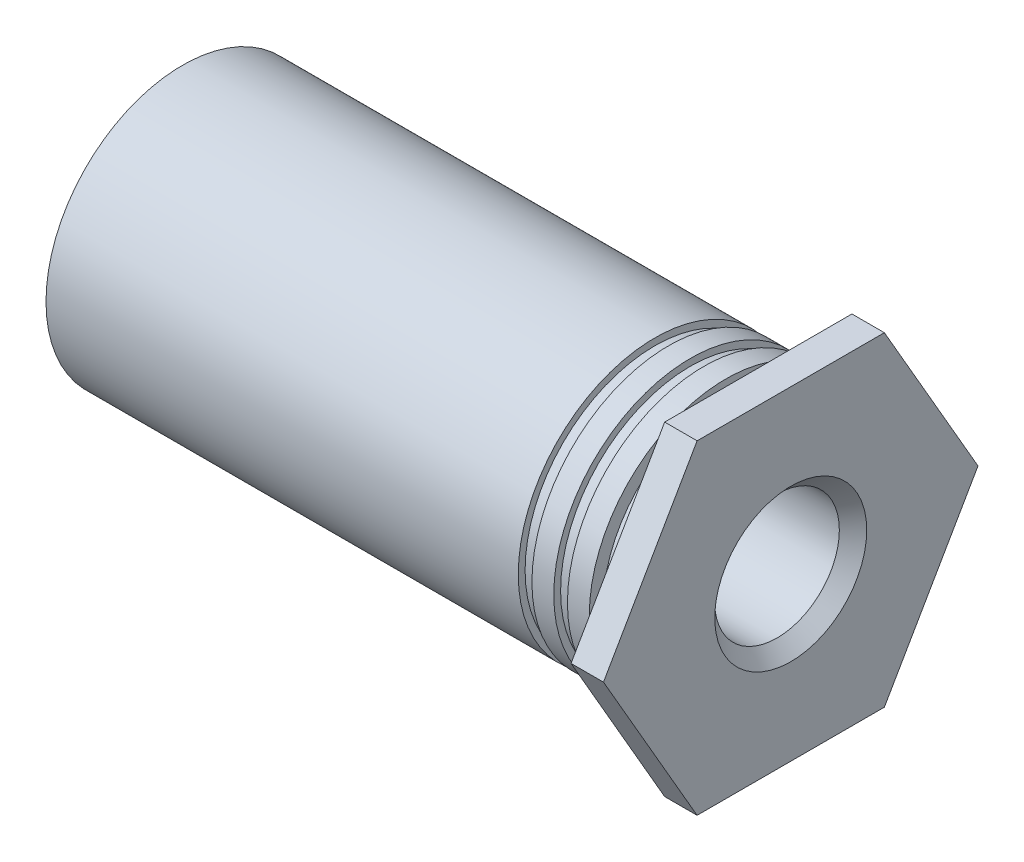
ISO-10303-21;
HEADER;
FILE_DESCRIPTION(('STEP AP214'),'2;1');
FILE_NAME('part.step','',(''),(''),'','','');
FILE_SCHEMA(('AUTOMOTIVE_DESIGN { 1 0 10303 214 1 1 1 1 }'));
ENDSEC;
DATA;
#1=APPLICATION_CONTEXT('core data for automotive mechanical design processes');
#2=APPLICATION_PROTOCOL_DEFINITION('international standard','automotive_design',2000,#1);
#3=PRODUCT_CONTEXT('',#1,'mechanical');
#4=PRODUCT('Part','Part','',(#3));
#5=PRODUCT_RELATED_PRODUCT_CATEGORY('part','',(#4));
#6=PRODUCT_DEFINITION_FORMATION('','',#4);
#7=PRODUCT_DEFINITION_CONTEXT('part definition',#1,'design');
#8=PRODUCT_DEFINITION('design','',#6,#7);
#9=PRODUCT_DEFINITION_SHAPE('','',#8);
#10=(LENGTH_UNIT() NAMED_UNIT(*) SI_UNIT(.MILLI.,.METRE.));
#11=(NAMED_UNIT(*) PLANE_ANGLE_UNIT() SI_UNIT($,.RADIAN.));
#12=(NAMED_UNIT(*) SI_UNIT($,.STERADIAN.) SOLID_ANGLE_UNIT());
#13=UNCERTAINTY_MEASURE_WITH_UNIT(LENGTH_MEASURE(1.E-05),#10,'distance_accuracy_value','');
#14=(GEOMETRIC_REPRESENTATION_CONTEXT(3) GLOBAL_UNCERTAINTY_ASSIGNED_CONTEXT((#13)) GLOBAL_UNIT_ASSIGNED_CONTEXT((#10,
#11,#12)) REPRESENTATION_CONTEXT('',''));
#15=CARTESIAN_POINT('',(0.,0.,0.));
#16=DIRECTION('',(0.,0.,1.));
#17=DIRECTION('',(1.,0.,0.));
#18=AXIS2_PLACEMENT_3D('',#15,#16,#17);
#19=CARTESIAN_POINT('',(-0.64,0.,1.34750000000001));
#20=DIRECTION('',(1.,0.,0.));
#21=DIRECTION('',(0.,0.,-1.));
#22=AXIS2_PLACEMENT_3D('',#19,#20,#21);
#23=PLANE('',#22);
#24=CARTESIAN_POINT('',(-0.640000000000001,0.,0.));
#25=DIRECTION('',(1.,0.,0.));
#26=DIRECTION('',(0.,0.,-1.));
#27=AXIS2_PLACEMENT_3D('',#24,#25,#26);
#28=CIRCLE('',#27,2.695);
#29=CARTESIAN_POINT('',(-0.64,0.,-2.69499999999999));
#30=VERTEX_POINT('',#29);
#31=EDGE_CURVE('E818',#30,#30,#28,.F.);
#32=ORIENTED_EDGE('',*,*,#31,.F.);
#33=EDGE_LOOP('',(#32));
#34=FACE_BOUND('',#33,.T.);
#35=CARTESIAN_POINT('',(-0.64,0.,0.));
#36=DIRECTION('',(1.,0.,0.));
#37=DIRECTION('',(0.,0.,-1.));
#38=AXIS2_PLACEMENT_3D('',#35,#36,#37);
#39=CIRCLE('',#38,2.4255);
#40=CARTESIAN_POINT('',(-0.64,0.,-2.42549999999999));
#41=VERTEX_POINT('',#40);
#42=EDGE_CURVE('E814',#41,#41,#39,.T.);
#43=ORIENTED_EDGE('',*,*,#42,.F.);
#44=EDGE_LOOP('',(#43));
#45=FACE_BOUND('',#44,.T.);
#46=ADVANCED_FACE('F18',(#34,#45),#23,.T.);
#47=CARTESIAN_POINT('',(-6.,0.,0.));
#48=DIRECTION('',(1.,0.,0.));
#49=DIRECTION('',(0.,0.,-1.));
#50=AXIS2_PLACEMENT_3D('',#47,#48,#49);
#51=CYLINDRICAL_SURFACE('',#50,2.695);
#52=CARTESIAN_POINT('',(-1.0712,0.,0.));
#53=DIRECTION('',(1.,0.,0.));
#54=DIRECTION('',(0.,0.,-1.));
#55=AXIS2_PLACEMENT_3D('',#52,#53,#54);
#56=CIRCLE('',#55,2.695);
#57=CARTESIAN_POINT('',(-1.0712,0.,-2.695));
#58=VERTEX_POINT('',#57);
#59=EDGE_CURVE('E810',#58,#58,#56,.T.);
#60=ORIENTED_EDGE('',*,*,#59,.T.);
#61=EDGE_LOOP('',(#60));
#62=FACE_BOUND('',#61,.T.);
#63=ORIENTED_EDGE('',*,*,#31,.T.);
#64=EDGE_LOOP('',(#63));
#65=FACE_BOUND('',#64,.T.);
#66=ADVANCED_FACE('F2754',(#62,#65),#51,.T.);
#67=CARTESIAN_POINT('',(-0.32,0.,0.));
#68=DIRECTION('',(1.,0.,0.));
#69=DIRECTION('',(0.,0.,-1.));
#70=AXIS2_PLACEMENT_3D('',#67,#68,#69);
#71=CYLINDRICAL_SURFACE('',#70,2.4255);
#72=ORIENTED_EDGE('',*,*,#42,.T.);
#73=EDGE_LOOP('',(#72));
#74=FACE_BOUND('',#73,.T.);
#75=CARTESIAN_POINT('',(0.,0.,0.));
#76=DIRECTION('',(1.,0.,0.));
#77=DIRECTION('',(0.,0.,-1.));
#78=AXIS2_PLACEMENT_3D('',#75,#76,#77);
#79=CIRCLE('',#78,2.4255);
#80=CARTESIAN_POINT('',(0.,0.,-2.4255));
#81=VERTEX_POINT('',#80);
#82=EDGE_CURVE('E806',#81,#81,#79,.F.);
#83=ORIENTED_EDGE('',*,*,#82,.T.);
#84=EDGE_LOOP('',(#83));
#85=FACE_BOUND('',#84,.T.);
#86=ADVANCED_FACE('F2745',(#74,#85),#71,.T.);
#87=CARTESIAN_POINT('',(-1.0712,0.,2.627625));
#88=DIRECTION('',(1.,0.,0.));
#89=DIRECTION('',(0.,0.,-1.));
#90=AXIS2_PLACEMENT_3D('',#87,#88,#89);
#91=PLANE('',#90);
#92=ORIENTED_EDGE('',*,*,#59,.F.);
#93=EDGE_LOOP('',(#92));
#94=FACE_BOUND('',#93,.T.);
#95=CARTESIAN_POINT('',(-1.0712,0.,0.));
#96=DIRECTION('',(1.,0.,0.));
#97=DIRECTION('',(0.,0.,-1.));
#98=AXIS2_PLACEMENT_3D('',#95,#96,#97);
#99=CIRCLE('',#98,2.56025);
#100=CARTESIAN_POINT('',(-1.0712,0.,-2.56025));
#101=VERTEX_POINT('',#100);
#102=EDGE_CURVE('E775',#101,#101,#99,.F.);
#103=ORIENTED_EDGE('',*,*,#102,.F.);
#104=EDGE_LOOP('',(#103));
#105=FACE_BOUND('',#104,.T.);
#106=ADVANCED_FACE('F2736',(#94,#105),#91,.F.);
#107=CARTESIAN_POINT('',(0.,0.,0.));
#108=DIRECTION('',(1.,0.,0.));
#109=DIRECTION('',(0.,1.,0.));
#110=AXIS2_PLACEMENT_3D('',#107,#108,#109);
#111=PLANE('',#110);
#112=ORIENTED_EDGE('',*,*,#82,.F.);
#113=EDGE_LOOP('',(#112));
#114=FACE_BOUND('',#113,.T.);
#115=DIRECTION('',(0.,0.,1.));
#116=VECTOR('',#115,1.);
#117=CARTESIAN_POINT('',(0.,3.2,0.));
#118=LINE('',#117,#116);
#119=CARTESIAN_POINT('',(0.,3.2,-1.84752086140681));
#120=VERTEX_POINT('',#119);
#121=CARTESIAN_POINT('',(0.,3.2,1.8475208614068));
#122=VERTEX_POINT('',#121);
#123=EDGE_CURVE('E773',#120,#122,#118,.T.);
#124=ORIENTED_EDGE('',*,*,#123,.F.);
#125=DIRECTION('',(0.,0.866025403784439,0.5));
#126=VECTOR('',#125,1.);
#127=CARTESIAN_POINT('',(0.,1.6,-2.77128129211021));
#128=LINE('',#127,#126);
#129=CARTESIAN_POINT('',(0.,0.,-3.69504172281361));
#130=VERTEX_POINT('',#129);
#131=EDGE_CURVE('E739',#130,#120,#128,.T.);
#132=ORIENTED_EDGE('',*,*,#131,.F.);
#133=DIRECTION('',(0.,0.866025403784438,-0.5));
#134=VECTOR('',#133,1.);
#135=CARTESIAN_POINT('',(0.,-1.6,-2.77128129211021));
#136=LINE('',#135,#134);
#137=CARTESIAN_POINT('',(0.,-3.2,-1.8475208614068));
#138=VERTEX_POINT('',#137);
#139=EDGE_CURVE('E745',#138,#130,#136,.T.);
#140=ORIENTED_EDGE('',*,*,#139,.F.);
#141=DIRECTION('',(0.,0.,-1.));
#142=VECTOR('',#141,1.);
#143=CARTESIAN_POINT('',(0.,-3.2,0.));
#144=LINE('',#143,#142);
#145=CARTESIAN_POINT('',(0.,-3.2,1.8475208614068));
#146=VERTEX_POINT('',#145);
#147=EDGE_CURVE('E752',#146,#138,#144,.T.);
#148=ORIENTED_EDGE('',*,*,#147,.F.);
#149=DIRECTION('',(0.,-0.866025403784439,-0.5));
#150=VECTOR('',#149,1.);
#151=CARTESIAN_POINT('',(0.,-1.6,2.7712812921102));
#152=LINE('',#151,#150);
#153=CARTESIAN_POINT('',(0.,0.,3.6950417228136));
#154=VERTEX_POINT('',#153);
#155=EDGE_CURVE('E759',#154,#146,#152,.T.);
#156=ORIENTED_EDGE('',*,*,#155,.F.);
#157=DIRECTION('',(0.,-0.866025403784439,0.5));
#158=VECTOR('',#157,1.);
#159=CARTESIAN_POINT('',(0.,1.6,2.7712812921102));
#160=LINE('',#159,#158);
#161=EDGE_CURVE('E766',#122,#154,#160,.T.);
#162=ORIENTED_EDGE('',*,*,#161,.F.);
#163=EDGE_LOOP('',(#124,#132,#140,#148,#156,#162));
#164=FACE_BOUND('',#163,.T.);
#165=ADVANCED_FACE('F2727',(#114,#164),#111,.F.);
#166=CARTESIAN_POINT('',(-1.20595,0.,0.));
#167=DIRECTION('',(1.,0.,0.));
#168=DIRECTION('',(0.,0.,-1.));
#169=AXIS2_PLACEMENT_3D('',#166,#167,#168);
#170=CYLINDRICAL_SURFACE('',#169,2.56025);
#171=CARTESIAN_POINT('',(-1.3407,0.,0.));
#172=DIRECTION('',(1.,0.,0.));
#173=DIRECTION('',(0.,0.,-1.));
#174=AXIS2_PLACEMENT_3D('',#171,#172,#173);
#175=CIRCLE('',#174,2.56025);
#176=CARTESIAN_POINT('',(-1.3407,0.,-2.56025));
#177=VERTEX_POINT('',#176);
#178=EDGE_CURVE('E734',#177,#177,#175,.T.);
#179=ORIENTED_EDGE('',*,*,#178,.T.);
#180=EDGE_LOOP('',(#179));
#181=FACE_BOUND('',#180,.T.);
#182=ORIENTED_EDGE('',*,*,#102,.T.);
#183=EDGE_LOOP('',(#182));
#184=FACE_BOUND('',#183,.T.);
#185=ADVANCED_FACE('F2718',(#181,#184),#170,.T.);
#186=CARTESIAN_POINT('',(0.,3.2,0.));
#187=DIRECTION('',(0.,1.,0.));
#188=DIRECTION('',(0.,0.,1.));
#189=AXIS2_PLACEMENT_3D('',#186,#187,#188);
#190=PLANE('',#189);
#191=ORIENTED_EDGE('',*,*,#123,.T.);
#192=DIRECTION('',(1.,0.,0.));
#193=VECTOR('',#192,1.);
#194=CARTESIAN_POINT('',(0.,3.2,1.8475208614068));
#195=LINE('',#194,#193);
#196=CARTESIAN_POINT('',(0.64,3.2,1.8475208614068));
#197=VERTEX_POINT('',#196);
#198=EDGE_CURVE('E769',#197,#122,#195,.F.);
#199=ORIENTED_EDGE('',*,*,#198,.F.);
#200=DIRECTION('',(0.,0.,1.));
#201=VECTOR('',#200,1.);
#202=CARTESIAN_POINT('',(0.64,3.2,0.));
#203=LINE('',#202,#201);
#204=CARTESIAN_POINT('',(0.64,3.2,-1.84752086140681));
#205=VERTEX_POINT('',#204);
#206=EDGE_CURVE('E730',#205,#197,#203,.T.);
#207=ORIENTED_EDGE('',*,*,#206,.F.);
#208=DIRECTION('',(1.,0.,0.));
#209=VECTOR('',#208,1.);
#210=CARTESIAN_POINT('',(0.,3.2,-1.84752086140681));
#211=LINE('',#210,#209);
#212=EDGE_CURVE('E735',#120,#205,#211,.T.);
#213=ORIENTED_EDGE('',*,*,#212,.F.);
#214=EDGE_LOOP('',(#191,#199,#207,#213));
#215=FACE_BOUND('',#214,.T.);
#216=ADVANCED_FACE('F2709',(#215),#190,.T.);
#217=CARTESIAN_POINT('',(0.,1.6,2.7712812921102));
#218=DIRECTION('',(0.,0.5,0.866025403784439));
#219=DIRECTION('',(0.,-0.866025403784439,0.5));
#220=AXIS2_PLACEMENT_3D('',#217,#218,#219);
#221=PLANE('',#220);
#222=ORIENTED_EDGE('',*,*,#161,.T.);
#223=DIRECTION('',(1.,0.,0.));
#224=VECTOR('',#223,1.);
#225=CARTESIAN_POINT('',(0.,0.,3.6950417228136));
#226=LINE('',#225,#224);
#227=CARTESIAN_POINT('',(0.64,0.,3.6950417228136));
#228=VERTEX_POINT('',#227);
#229=EDGE_CURVE('E762',#228,#154,#226,.F.);
#230=ORIENTED_EDGE('',*,*,#229,.F.);
#231=DIRECTION('',(0.,-0.866025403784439,0.5));
#232=VECTOR('',#231,1.);
#233=CARTESIAN_POINT('',(0.64,3.2,1.8475208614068));
#234=LINE('',#233,#232);
#235=EDGE_CURVE('E726',#197,#228,#234,.T.);
#236=ORIENTED_EDGE('',*,*,#235,.F.);
#237=ORIENTED_EDGE('',*,*,#198,.T.);
#238=EDGE_LOOP('',(#222,#230,#236,#237));
#239=FACE_BOUND('',#238,.T.);
#240=ADVANCED_FACE('F2700',(#239),#221,.T.);
#241=CARTESIAN_POINT('',(0.,-1.6,2.7712812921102));
#242=DIRECTION('',(0.,-0.5,0.866025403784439));
#243=DIRECTION('',(0.,-0.866025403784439,-0.5));
#244=AXIS2_PLACEMENT_3D('',#241,#242,#243);
#245=PLANE('',#244);
#246=ORIENTED_EDGE('',*,*,#155,.T.);
#247=DIRECTION('',(1.,0.,0.));
#248=VECTOR('',#247,1.);
#249=CARTESIAN_POINT('',(0.,-3.2,1.8475208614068));
#250=LINE('',#249,#248);
#251=CARTESIAN_POINT('',(0.64,-3.2,1.8475208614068));
#252=VERTEX_POINT('',#251);
#253=EDGE_CURVE('E755',#252,#146,#250,.F.);
#254=ORIENTED_EDGE('',*,*,#253,.F.);
#255=DIRECTION('',(0.,-0.866025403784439,-0.5));
#256=VECTOR('',#255,1.);
#257=CARTESIAN_POINT('',(0.64,0.,3.6950417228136));
#258=LINE('',#257,#256);
#259=EDGE_CURVE('E722',#228,#252,#258,.T.);
#260=ORIENTED_EDGE('',*,*,#259,.F.);
#261=ORIENTED_EDGE('',*,*,#229,.T.);
#262=EDGE_LOOP('',(#246,#254,#260,#261));
#263=FACE_BOUND('',#262,.T.);
#264=ADVANCED_FACE('F2691',(#263),#245,.T.);
#265=CARTESIAN_POINT('',(0.,-3.2,0.));
#266=DIRECTION('',(0.,-1.,0.));
#267=DIRECTION('',(0.,0.,-1.));
#268=AXIS2_PLACEMENT_3D('',#265,#266,#267);
#269=PLANE('',#268);
#270=ORIENTED_EDGE('',*,*,#147,.T.);
#271=DIRECTION('',(1.,0.,0.));
#272=VECTOR('',#271,1.);
#273=CARTESIAN_POINT('',(0.,-3.20000000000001,-1.84752086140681));
#274=LINE('',#273,#272);
#275=CARTESIAN_POINT('',(0.64,-3.2,-1.8475208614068));
#276=VERTEX_POINT('',#275);
#277=EDGE_CURVE('E748',#276,#138,#274,.F.);
#278=ORIENTED_EDGE('',*,*,#277,.F.);
#279=DIRECTION('',(0.,0.,1.));
#280=VECTOR('',#279,1.);
#281=CARTESIAN_POINT('',(0.64,-3.2,0.));
#282=LINE('',#281,#280);
#283=EDGE_CURVE('E718',#252,#276,#282,.F.);
#284=ORIENTED_EDGE('',*,*,#283,.F.);
#285=ORIENTED_EDGE('',*,*,#253,.T.);
#286=EDGE_LOOP('',(#270,#278,#284,#285));
#287=FACE_BOUND('',#286,.T.);
#288=ADVANCED_FACE('F2683',(#287),#269,.T.);
#289=CARTESIAN_POINT('',(0.,-1.6,-2.77128129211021));
#290=DIRECTION('',(0.,-0.5,-0.866025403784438));
#291=DIRECTION('',(0.,0.866025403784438,-0.5));
#292=AXIS2_PLACEMENT_3D('',#289,#290,#291);
#293=PLANE('',#292);
#294=ORIENTED_EDGE('',*,*,#139,.T.);
#295=DIRECTION('',(1.,0.,0.));
#296=VECTOR('',#295,1.);
#297=CARTESIAN_POINT('',(0.,0.,-3.69504172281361));
#298=LINE('',#297,#296);
#299=CARTESIAN_POINT('',(0.64,0.,-3.69504172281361));
#300=VERTEX_POINT('',#299);
#301=EDGE_CURVE('E39',#300,#130,#298,.F.);
#302=ORIENTED_EDGE('',*,*,#301,.F.);
#303=DIRECTION('',(0.,0.866025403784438,-0.500000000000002));
#304=VECTOR('',#303,1.);
#305=CARTESIAN_POINT('',(0.64,-3.2,-1.8475208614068));
#306=LINE('',#305,#304);
#307=EDGE_CURVE('E714',#276,#300,#306,.T.);
#308=ORIENTED_EDGE('',*,*,#307,.F.);
#309=ORIENTED_EDGE('',*,*,#277,.T.);
#310=EDGE_LOOP('',(#294,#302,#308,#309));
#311=FACE_BOUND('',#310,.T.);
#312=ADVANCED_FACE('F2674',(#311),#293,.T.);
#313=CARTESIAN_POINT('',(0.,1.6,-2.77128129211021));
#314=DIRECTION('',(0.,0.5,-0.866025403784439));
#315=DIRECTION('',(0.,0.866025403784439,0.5));
#316=AXIS2_PLACEMENT_3D('',#313,#314,#315);
#317=PLANE('',#316);
#318=ORIENTED_EDGE('',*,*,#131,.T.);
#319=ORIENTED_EDGE('',*,*,#212,.T.);
#320=DIRECTION('',(0.,0.866025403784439,0.499999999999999));
#321=VECTOR('',#320,1.);
#322=CARTESIAN_POINT('',(0.64,0.,-3.69504172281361));
#323=LINE('',#322,#321);
#324=EDGE_CURVE('E709',#300,#205,#323,.T.);
#325=ORIENTED_EDGE('',*,*,#324,.F.);
#326=ORIENTED_EDGE('',*,*,#301,.T.);
#327=EDGE_LOOP('',(#318,#319,#325,#326));
#328=FACE_BOUND('',#327,.T.);
#329=ADVANCED_FACE('F2665',(#328),#317,.T.);
#330=CARTESIAN_POINT('',(-1.3407,0.,2.627625));
#331=DIRECTION('',(-1.,0.,0.));
#332=DIRECTION('',(0.,0.,1.));
#333=AXIS2_PLACEMENT_3D('',#330,#331,#332);
#334=PLANE('',#333);
#335=ORIENTED_EDGE('',*,*,#178,.F.);
#336=EDGE_LOOP('',(#335));
#337=FACE_BOUND('',#336,.T.);
#338=CARTESIAN_POINT('',(-1.3407,0.,0.));
#339=DIRECTION('',(1.,0.,0.));
#340=DIRECTION('',(0.,0.,-1.));
#341=AXIS2_PLACEMENT_3D('',#338,#339,#340);
#342=CIRCLE('',#341,2.695);
#343=CARTESIAN_POINT('',(-1.3407,0.,-2.695));
#344=VERTEX_POINT('',#343);
#345=EDGE_CURVE('E713',#344,#344,#342,.F.);
#346=ORIENTED_EDGE('',*,*,#345,.F.);
#347=EDGE_LOOP('',(#346));
#348=FACE_BOUND('',#347,.T.);
#349=ADVANCED_FACE('F2656',(#337,#348),#334,.F.);
#350=CARTESIAN_POINT('',(0.64,0.,0.));
#351=DIRECTION('',(1.,0.,0.));
#352=DIRECTION('',(0.,1.,0.));
#353=AXIS2_PLACEMENT_3D('',#350,#351,#352);
#354=PLANE('',#353);
#355=ORIENTED_EDGE('',*,*,#307,.T.);
#356=ORIENTED_EDGE('',*,*,#324,.T.);
#357=ORIENTED_EDGE('',*,*,#206,.T.);
#358=ORIENTED_EDGE('',*,*,#235,.T.);
#359=ORIENTED_EDGE('',*,*,#259,.T.);
#360=ORIENTED_EDGE('',*,*,#283,.T.);
#361=EDGE_LOOP('',(#355,#356,#357,#358,#359,#360));
#362=FACE_BOUND('',#361,.T.);
#363=CARTESIAN_POINT('',(0.639999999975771,0.,0.));
#364=DIRECTION('',(1.,0.,0.));
#365=DIRECTION('',(0.,0.,-1.));
#366=AXIS2_PLACEMENT_3D('',#363,#364,#365);
#367=CIRCLE('',#366,1.50000000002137);
#368=CARTESIAN_POINT('',(0.639999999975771,0.,-1.50000000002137));
#369=VERTEX_POINT('',#368);
#370=EDGE_CURVE('E793',#369,#369,#367,.F.);
#371=ORIENTED_EDGE('',*,*,#370,.T.);
#372=EDGE_LOOP('',(#371));
#373=FACE_BOUND('',#372,.T.);
#374=ADVANCED_FACE('F2647',(#362,#373),#354,.T.);
#375=CARTESIAN_POINT('',(-6.,0.,0.));
#376=DIRECTION('',(1.,0.,0.));
#377=DIRECTION('',(0.,0.,-1.));
#378=AXIS2_PLACEMENT_3D('',#375,#376,#377);
#379=CYLINDRICAL_SURFACE('',#378,2.695);
#380=CARTESIAN_POINT('',(-1.7719,0.,0.));
#381=DIRECTION('',(1.,0.,0.));
#382=DIRECTION('',(0.,0.,-1.));
#383=AXIS2_PLACEMENT_3D('',#380,#381,#382);
#384=CIRCLE('',#383,2.695);
#385=CARTESIAN_POINT('',(-1.7719,0.,-2.69499999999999));
#386=VERTEX_POINT('',#385);
#387=EDGE_CURVE('E708',#386,#386,#384,.T.);
#388=ORIENTED_EDGE('',*,*,#387,.T.);
#389=EDGE_LOOP('',(#388));
#390=FACE_BOUND('',#389,.T.);
#391=ORIENTED_EDGE('',*,*,#345,.T.);
#392=EDGE_LOOP('',(#391));
#393=FACE_BOUND('',#392,.T.);
#394=ADVANCED_FACE('F2638',(#390,#393),#379,.T.);
#395=CARTESIAN_POINT('',(0.640000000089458,0.,0.));
#396=DIRECTION('',(1.,0.,0.));
#397=DIRECTION('',(0.,0.,-1.));
#398=AXIS2_PLACEMENT_3D('',#395,#396,#397);
#399=CONICAL_SURFACE('',#398,1.50000000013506,0.785398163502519);
#400=ORIENTED_EDGE('',*,*,#370,.F.);
#401=EDGE_LOOP('',(#400));
#402=FACE_BOUND('',#401,.T.);
#403=CARTESIAN_POINT('',(0.369499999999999,0.,0.));
#404=DIRECTION('',(-1.,0.,0.));
#405=DIRECTION('',(0.,0.,1.));
#406=AXIS2_PLACEMENT_3D('',#403,#404,#405);
#407=CIRCLE('',#406,1.2295);
#408=CARTESIAN_POINT('',(0.369499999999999,0.,1.22950000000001));
#409=VERTEX_POINT('',#408);
#410=EDGE_CURVE('E704',#409,#409,#407,.T.);
#411=ORIENTED_EDGE('',*,*,#410,.T.);
#412=EDGE_LOOP('',(#411));
#413=FACE_BOUND('',#412,.T.);
#414=ADVANCED_FACE('F2629',(#402,#413),#399,.F.);
#415=CARTESIAN_POINT('',(-1.7719,0.,2.627625));
#416=DIRECTION('',(1.,0.,0.));
#417=DIRECTION('',(0.,0.,-1.));
#418=AXIS2_PLACEMENT_3D('',#415,#416,#417);
#419=PLANE('',#418);
#420=ORIENTED_EDGE('',*,*,#387,.F.);
#421=EDGE_LOOP('',(#420));
#422=FACE_BOUND('',#421,.T.);
#423=CARTESIAN_POINT('',(-1.7719,0.,0.));
#424=DIRECTION('',(1.,0.,0.));
#425=DIRECTION('',(0.,0.,-1.));
#426=AXIS2_PLACEMENT_3D('',#423,#424,#425);
#427=CIRCLE('',#426,2.56025);
#428=CARTESIAN_POINT('',(-1.7719,0.,-2.56024999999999));
#429=VERTEX_POINT('',#428);
#430=EDGE_CURVE('E703',#429,#429,#427,.F.);
#431=ORIENTED_EDGE('',*,*,#430,.F.);
#432=EDGE_LOOP('',(#431));
#433=FACE_BOUND('',#432,.T.);
#434=ADVANCED_FACE('F2620',(#422,#433),#419,.F.);
#435=CARTESIAN_POINT('',(-5.36,0.,0.));
#436=DIRECTION('',(-1.,0.,0.));
#437=DIRECTION('',(0.,0.,1.));
#438=AXIS2_PLACEMENT_3D('',#435,#436,#437);
#439=CYLINDRICAL_SURFACE('',#438,1.2295);
#440=ORIENTED_EDGE('',*,*,#410,.F.);
#441=EDGE_LOOP('',(#440));
#442=FACE_BOUND('',#441,.T.);
#443=CARTESIAN_POINT('',(-11.0895000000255,0.,0.));
#444=DIRECTION('',(-1.,0.,0.));
#445=DIRECTION('',(0.,0.,-1.));
#446=AXIS2_PLACEMENT_3D('',#443,#444,#445);
#447=CIRCLE('',#446,1.22949999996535);
#448=CARTESIAN_POINT('',(-11.0895000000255,0.,-1.22949999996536));
#449=VERTEX_POINT('',#448);
#450=EDGE_CURVE('E693',#449,#449,#447,.T.);
#451=ORIENTED_EDGE('',*,*,#450,.T.);
#452=EDGE_LOOP('',(#451));
#453=FACE_BOUND('',#452,.T.);
#454=ADVANCED_FACE('F2611',(#442,#453),#439,.F.);
#455=CARTESIAN_POINT('',(-1.90665,0.,0.));
#456=DIRECTION('',(1.,0.,0.));
#457=DIRECTION('',(0.,0.,-1.));
#458=AXIS2_PLACEMENT_3D('',#455,#456,#457);
#459=CYLINDRICAL_SURFACE('',#458,2.56025);
#460=CARTESIAN_POINT('',(-2.0414,0.,0.));
#461=DIRECTION('',(1.,0.,0.));
#462=DIRECTION('',(0.,0.,-1.));
#463=AXIS2_PLACEMENT_3D('',#460,#461,#462);
#464=CIRCLE('',#463,2.56025);
#465=CARTESIAN_POINT('',(-2.0414,0.,-2.56025));
#466=VERTEX_POINT('',#465);
#467=EDGE_CURVE('E702',#466,#466,#464,.T.);
#468=ORIENTED_EDGE('',*,*,#467,.T.);
#469=EDGE_LOOP('',(#468));
#470=FACE_BOUND('',#469,.T.);
#471=ORIENTED_EDGE('',*,*,#430,.T.);
#472=EDGE_LOOP('',(#471));
#473=FACE_BOUND('',#472,.T.);
#474=ADVANCED_FACE('F2602',(#470,#473),#459,.T.);
#475=CARTESIAN_POINT('',(-11.3599999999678,0.,0.));
#476=DIRECTION('',(-1.,0.,0.));
#477=DIRECTION('',(0.,0.,1.));
#478=AXIS2_PLACEMENT_3D('',#475,#476,#477);
#479=CONICAL_SURFACE('',#478,1.49999999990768,0.785398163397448);
#480=ORIENTED_EDGE('',*,*,#450,.F.);
#481=EDGE_LOOP('',(#480));
#482=FACE_BOUND('',#481,.T.);
#483=CARTESIAN_POINT('',(-11.3600000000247,0.,0.));
#484=DIRECTION('',(-1.,0.,0.));
#485=DIRECTION('',(0.,0.,1.));
#486=AXIS2_PLACEMENT_3D('',#483,#484,#485);
#487=CIRCLE('',#486,1.49999999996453);
#488=CARTESIAN_POINT('',(-11.3600000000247,0.,1.49999999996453));
#489=VERTEX_POINT('',#488);
#490=EDGE_CURVE('E780',#489,#489,#487,.F.);
#491=ORIENTED_EDGE('',*,*,#490,.F.);
#492=EDGE_LOOP('',(#491));
#493=FACE_BOUND('',#492,.T.);
#494=ADVANCED_FACE('F2593',(#482,#493),#479,.F.);
#495=CARTESIAN_POINT('',(-2.0414,0.,2.627625));
#496=DIRECTION('',(-1.,0.,0.));
#497=DIRECTION('',(0.,0.,1.));
#498=AXIS2_PLACEMENT_3D('',#495,#496,#497);
#499=PLANE('',#498);
#500=ORIENTED_EDGE('',*,*,#467,.F.);
#501=EDGE_LOOP('',(#500));
#502=FACE_BOUND('',#501,.T.);
#503=CARTESIAN_POINT('',(-2.0414,0.,0.));
#504=DIRECTION('',(1.,0.,0.));
#505=DIRECTION('',(0.,0.,-1.));
#506=AXIS2_PLACEMENT_3D('',#503,#504,#505);
#507=CIRCLE('',#506,2.695);
#508=CARTESIAN_POINT('',(-2.0414,0.,-2.695));
#509=VERTEX_POINT('',#508);
#510=EDGE_CURVE('E30',#509,#509,#507,.F.);
#511=ORIENTED_EDGE('',*,*,#510,.F.);
#512=EDGE_LOOP('',(#511));
#513=FACE_BOUND('',#512,.T.);
#514=ADVANCED_FACE('F2585',(#502,#513),#499,.F.);
#515=CARTESIAN_POINT('',(-11.36,0.,1.3475));
#516=DIRECTION('',(-1.,0.,0.));
#517=DIRECTION('',(0.,0.,1.));
#518=AXIS2_PLACEMENT_3D('',#515,#516,#517);
#519=PLANE('',#518);
#520=CARTESIAN_POINT('',(-11.36,0.,0.));
#521=DIRECTION('',(1.,0.,0.));
#522=DIRECTION('',(0.,0.,-1.));
#523=AXIS2_PLACEMENT_3D('',#520,#521,#522);
#524=CIRCLE('',#523,2.695);
#525=CARTESIAN_POINT('',(-11.36,0.,-2.695));
#526=VERTEX_POINT('',#525);
#527=EDGE_CURVE('E11',#526,#526,#524,.T.);
#528=ORIENTED_EDGE('',*,*,#527,.F.);
#529=EDGE_LOOP('',(#528));
#530=FACE_BOUND('',#529,.T.);
#531=ORIENTED_EDGE('',*,*,#490,.T.);
#532=EDGE_LOOP('',(#531));
#533=FACE_BOUND('',#532,.T.);
#534=ADVANCED_FACE('F2577',(#530,#533),#519,.T.);
#535=CARTESIAN_POINT('',(-6.,0.,0.));
#536=DIRECTION('',(1.,0.,0.));
#537=DIRECTION('',(0.,0.,-1.));
#538=AXIS2_PLACEMENT_3D('',#535,#536,#537);
#539=CYLINDRICAL_SURFACE('',#538,2.695);
#540=ORIENTED_EDGE('',*,*,#510,.T.);
#541=EDGE_LOOP('',(#540));
#542=FACE_BOUND('',#541,.T.);
#543=ORIENTED_EDGE('',*,*,#527,.T.);
#544=EDGE_LOOP('',(#543));
#545=FACE_BOUND('',#544,.T.);
#546=ADVANCED_FACE('F627',(#542,#545),#539,.T.);
#547=CLOSED_SHELL('',(#46,#66,#86,#106,#165,#185,#216,#240,#264,#288,#312,#329,#349,#374,#394,
#414,#434,#454,#474,#494,#514,#534,#546));
#548=CARTESIAN_POINT('',(0.341422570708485,0.669978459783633,2.96692235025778));
#549=DIRECTION('',(1.,0.,0.));
#550=DIRECTION('',(0.,0.,-1.));
#551=AXIS2_PLACEMENT_3D('',#548,#549,#550);
#552=PLANE('',#551);
#553=CARTESIAN_POINT('',(0.341422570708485,0.647626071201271,2.99819817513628));
#554=CARTESIAN_POINT('',(0.341422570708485,0.646955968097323,2.99806161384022));
#555=CARTESIAN_POINT('',(0.341422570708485,0.646285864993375,2.99792505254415));
#556=B_SPLINE_CURVE_WITH_KNOTS('',2,(#553,#554,#555),.UNSPECIFIED.,.F.,.F.,(3,3),(0.,1.),.UNSPECIFIED.);
#557=CARTESIAN_POINT('',(0.341422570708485,0.646285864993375,2.99792505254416));
#558=VERTEX_POINT('',#557);
#559=CARTESIAN_POINT('',(0.341422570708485,0.647626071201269,2.99819817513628));
#560=VERTEX_POINT('',#559);
#561=EDGE_CURVE('E632',#558,#560,#556,.F.);
#562=ORIENTED_EDGE('',*,*,#561,.T.);
#563=DIRECTION('',(0.,-0.993166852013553,-0.116703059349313));
#564=VECTOR('',#563,1.);
#565=CARTESIAN_POINT('',(0.341422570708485,0.655572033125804,2.99913187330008));
#566=LINE('',#565,#564);
#567=CARTESIAN_POINT('',(0.341422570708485,0.66351799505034,3.00006557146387));
#568=VERTEX_POINT('',#567);
#569=EDGE_CURVE('E1886',#560,#568,#566,.F.);
#570=ORIENTED_EDGE('',*,*,#569,.T.);
#571=DIRECTION('',(0.,1.,0.));
#572=VECTOR('',#571,1.);
#573=CARTESIAN_POINT('',(0.341422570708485,0.670403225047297,3.00006557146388));
#574=LINE('',#573,#572);
#575=CARTESIAN_POINT('',(0.341422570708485,0.671991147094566,3.00006557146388));
#576=VERTEX_POINT('',#575);
#577=EDGE_CURVE('E406',#568,#576,#574,.T.);
#578=ORIENTED_EDGE('',*,*,#577,.T.);
#579=DIRECTION('',(0.,-0.991604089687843,0.129310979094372));
#580=VECTOR('',#579,1.);
#581=CARTESIAN_POINT('',(0.341422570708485,0.676764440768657,2.99944310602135));
#582=LINE('',#581,#580);
#583=CARTESIAN_POINT('',(0.341422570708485,0.681537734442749,2.99882064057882));
#584=VERTEX_POINT('',#583);
#585=EDGE_CURVE('E402',#576,#584,#582,.F.);
#586=ORIENTED_EDGE('',*,*,#585,.T.);
#587=DIRECTION('',(0.,-0.924845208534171,0.380343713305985));
#588=VECTOR('',#587,1.);
#589=CARTESIAN_POINT('',(0.341422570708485,0.684812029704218,2.99747408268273));
#590=LINE('',#589,#588);
#591=CARTESIAN_POINT('',(0.341422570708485,0.688086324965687,2.99612752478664));
#592=VERTEX_POINT('',#591);
#593=EDGE_CURVE('E389',#584,#592,#590,.F.);
#594=ORIENTED_EDGE('',*,*,#593,.T.);
#595=CARTESIAN_POINT('',(0.341422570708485,0.689185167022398,2.99540343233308));
#596=CARTESIAN_POINT('',(0.341422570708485,0.688635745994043,2.99576547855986));
#597=CARTESIAN_POINT('',(0.341422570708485,0.688086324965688,2.99612752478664));
#598=B_SPLINE_CURVE_WITH_KNOTS('',2,(#595,#596,#597),.UNSPECIFIED.,.F.,.F.,(3,3),(0.,1.),.UNSPECIFIED.);
#599=CARTESIAN_POINT('',(0.341422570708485,0.689187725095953,2.99540144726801));
#600=VERTEX_POINT('',#599);
#601=EDGE_CURVE('E430',#592,#600,#598,.F.);
#602=ORIENTED_EDGE('',*,*,#601,.T.);
#603=CARTESIAN_POINT('',(0.341422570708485,0.689979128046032,2.99478731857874));
#604=CARTESIAN_POINT('',(0.341422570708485,0.689582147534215,2.99509537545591));
#605=CARTESIAN_POINT('',(0.341422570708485,0.689185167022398,2.99540343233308));
#606=B_SPLINE_CURVE_WITH_KNOTS('',2,(#603,#604,#605),.UNSPECIFIED.,.F.,.F.,(3,3),(0.,1.),.UNSPECIFIED.);
#607=CARTESIAN_POINT('',(0.341422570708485,0.689979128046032,2.99478731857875));
#608=VERTEX_POINT('',#607);
#609=EDGE_CURVE('E434',#600,#608,#606,.F.);
#610=ORIENTED_EDGE('',*,*,#609,.T.);
#611=DIRECTION('',(0.,-0.482399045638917,0.875951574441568));
#612=VECTOR('',#611,1.);
#613=CARTESIAN_POINT('',(0.341422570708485,0.69242770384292,2.9903411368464));
#614=LINE('',#613,#612);
#615=CARTESIAN_POINT('',(0.341422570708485,0.694876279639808,2.98589495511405));
#616=VERTEX_POINT('',#615);
#617=EDGE_CURVE('E147',#608,#616,#614,.F.);
#618=ORIENTED_EDGE('',*,*,#617,.T.);
#619=DIRECTION('',(0.,0.,1.));
#620=VECTOR('',#619,1.);
#621=CARTESIAN_POINT('',(0.341422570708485,0.694876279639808,2.98181081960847));
#622=LINE('',#621,#620);
#623=CARTESIAN_POINT('',(0.341422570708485,0.694876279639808,2.98072468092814));
#624=VERTEX_POINT('',#623);
#625=EDGE_CURVE('E156',#616,#624,#622,.F.);
#626=ORIENTED_EDGE('',*,*,#625,.T.);
#627=DIRECTION('',(0.,0.460670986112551,0.887570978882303));
#628=VECTOR('',#627,1.);
#629=CARTESIAN_POINT('',(0.341422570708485,0.693186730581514,2.97746944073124));
#630=LINE('',#629,#628);
#631=CARTESIAN_POINT('',(0.341422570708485,0.691497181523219,2.97421420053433));
#632=VERTEX_POINT('',#631);
#633=EDGE_CURVE('E454',#624,#632,#630,.F.);
#634=ORIENTED_EDGE('',*,*,#633,.T.);
#635=DIRECTION('',(0.,0.827726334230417,0.561131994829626));
#636=VECTOR('',#635,1.);
#637=CARTESIAN_POINT('',(0.341422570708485,0.688016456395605,2.97185454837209));
#638=LINE('',#637,#636);
#639=CARTESIAN_POINT('',(0.341422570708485,0.684535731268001,2.96949489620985));
#640=VERTEX_POINT('',#639);
#641=EDGE_CURVE('E466',#632,#640,#638,.F.);
#642=ORIENTED_EDGE('',*,*,#641,.T.);
#643=DIRECTION('',(0.,-0.955558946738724,-0.294800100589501));
#644=VECTOR('',#643,1.);
#645=CARTESIAN_POINT('',(0.341422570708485,0.684535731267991,2.96949489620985));
#646=LINE('',#645,#644);
#647=CARTESIAN_POINT('',(0.341422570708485,0.682651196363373,2.96858917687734));
#648=VERTEX_POINT('',#647);
#649=EDGE_CURVE('E478',#640,#648,#646,.T.);
#650=ORIENTED_EDGE('',*,*,#649,.T.);
#651=CARTESIAN_POINT('',(0.341422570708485,0.682744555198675,2.96858025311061));
#652=CARTESIAN_POINT('',(0.341422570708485,0.683452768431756,2.96819597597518));
#653=CARTESIAN_POINT('',(0.341422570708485,0.684160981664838,2.96781169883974));
#654=B_SPLINE_CURVE_WITH_KNOTS('',2,(#651,#652,#653),.UNSPECIFIED.,.F.,.F.,(3,3),(0.,1.),.UNSPECIFIED.);
#655=CARTESIAN_POINT('',(0.341422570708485,0.684160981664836,2.96781169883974));
#656=VERTEX_POINT('',#655);
#657=EDGE_CURVE('E483',#648,#656,#654,.T.);
#658=ORIENTED_EDGE('',*,*,#657,.T.);
#659=DIRECTION('',(0.,-0.597049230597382,0.802204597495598));
#660=VECTOR('',#659,1.);
#661=CARTESIAN_POINT('',(0.341422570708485,0.688588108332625,2.96186334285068));
#662=LINE('',#661,#660);
#663=CARTESIAN_POINT('',(0.341422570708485,0.69301523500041,2.95591498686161));
#664=VERTEX_POINT('',#663);
#665=EDGE_CURVE('E514',#656,#664,#662,.F.);
#666=ORIENTED_EDGE('',*,*,#665,.T.);
#667=DIRECTION('',(0.,-0.217933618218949,0.975963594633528));
#668=VECTOR('',#667,1.);
#669=CARTESIAN_POINT('',(0.341422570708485,0.693234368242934,2.95493365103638));
#670=LINE('',#669,#668);
#671=CARTESIAN_POINT('',(0.341422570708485,0.693453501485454,2.95395231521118));
#672=VERTEX_POINT('',#671);
#673=EDGE_CURVE('E526',#664,#672,#670,.F.);
#674=ORIENTED_EDGE('',*,*,#673,.T.);
#675=DIRECTION('',(0.,-0.197184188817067,0.980366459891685));
#676=VECTOR('',#675,1.);
#677=CARTESIAN_POINT('',(0.341422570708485,0.693678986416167,2.95283124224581));
#678=LINE('',#677,#676);
#679=CARTESIAN_POINT('',(0.341422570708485,0.69390447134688,2.95171016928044));
#680=VERTEX_POINT('',#679);
#681=EDGE_CURVE('E533',#672,#680,#678,.F.);
#682=ORIENTED_EDGE('',*,*,#681,.T.);
#683=DIRECTION('',(0.,-0.234667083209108,0.972075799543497));
#684=VECTOR('',#683,1.);
#685=CARTESIAN_POINT('',(0.341422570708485,0.694819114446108,2.94792138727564));
#686=LINE('',#685,#684);
#687=CARTESIAN_POINT('',(0.341422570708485,0.695733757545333,2.94413260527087));
#688=VERTEX_POINT('',#687);
#689=EDGE_CURVE('E540',#680,#688,#686,.F.);
#690=ORIENTED_EDGE('',*,*,#689,.T.);
#691=CARTESIAN_POINT('',(0.341422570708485,0.695733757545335,2.94413260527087));
#692=DIRECTION('',(0.,0.38636801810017,-0.922344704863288));
#693=VECTOR('',#692,1.);
#694=LINE('',#691,#693);
#695=CARTESIAN_POINT('',(0.341422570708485,0.697575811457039,2.93972129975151));
#696=VERTEX_POINT('',#695);
#697=EDGE_CURVE('E551',#688,#696,#694,.T.);
#698=ORIENTED_EDGE('',*,*,#697,.T.);
#699=CARTESIAN_POINT('',(0.341422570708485,0.697613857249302,2.93961655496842));
#700=DIRECTION('',(0.,-1.,0.));
#701=VECTOR('',#700,1.);
#702=LINE('',#699,#701);
#703=CARTESIAN_POINT('',(0.341422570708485,0.68283857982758,2.93973477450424));
#704=VERTEX_POINT('',#703);
#705=EDGE_CURVE('E599',#696,#704,#702,.T.);
#706=ORIENTED_EDGE('',*,*,#705,.T.);
#707=CARTESIAN_POINT('',(0.341422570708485,0.682776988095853,2.93985299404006));
#708=DIRECTION('',(0.,-0.307861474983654,0.951431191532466));
#709=VECTOR('',#708,1.);
#710=LINE('',#707,#709);
#711=CARTESIAN_POINT('',(0.341422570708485,0.678882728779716,2.95188801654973));
#712=VERTEX_POINT('',#711);
#713=EDGE_CURVE('E2001',#704,#712,#710,.T.);
#714=ORIENTED_EDGE('',*,*,#713,.T.);
#715=CARTESIAN_POINT('',(0.341422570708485,0.678882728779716,2.95188801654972));
#716=CARTESIAN_POINT('',(0.341422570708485,0.678657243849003,2.95272961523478));
#717=CARTESIAN_POINT('',(0.341422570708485,0.678431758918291,2.95357121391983));
#718=B_SPLINE_CURVE_WITH_KNOTS('',2,(#715,#716,#717),.UNSPECIFIED.,.F.,.F.,(3,3),(0.,1.),.UNSPECIFIED.);
#719=CARTESIAN_POINT('',(0.341422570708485,0.67843175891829,2.95357121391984));
#720=VERTEX_POINT('',#719);
#721=EDGE_CURVE('E2002',#712,#720,#718,.T.);
#722=ORIENTED_EDGE('',*,*,#721,.T.);
#723=CARTESIAN_POINT('',(0.341422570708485,0.678431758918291,2.95357121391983));
#724=CARTESIAN_POINT('',(0.341422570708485,0.678295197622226,2.95438423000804));
#725=CARTESIAN_POINT('',(0.341422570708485,0.678158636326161,2.95519724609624));
#726=B_SPLINE_CURVE_WITH_KNOTS('',2,(#723,#724,#725),.UNSPECIFIED.,.F.,.F.,(3,3),(0.,1.),.UNSPECIFIED.);
#727=CARTESIAN_POINT('',(0.341422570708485,0.67815863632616,2.95519724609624));
#728=VERTEX_POINT('',#727);
#729=EDGE_CURVE('E2046',#720,#728,#726,.T.);
#730=ORIENTED_EDGE('',*,*,#729,.T.);
#731=DIRECTION('',(0.,0.52519860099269,-0.85097968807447));
#732=VECTOR('',#731,1.);
#733=CARTESIAN_POINT('',(0.341422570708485,0.676469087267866,2.95793482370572));
#734=LINE('',#733,#732);
#735=CARTESIAN_POINT('',(0.341422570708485,0.674779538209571,2.96067240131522));
#736=VERTEX_POINT('',#735);
#737=EDGE_CURVE('E2047',#728,#736,#734,.F.);
#738=ORIENTED_EDGE('',*,*,#737,.T.);
#739=DIRECTION('',(0.,0.945042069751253,-0.326948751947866));
#740=VECTOR('',#739,1.);
#741=CARTESIAN_POINT('',(0.341422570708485,0.671594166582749,2.96177441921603));
#742=LINE('',#741,#740);
#743=CARTESIAN_POINT('',(0.341422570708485,0.66840879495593,2.96287643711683));
#744=VERTEX_POINT('',#743);
#745=EDGE_CURVE('E2052',#736,#744,#742,.F.);
#746=ORIENTED_EDGE('',*,*,#745,.T.);
#747=DIRECTION('',(0.,1.,0.));
#748=VECTOR('',#747,1.);
#749=CARTESIAN_POINT('',(0.341422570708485,0.66309878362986,2.96287643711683));
#750=LINE('',#749,#748);
#751=CARTESIAN_POINT('',(0.341422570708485,0.659897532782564,2.96287643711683));
#752=VERTEX_POINT('',#751);
#753=EDGE_CURVE('E2064',#744,#752,#750,.F.);
#754=ORIENTED_EDGE('',*,*,#753,.T.);
#755=DIRECTION('',(0.,0.,1.));
#756=VECTOR('',#755,1.);
#757=CARTESIAN_POINT('',(0.341422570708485,0.659897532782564,2.95124649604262));
#758=LINE('',#757,#756);
#759=CARTESIAN_POINT('',(0.341422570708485,0.659897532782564,2.93961655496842));
#760=VERTEX_POINT('',#759);
#761=EDGE_CURVE('E2075',#752,#760,#758,.F.);
#762=ORIENTED_EDGE('',*,*,#761,.T.);
#763=DIRECTION('',(0.,1.,0.));
#764=VECTOR('',#763,1.);
#765=CARTESIAN_POINT('',(0.341422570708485,0.65309169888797,2.93961655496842));
#766=LINE('',#765,#764);
#767=CARTESIAN_POINT('',(0.341422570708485,0.646285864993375,2.93961655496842));
#768=VERTEX_POINT('',#767);
#769=EDGE_CURVE('E2086',#760,#768,#766,.F.);
#770=ORIENTED_EDGE('',*,*,#769,.T.);
#771=DIRECTION('',(0.,0.,-1.));
#772=VECTOR('',#771,1.);
#773=CARTESIAN_POINT('',(0.341422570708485,0.646285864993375,2.9687708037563));
#774=LINE('',#773,#772);
#775=EDGE_CURVE('E865',#768,#558,#774,.F.);
#776=ORIENTED_EDGE('',*,*,#775,.T.);
#777=EDGE_LOOP('',(#562,#570,#578,#586,#594,#602,#610,#618,#626,#634,#642,#650,#658,#666,#674,
#682,#690,#698,#706,#714,#722,#730,#738,#746,#754,#762,#770,#776));
#778=FACE_BOUND('',#777,.T.);
#779=DIRECTION('',(0.,1.,0.));
#780=VECTOR('',#779,1.);
#781=CARTESIAN_POINT('',(0.341422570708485,0.663444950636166,2.97253100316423));
#782=LINE('',#781,#780);
#783=CARTESIAN_POINT('',(0.341422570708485,0.669031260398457,2.97253100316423));
#784=VERTEX_POINT('',#783);
#785=CARTESIAN_POINT('',(0.341422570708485,0.660240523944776,2.97253100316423));
#786=VERTEX_POINT('',#785);
#787=EDGE_CURVE('E2105',#784,#786,#782,.F.);
#788=ORIENTED_EDGE('',*,*,#787,.F.);
#789=DIRECTION('',(0.,0.962946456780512,0.269692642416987));
#790=VECTOR('',#789,1.);
#791=CARTESIAN_POINT('',(0.341422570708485,0.672648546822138,2.97354409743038));
#792=LINE('',#791,#790);
#793=CARTESIAN_POINT('',(0.341422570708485,0.676265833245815,2.97455719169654));
#794=VERTEX_POINT('',#793);
#795=EDGE_CURVE('E2145',#794,#784,#792,.F.);
#796=ORIENTED_EDGE('',*,*,#795,.F.);
#797=DIRECTION('',(0.,0.629198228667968,0.777244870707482));
#798=VECTOR('',#797,1.);
#799=CARTESIAN_POINT('',(0.341422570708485,0.67826343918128,2.977024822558));
#800=LINE('',#799,#798);
#801=CARTESIAN_POINT('',(0.341422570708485,0.680261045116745,2.97949245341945));
#802=VERTEX_POINT('',#801);
#803=EDGE_CURVE('E2157',#802,#794,#800,.F.);
#804=ORIENTED_EDGE('',*,*,#803,.F.);
#805=DIRECTION('',(0.,0.,1.));
#806=VECTOR('',#805,1.);
#807=CARTESIAN_POINT('',(0.341422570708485,0.680261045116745,2.98029911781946));
#808=LINE('',#807,#806);
#809=CARTESIAN_POINT('',(0.341422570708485,0.680261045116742,2.98272546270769));
#810=VERTEX_POINT('',#809);
#811=EDGE_CURVE('E2169',#810,#802,#808,.F.);
#812=ORIENTED_EDGE('',*,*,#811,.F.);
#813=DIRECTION('',(0.,-0.532578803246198,0.846380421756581));
#814=VECTOR('',#813,1.);
#815=CARTESIAN_POINT('',(0.341422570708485,0.678730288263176,2.9851581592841));
#816=LINE('',#815,#814);
#817=CARTESIAN_POINT('',(0.341422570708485,0.677199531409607,2.98759085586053));
#818=VERTEX_POINT('',#817);
#819=EDGE_CURVE('E2181',#818,#810,#816,.F.);
#820=ORIENTED_EDGE('',*,*,#819,.F.);
#821=DIRECTION('',(0.,-0.945767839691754,0.324843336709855));
#822=VECTOR('',#821,1.);
#823=CARTESIAN_POINT('',(0.341422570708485,0.673648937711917,2.98881037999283));
#824=LINE('',#823,#822);
#825=CARTESIAN_POINT('',(0.341422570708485,0.670098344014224,2.99002990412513));
#826=VERTEX_POINT('',#825);
#827=EDGE_CURVE('E2096',#826,#818,#824,.F.);
#828=ORIENTED_EDGE('',*,*,#827,.F.);
#829=DIRECTION('',(0.,1.,0.));
#830=VECTOR('',#829,1.);
#831=CARTESIAN_POINT('',(0.341422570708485,0.668923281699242,2.99002990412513));
#832=LINE('',#831,#830);
#833=CARTESIAN_POINT('',(0.341422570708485,0.665855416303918,2.99002990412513));
#834=VERTEX_POINT('',#833);
#835=EDGE_CURVE('E2097',#834,#826,#832,.T.);
#836=ORIENTED_EDGE('',*,*,#835,.F.);
#837=CARTESIAN_POINT('',(0.341422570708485,0.660408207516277,2.98943268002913));
#838=DIRECTION('',(0.,0.994043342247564,0.108985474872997));
#839=VECTOR('',#838,1.);
#840=LINE('',#837,#839);
#841=CARTESIAN_POINT('',(0.341422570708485,0.660324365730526,2.98941529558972));
#842=VERTEX_POINT('',#841);
#843=EDGE_CURVE('E270',#842,#834,#840,.T.);
#844=ORIENTED_EDGE('',*,*,#843,.F.);
#845=CARTESIAN_POINT('',(0.341422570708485,0.660240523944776,2.97253100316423));
#846=DIRECTION('',(0.,0.,1.));
#847=VECTOR('',#846,1.);
#848=LINE('',#845,#847);
#849=EDGE_CURVE('E680',#786,#842,#848,.T.);
#850=ORIENTED_EDGE('',*,*,#849,.F.);
#851=EDGE_LOOP('',(#788,#796,#804,#812,#820,#828,#836,#844,#850));
#852=FACE_BOUND('',#851,.T.);
#853=ADVANCED_FACE('F404',(#778,#852),#552,.F.);
#854=CARTESIAN_POINT('',(0.32,0.660240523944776,2.98093746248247));
#855=DIRECTION('',(0.,-1.,0.));
#856=DIRECTION('',(0.,0.,-1.));
#857=AXIS2_PLACEMENT_3D('',#854,#855,#856);
#858=PLANE('',#857);
#859=DIRECTION('',(0.,0.,1.));
#860=VECTOR('',#859,1.);
#861=CARTESIAN_POINT('',(0.32,0.660240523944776,2.98093746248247));
#862=LINE('',#861,#860);
#863=CARTESIAN_POINT('',(0.32,0.660240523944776,2.97253100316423));
#864=VERTEX_POINT('',#863);
#865=CARTESIAN_POINT('',(0.32,0.660327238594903,2.98940678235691));
#866=VERTEX_POINT('',#865);
#867=EDGE_CURVE('E859',#864,#866,#862,.T.);
#868=ORIENTED_EDGE('',*,*,#867,.F.);
#869=DIRECTION('',(-1.,0.,0.));
#870=VECTOR('',#869,1.);
#871=CARTESIAN_POINT('',(0.32,0.660240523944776,2.97253100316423));
#872=LINE('',#871,#870);
#873=EDGE_CURVE('E2100',#786,#864,#872,.T.);
#874=ORIENTED_EDGE('',*,*,#873,.F.);
#875=ORIENTED_EDGE('',*,*,#849,.T.);
#876=CARTESIAN_POINT('',(0.32,0.660408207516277,2.98943268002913));
#877=DIRECTION('',(1.,0.,0.));
#878=VECTOR('',#877,1.);
#879=LINE('',#876,#878);
#880=EDGE_CURVE('E2205',#866,#842,#879,.T.);
#881=ORIENTED_EDGE('',*,*,#880,.F.);
#882=EDGE_LOOP('',(#868,#874,#875,#881));
#883=FACE_BOUND('',#882,.T.);
#884=ADVANCED_FACE('F624',(#883),#858,.T.);
#885=CARTESIAN_POINT('',(0.32,0.663219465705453,2.98974090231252));
#886=DIRECTION('',(0.,-0.108985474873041,0.994043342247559));
#887=DIRECTION('',(0.,-0.994043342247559,-0.108985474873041));
#888=AXIS2_PLACEMENT_3D('',#885,#886,#887);
#889=PLANE('',#888);
#890=DIRECTION('',(0.,0.994043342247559,0.108985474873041));
#891=VECTOR('',#890,1.);
#892=CARTESIAN_POINT('',(0.32,0.663219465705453,2.98974090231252));
#893=LINE('',#892,#891);
#894=CARTESIAN_POINT('',(0.32,0.665855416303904,2.99002990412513));
#895=VERTEX_POINT('',#894);
#896=EDGE_CURVE('E854',#866,#895,#893,.T.);
#897=ORIENTED_EDGE('',*,*,#896,.F.);
#898=ORIENTED_EDGE('',*,*,#880,.T.);
#899=ORIENTED_EDGE('',*,*,#843,.T.);
#900=DIRECTION('',(1.,0.,0.));
#901=VECTOR('',#900,1.);
#902=CARTESIAN_POINT('',(0.32,0.665855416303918,2.99002990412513));
#903=LINE('',#902,#901);
#904=EDGE_CURVE('E2092',#895,#834,#903,.T.);
#905=ORIENTED_EDGE('',*,*,#904,.F.);
#906=EDGE_LOOP('',(#897,#898,#899,#905));
#907=FACE_BOUND('',#906,.T.);
#908=ADVANCED_FACE('F2220',(#907),#889,.T.);
#909=CARTESIAN_POINT('',(0.32,0.668923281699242,2.99002990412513));
#910=DIRECTION('',(0.,0.,1.));
#911=DIRECTION('',(1.,0.,0.));
#912=AXIS2_PLACEMENT_3D('',#909,#910,#911);
#913=PLANE('',#912);
#914=DIRECTION('',(0.,1.,0.));
#915=VECTOR('',#914,1.);
#916=CARTESIAN_POINT('',(0.32,0.669978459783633,2.99002990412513));
#917=LINE('',#916,#915);
#918=CARTESIAN_POINT('',(0.32,0.670098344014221,2.99002990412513));
#919=VERTEX_POINT('',#918);
#920=EDGE_CURVE('E858',#895,#919,#917,.T.);
#921=ORIENTED_EDGE('',*,*,#920,.F.);
#922=ORIENTED_EDGE('',*,*,#904,.T.);
#923=ORIENTED_EDGE('',*,*,#835,.T.);
#924=DIRECTION('',(1.,0.,0.));
#925=VECTOR('',#924,1.);
#926=CARTESIAN_POINT('',(0.32,0.670098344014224,2.99002990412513));
#927=LINE('',#926,#925);
#928=EDGE_CURVE('E2184',#919,#826,#927,.T.);
#929=ORIENTED_EDGE('',*,*,#928,.F.);
#930=EDGE_LOOP('',(#921,#922,#923,#929));
#931=FACE_BOUND('',#930,.T.);
#932=ADVANCED_FACE('F2229',(#931),#913,.T.);
#933=CARTESIAN_POINT('',(0.32,0.673648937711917,2.98881037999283));
#934=DIRECTION('',(0.,0.324843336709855,0.945767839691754));
#935=DIRECTION('',(0.,-0.945767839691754,0.324843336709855));
#936=AXIS2_PLACEMENT_3D('',#933,#934,#935);
#937=PLANE('',#936);
#938=DIRECTION('',(0.,0.945767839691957,-0.324843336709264));
#939=VECTOR('',#938,1.);
#940=CARTESIAN_POINT('',(0.32,0.670098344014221,2.99002990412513));
#941=LINE('',#940,#939);
#942=CARTESIAN_POINT('',(0.32,0.677199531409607,2.98759085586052));
#943=VERTEX_POINT('',#942);
#944=EDGE_CURVE('E1864',#919,#943,#941,.T.);
#945=ORIENTED_EDGE('',*,*,#944,.F.);
#946=ORIENTED_EDGE('',*,*,#928,.T.);
#947=ORIENTED_EDGE('',*,*,#827,.T.);
#948=DIRECTION('',(1.,0.,0.));
#949=VECTOR('',#948,1.);
#950=CARTESIAN_POINT('',(0.32,0.677199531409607,2.98759085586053));
#951=LINE('',#950,#949);
#952=EDGE_CURVE('E2173',#943,#818,#951,.T.);
#953=ORIENTED_EDGE('',*,*,#952,.F.);
#954=EDGE_LOOP('',(#945,#946,#947,#953));
#955=FACE_BOUND('',#954,.T.);
#956=ADVANCED_FACE('F2266',(#955),#937,.T.);
#957=CARTESIAN_POINT('',(0.32,0.678730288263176,2.9851581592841));
#958=DIRECTION('',(0.,0.846380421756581,0.532578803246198));
#959=DIRECTION('',(0.,-0.532578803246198,0.846380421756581));
#960=AXIS2_PLACEMENT_3D('',#957,#958,#959);
#961=PLANE('',#960);
#962=DIRECTION('',(0.,0.532578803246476,-0.846380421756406));
#963=VECTOR('',#962,1.);
#964=CARTESIAN_POINT('',(0.32,0.677199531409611,2.98759085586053));
#965=LINE('',#964,#963);
#966=CARTESIAN_POINT('',(0.32,0.680261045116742,2.98272546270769));
#967=VERTEX_POINT('',#966);
#968=EDGE_CURVE('E1860',#943,#967,#965,.T.);
#969=ORIENTED_EDGE('',*,*,#968,.F.);
#970=ORIENTED_EDGE('',*,*,#952,.T.);
#971=ORIENTED_EDGE('',*,*,#819,.T.);
#972=DIRECTION('',(1.,0.,0.));
#973=VECTOR('',#972,1.);
#974=CARTESIAN_POINT('',(0.32,0.680261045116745,2.9827254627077));
#975=LINE('',#974,#973);
#976=EDGE_CURVE('E2161',#967,#810,#975,.T.);
#977=ORIENTED_EDGE('',*,*,#976,.F.);
#978=EDGE_LOOP('',(#969,#970,#971,#977));
#979=FACE_BOUND('',#978,.T.);
#980=ADVANCED_FACE('F2264',(#979),#961,.T.);
#981=CARTESIAN_POINT('',(0.32,0.680261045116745,2.98029911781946));
#982=DIRECTION('',(0.,1.,0.));
#983=DIRECTION('',(0.,0.,1.));
#984=AXIS2_PLACEMENT_3D('',#981,#982,#983);
#985=PLANE('',#984);
#986=DIRECTION('',(0.,0.,-1.));
#987=VECTOR('',#986,1.);
#988=CARTESIAN_POINT('',(0.32,0.680261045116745,2.96692235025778));
#989=LINE('',#988,#987);
#990=CARTESIAN_POINT('',(0.32,0.680261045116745,2.97949245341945));
#991=VERTEX_POINT('',#990);
#992=EDGE_CURVE('E1856',#967,#991,#989,.T.);
#993=ORIENTED_EDGE('',*,*,#992,.F.);
#994=ORIENTED_EDGE('',*,*,#976,.T.);
#995=ORIENTED_EDGE('',*,*,#811,.T.);
#996=DIRECTION('',(1.,0.,0.));
#997=VECTOR('',#996,1.);
#998=CARTESIAN_POINT('',(0.32,0.680261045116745,2.97949245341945));
#999=LINE('',#998,#997);
#1000=EDGE_CURVE('E2149',#991,#802,#999,.T.);
#1001=ORIENTED_EDGE('',*,*,#1000,.F.);
#1002=EDGE_LOOP('',(#993,#994,#995,#1001));
#1003=FACE_BOUND('',#1002,.T.);
#1004=ADVANCED_FACE('F2261',(#1003),#985,.T.);
#1005=CARTESIAN_POINT('',(0.32,0.67826343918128,2.977024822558));
#1006=DIRECTION('',(0.,0.777244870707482,-0.629198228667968));
#1007=DIRECTION('',(0.,0.629198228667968,0.777244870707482));
#1008=AXIS2_PLACEMENT_3D('',#1005,#1006,#1007);
#1009=PLANE('',#1008);
#1010=DIRECTION('',(0.,-0.629198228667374,-0.777244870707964));
#1011=VECTOR('',#1010,1.);
#1012=CARTESIAN_POINT('',(0.32,0.680261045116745,2.97949245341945));
#1013=LINE('',#1012,#1011);
#1014=CARTESIAN_POINT('',(0.32,0.676265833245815,2.97455719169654));
#1015=VERTEX_POINT('',#1014);
#1016=EDGE_CURVE('E1852',#991,#1015,#1013,.T.);
#1017=ORIENTED_EDGE('',*,*,#1016,.F.);
#1018=ORIENTED_EDGE('',*,*,#1000,.T.);
#1019=ORIENTED_EDGE('',*,*,#803,.T.);
#1020=DIRECTION('',(1.,0.,0.));
#1021=VECTOR('',#1020,1.);
#1022=CARTESIAN_POINT('',(0.32,0.676265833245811,2.97455719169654));
#1023=LINE('',#1022,#1021);
#1024=EDGE_CURVE('E2142',#1015,#794,#1023,.T.);
#1025=ORIENTED_EDGE('',*,*,#1024,.F.);
#1026=EDGE_LOOP('',(#1017,#1018,#1019,#1025));
#1027=FACE_BOUND('',#1026,.T.);
#1028=ADVANCED_FACE('F2258',(#1027),#1009,.T.);
#1029=CARTESIAN_POINT('',(0.32,0.672648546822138,2.97354409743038));
#1030=DIRECTION('',(0.,0.269692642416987,-0.962946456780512));
#1031=DIRECTION('',(0.,0.962946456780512,0.269692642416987));
#1032=AXIS2_PLACEMENT_3D('',#1029,#1030,#1031);
#1033=PLANE('',#1032);
#1034=DIRECTION('',(0.,-0.96294645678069,-0.269692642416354));
#1035=VECTOR('',#1034,1.);
#1036=CARTESIAN_POINT('',(0.32,0.676265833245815,2.97455719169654));
#1037=LINE('',#1036,#1035);
#1038=CARTESIAN_POINT('',(0.32,0.669031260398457,2.97253100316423));
#1039=VERTEX_POINT('',#1038);
#1040=EDGE_CURVE('E1847',#1015,#1039,#1037,.T.);
#1041=ORIENTED_EDGE('',*,*,#1040,.F.);
#1042=ORIENTED_EDGE('',*,*,#1024,.T.);
#1043=ORIENTED_EDGE('',*,*,#795,.T.);
#1044=DIRECTION('',(-1.,0.,0.));
#1045=VECTOR('',#1044,1.);
#1046=CARTESIAN_POINT('',(0.32,0.669031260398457,2.97253100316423));
#1047=LINE('',#1046,#1045);
#1048=EDGE_CURVE('E2104',#1039,#784,#1047,.F.);
#1049=ORIENTED_EDGE('',*,*,#1048,.F.);
#1050=EDGE_LOOP('',(#1041,#1042,#1043,#1049));
#1051=FACE_BOUND('',#1050,.T.);
#1052=ADVANCED_FACE('F2255',(#1051),#1033,.T.);
#1053=CARTESIAN_POINT('',(0.32,0.663444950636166,2.97253100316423));
#1054=DIRECTION('',(0.,0.,-1.));
#1055=DIRECTION('',(-1.,0.,0.));
#1056=AXIS2_PLACEMENT_3D('',#1053,#1054,#1055);
#1057=PLANE('',#1056);
#1058=DIRECTION('',(0.,1.,0.));
#1059=VECTOR('',#1058,1.);
#1060=CARTESIAN_POINT('',(0.32,0.669978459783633,2.97253100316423));
#1061=LINE('',#1060,#1059);
#1062=EDGE_CURVE('E1851',#1039,#864,#1061,.F.);
#1063=ORIENTED_EDGE('',*,*,#1062,.F.);
#1064=ORIENTED_EDGE('',*,*,#1048,.T.);
#1065=ORIENTED_EDGE('',*,*,#787,.T.);
#1066=ORIENTED_EDGE('',*,*,#873,.T.);
#1067=EDGE_LOOP('',(#1063,#1064,#1065,#1066));
#1068=FACE_BOUND('',#1067,.T.);
#1069=ADVANCED_FACE('F2252',(#1068),#1057,.T.);
#1070=CARTESIAN_POINT('',(0.32,0.65309169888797,2.93961655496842));
#1071=DIRECTION('',(0.,0.,-1.));
#1072=DIRECTION('',(-1.,0.,0.));
#1073=AXIS2_PLACEMENT_3D('',#1070,#1071,#1072);
#1074=PLANE('',#1073);
#1075=DIRECTION('',(1.,0.,0.));
#1076=VECTOR('',#1075,1.);
#1077=CARTESIAN_POINT('',(0.32,0.659897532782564,2.93961655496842));
#1078=LINE('',#1077,#1076);
#1079=CARTESIAN_POINT('',(0.32,0.659897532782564,2.93961655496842));
#1080=VERTEX_POINT('',#1079);
#1081=EDGE_CURVE('E2083',#760,#1080,#1078,.F.);
#1082=ORIENTED_EDGE('',*,*,#1081,.T.);
#1083=DIRECTION('',(0.,1.,0.));
#1084=VECTOR('',#1083,1.);
#1085=CARTESIAN_POINT('',(0.32,0.669978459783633,2.93961655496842));
#1086=LINE('',#1085,#1084);
#1087=CARTESIAN_POINT('',(0.32,0.646285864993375,2.93961655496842));
#1088=VERTEX_POINT('',#1087);
#1089=EDGE_CURVE('E1877',#1088,#1080,#1086,.T.);
#1090=ORIENTED_EDGE('',*,*,#1089,.F.);
#1091=DIRECTION('',(1.,0.,0.));
#1092=VECTOR('',#1091,1.);
#1093=CARTESIAN_POINT('',(0.32,0.646285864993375,2.93961655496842));
#1094=LINE('',#1093,#1092);
#1095=EDGE_CURVE('E1871',#1088,#768,#1094,.T.);
#1096=ORIENTED_EDGE('',*,*,#1095,.T.);
#1097=ORIENTED_EDGE('',*,*,#769,.F.);
#1098=EDGE_LOOP('',(#1082,#1090,#1096,#1097));
#1099=FACE_BOUND('',#1098,.T.);
#1100=ADVANCED_FACE('F2512',(#1099),#1074,.F.);
#1101=CARTESIAN_POINT('',(0.32,0.659897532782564,2.95124649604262));
#1102=DIRECTION('',(0.,1.,0.));
#1103=DIRECTION('',(0.,0.,1.));
#1104=AXIS2_PLACEMENT_3D('',#1101,#1102,#1103);
#1105=PLANE('',#1104);
#1106=DIRECTION('',(-1.,0.,0.));
#1107=VECTOR('',#1106,1.);
#1108=CARTESIAN_POINT('',(0.32,0.659897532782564,2.96287643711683));
#1109=LINE('',#1108,#1107);
#1110=CARTESIAN_POINT('',(0.32,0.659897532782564,2.96287643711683));
#1111=VERTEX_POINT('',#1110);
#1112=EDGE_CURVE('E2072',#752,#1111,#1109,.T.);
#1113=ORIENTED_EDGE('',*,*,#1112,.T.);
#1114=DIRECTION('',(0.,0.,-1.));
#1115=VECTOR('',#1114,1.);
#1116=CARTESIAN_POINT('',(0.32,0.659897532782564,2.96692235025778));
#1117=LINE('',#1116,#1115);
#1118=EDGE_CURVE('E1881',#1080,#1111,#1117,.F.);
#1119=ORIENTED_EDGE('',*,*,#1118,.F.);
#1120=ORIENTED_EDGE('',*,*,#1081,.F.);
#1121=ORIENTED_EDGE('',*,*,#761,.F.);
#1122=EDGE_LOOP('',(#1113,#1119,#1120,#1121));
#1123=FACE_BOUND('',#1122,.T.);
#1124=ADVANCED_FACE('F2505',(#1123),#1105,.F.);
#1125=CARTESIAN_POINT('',(0.32,0.66309878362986,2.96287643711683));
#1126=DIRECTION('',(0.,0.,-1.));
#1127=DIRECTION('',(-1.,0.,0.));
#1128=AXIS2_PLACEMENT_3D('',#1125,#1126,#1127);
#1129=PLANE('',#1128);
#1130=DIRECTION('',(1.,0.,0.));
#1131=VECTOR('',#1130,1.);
#1132=CARTESIAN_POINT('',(0.32,0.66840879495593,2.96287643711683));
#1133=LINE('',#1132,#1131);
#1134=CARTESIAN_POINT('',(0.32,0.66840879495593,2.96287643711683));
#1135=VERTEX_POINT('',#1134);
#1136=EDGE_CURVE('E2061',#744,#1135,#1133,.F.);
#1137=ORIENTED_EDGE('',*,*,#1136,.T.);
#1138=DIRECTION('',(0.,1.,0.));
#1139=VECTOR('',#1138,1.);
#1140=CARTESIAN_POINT('',(0.32,0.669978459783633,2.96287643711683));
#1141=LINE('',#1140,#1139);
#1142=EDGE_CURVE('E2058',#1111,#1135,#1141,.T.);
#1143=ORIENTED_EDGE('',*,*,#1142,.F.);
#1144=ORIENTED_EDGE('',*,*,#1112,.F.);
#1145=ORIENTED_EDGE('',*,*,#753,.F.);
#1146=EDGE_LOOP('',(#1137,#1143,#1144,#1145));
#1147=FACE_BOUND('',#1146,.T.);
#1148=ADVANCED_FACE('F2499',(#1147),#1129,.F.);
#1149=CARTESIAN_POINT('',(0.32,0.671594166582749,2.96177441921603));
#1150=DIRECTION('',(0.,-0.326948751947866,-0.945042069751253));
#1151=DIRECTION('',(0.,0.945042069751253,-0.326948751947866));
#1152=AXIS2_PLACEMENT_3D('',#1149,#1150,#1151);
#1153=PLANE('',#1152);
#1154=DIRECTION('',(1.,0.,0.));
#1155=VECTOR('',#1154,1.);
#1156=CARTESIAN_POINT('',(0.32,0.674779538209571,2.96067240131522));
#1157=LINE('',#1156,#1155);
#1158=CARTESIAN_POINT('',(0.32,0.674779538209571,2.96067240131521));
#1159=VERTEX_POINT('',#1158);
#1160=EDGE_CURVE('E2050',#736,#1159,#1157,.F.);
#1161=ORIENTED_EDGE('',*,*,#1160,.T.);
#1162=DIRECTION('',(0.,0.945042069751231,-0.326948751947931));
#1163=VECTOR('',#1162,1.);
#1164=CARTESIAN_POINT('',(0.32,0.66840879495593,2.96287643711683));
#1165=LINE('',#1164,#1163);
#1166=EDGE_CURVE('E1844',#1135,#1159,#1165,.T.);
#1167=ORIENTED_EDGE('',*,*,#1166,.F.);
#1168=ORIENTED_EDGE('',*,*,#1136,.F.);
#1169=ORIENTED_EDGE('',*,*,#745,.F.);
#1170=EDGE_LOOP('',(#1161,#1167,#1168,#1169));
#1171=FACE_BOUND('',#1170,.T.);
#1172=ADVANCED_FACE('F2494',(#1171),#1153,.F.);
#1173=CARTESIAN_POINT('',(0.32,0.676469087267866,2.95793482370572));
#1174=DIRECTION('',(0.,-0.85097968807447,-0.52519860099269));
#1175=DIRECTION('',(0.,0.52519860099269,-0.85097968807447));
#1176=AXIS2_PLACEMENT_3D('',#1173,#1174,#1175);
#1177=PLANE('',#1176);
#1178=DIRECTION('',(1.,0.,0.));
#1179=VECTOR('',#1178,1.);
#1180=CARTESIAN_POINT('',(0.32,0.67815863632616,2.95519724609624));
#1181=LINE('',#1180,#1179);
#1182=CARTESIAN_POINT('',(0.32,0.67815863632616,2.95519724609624));
#1183=VERTEX_POINT('',#1182);
#1184=EDGE_CURVE('E2038',#728,#1183,#1181,.F.);
#1185=ORIENTED_EDGE('',*,*,#1184,.T.);
#1186=DIRECTION('',(0.,0.525198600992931,-0.85097968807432));
#1187=VECTOR('',#1186,1.);
#1188=CARTESIAN_POINT('',(0.32,0.674779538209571,2.96067240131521));
#1189=LINE('',#1188,#1187);
#1190=EDGE_CURVE('E1770',#1159,#1183,#1189,.T.);
#1191=ORIENTED_EDGE('',*,*,#1190,.F.);
#1192=ORIENTED_EDGE('',*,*,#1160,.F.);
#1193=ORIENTED_EDGE('',*,*,#737,.F.);
#1194=EDGE_LOOP('',(#1185,#1191,#1192,#1193));
#1195=FACE_BOUND('',#1194,.T.);
#1196=ADVANCED_FACE('F2030',(#1195),#1177,.F.);
#1197=CARTESIAN_POINT('',(0.32,0.678295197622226,2.95438423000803));
#1198=DIRECTION('',(0.,-0.986184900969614,-0.165648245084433));
#1199=DIRECTION('',(0.,0.165648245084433,-0.986184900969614));
#1200=AXIS2_PLACEMENT_3D('',#1197,#1198,#1199);
#1201=PLANE('',#1200);
#1202=DIRECTION('',(1.,0.,0.));
#1203=VECTOR('',#1202,1.);
#1204=CARTESIAN_POINT('',(0.32,0.678431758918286,2.95357121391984));
#1205=LINE('',#1204,#1203);
#1206=CARTESIAN_POINT('',(0.32,0.678432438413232,2.95356867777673));
#1207=VERTEX_POINT('',#1206);
#1208=EDGE_CURVE('E2013',#720,#1207,#1205,.F.);
#1209=ORIENTED_EDGE('',*,*,#1208,.T.);
#1210=CARTESIAN_POINT('',(0.32,0.678158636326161,2.95519724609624));
#1211=CARTESIAN_POINT('',(0.32,0.678295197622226,2.95438423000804));
#1212=CARTESIAN_POINT('',(0.32,0.678431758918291,2.95357121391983));
#1213=B_SPLINE_CURVE_WITH_KNOTS('',2,(#1210,#1211,#1212),.UNSPECIFIED.,.F.,.F.,(3,3),(0.,1.),.UNSPECIFIED.);
#1214=EDGE_CURVE('E1764',#1183,#1207,#1213,.T.);
#1215=ORIENTED_EDGE('',*,*,#1214,.F.);
#1216=ORIENTED_EDGE('',*,*,#1184,.F.);
#1217=ORIENTED_EDGE('',*,*,#729,.F.);
#1218=EDGE_LOOP('',(#1209,#1215,#1216,#1217));
#1219=FACE_BOUND('',#1218,.T.);
#1220=ADVANCED_FACE('F2025',(#1219),#1201,.F.);
#1221=CARTESIAN_POINT('',(0.32,0.678657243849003,2.95272961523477));
#1222=DIRECTION('',(0.,-0.965931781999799,-0.258796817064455));
#1223=DIRECTION('',(0.,0.258796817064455,-0.965931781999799));
#1224=AXIS2_PLACEMENT_3D('',#1221,#1222,#1223);
#1225=PLANE('',#1224);
#1226=DIRECTION('',(1.,0.,0.));
#1227=VECTOR('',#1226,1.);
#1228=CARTESIAN_POINT('',(0.32,0.678882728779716,2.95188801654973));
#1229=LINE('',#1228,#1227);
#1230=CARTESIAN_POINT('',(0.32,0.678882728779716,2.95188801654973));
#1231=VERTEX_POINT('',#1230);
#1232=EDGE_CURVE('E1998',#712,#1231,#1229,.F.);
#1233=ORIENTED_EDGE('',*,*,#1232,.T.);
#1234=CARTESIAN_POINT('',(0.32,0.678431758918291,2.95357121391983));
#1235=CARTESIAN_POINT('',(0.32,0.678657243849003,2.95272961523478));
#1236=CARTESIAN_POINT('',(0.32,0.678882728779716,2.95188801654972));
#1237=B_SPLINE_CURVE_WITH_KNOTS('',2,(#1234,#1235,#1236),.UNSPECIFIED.,.F.,.F.,(3,3),(0.,1.),.UNSPECIFIED.);
#1238=EDGE_CURVE('E851',#1207,#1231,#1237,.T.);
#1239=ORIENTED_EDGE('',*,*,#1238,.F.);
#1240=ORIENTED_EDGE('',*,*,#1208,.F.);
#1241=ORIENTED_EDGE('',*,*,#721,.F.);
#1242=EDGE_LOOP('',(#1233,#1239,#1240,#1241));
#1243=FACE_BOUND('',#1242,.T.);
#1244=ADVANCED_FACE('F2015',(#1243),#1225,.F.);
#1245=CARTESIAN_POINT('',(0.32,0.680778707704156,2.94602858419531));
#1246=DIRECTION('',(0.,-0.951431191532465,-0.307861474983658));
#1247=DIRECTION('',(0.,0.307861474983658,-0.951431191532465));
#1248=AXIS2_PLACEMENT_3D('',#1245,#1246,#1247);
#1249=PLANE('',#1248);
#1250=CARTESIAN_POINT('',(0.341422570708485,0.682776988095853,2.93985299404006));
#1251=DIRECTION('',(-1.,0.,0.));
#1252=VECTOR('',#1251,1.);
#1253=LINE('',#1250,#1252);
#1254=CARTESIAN_POINT('',(0.32,0.682867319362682,2.93975893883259));
#1255=VERTEX_POINT('',#1254);
#1256=EDGE_CURVE('E4275',#704,#1255,#1253,.T.);
#1257=ORIENTED_EDGE('',*,*,#1256,.T.);
#1258=DIRECTION('',(0.,0.307861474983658,-0.951431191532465));
#1259=VECTOR('',#1258,1.);
#1260=CARTESIAN_POINT('',(0.32,0.673635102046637,2.96810555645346));
#1261=LINE('',#1260,#1259);
#1262=EDGE_CURVE('E845',#1231,#1255,#1261,.T.);
#1263=ORIENTED_EDGE('',*,*,#1262,.F.);
#1264=ORIENTED_EDGE('',*,*,#1232,.F.);
#1265=ORIENTED_EDGE('',*,*,#713,.F.);
#1266=EDGE_LOOP('',(#1257,#1263,#1264,#1265));
#1267=FACE_BOUND('',#1266,.T.);
#1268=ADVANCED_FACE('F2024',(#1267),#1249,.F.);
#1269=CARTESIAN_POINT('',(0.32,0.690465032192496,2.93961655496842));
#1270=DIRECTION('',(0.,0.,-1.));
#1271=DIRECTION('',(-1.,0.,0.));
#1272=AXIS2_PLACEMENT_3D('',#1269,#1270,#1271);
#1273=PLANE('',#1272);
#1274=CARTESIAN_POINT('',(0.341422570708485,0.697613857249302,2.93961655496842));
#1275=DIRECTION('',(-1.,0.,0.));
#1276=VECTOR('',#1275,1.);
#1277=LINE('',#1274,#1276);
#1278=CARTESIAN_POINT('',(0.32,0.697595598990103,2.93973705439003));
#1279=VERTEX_POINT('',#1278);
#1280=EDGE_CURVE('E586',#696,#1279,#1277,.T.);
#1281=ORIENTED_EDGE('',*,*,#1280,.T.);
#1282=DIRECTION('',(0.,1.,0.));
#1283=VECTOR('',#1282,1.);
#1284=CARTESIAN_POINT('',(0.32,0.669978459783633,2.93961655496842));
#1285=LINE('',#1284,#1283);
#1286=EDGE_CURVE('E839',#1255,#1279,#1285,.T.);
#1287=ORIENTED_EDGE('',*,*,#1286,.F.);
#1288=ORIENTED_EDGE('',*,*,#1256,.F.);
#1289=ORIENTED_EDGE('',*,*,#705,.F.);
#1290=EDGE_LOOP('',(#1281,#1287,#1288,#1289));
#1291=FACE_BOUND('',#1290,.T.);
#1292=ADVANCED_FACE('F568',(#1291),#1273,.F.);
#1293=CARTESIAN_POINT('',(0.32,0.696578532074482,2.94211594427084));
#1294=DIRECTION('',(0.,0.92234470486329,0.386368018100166));
#1295=DIRECTION('',(0.,-0.386368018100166,0.92234470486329));
#1296=AXIS2_PLACEMENT_3D('',#1293,#1294,#1295);
#1297=PLANE('',#1296);
#1298=DIRECTION('',(1.,0.,0.));
#1299=VECTOR('',#1298,1.);
#1300=CARTESIAN_POINT('',(0.32,0.695733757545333,2.94413260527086));
#1301=LINE('',#1300,#1299);
#1302=CARTESIAN_POINT('',(0.32,0.695733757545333,2.94413260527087));
#1303=VERTEX_POINT('',#1302);
#1304=EDGE_CURVE('E544',#688,#1303,#1301,.F.);
#1305=ORIENTED_EDGE('',*,*,#1304,.T.);
#1306=DIRECTION('',(0.,-0.386368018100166,0.92234470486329));
#1307=VECTOR('',#1306,1.);
#1308=CARTESIAN_POINT('',(0.32,0.683767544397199,2.97269856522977));
#1309=LINE('',#1308,#1307);
#1310=EDGE_CURVE('E835',#1279,#1303,#1309,.T.);
#1311=ORIENTED_EDGE('',*,*,#1310,.F.);
#1312=ORIENTED_EDGE('',*,*,#1280,.F.);
#1313=ORIENTED_EDGE('',*,*,#697,.F.);
#1314=EDGE_LOOP('',(#1305,#1311,#1312,#1313));
#1315=FACE_BOUND('',#1314,.T.);
#1316=ADVANCED_FACE('F557',(#1315),#1297,.F.);
#1317=CARTESIAN_POINT('',(0.32,0.694819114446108,2.94792138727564));
#1318=DIRECTION('',(0.,0.972075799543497,0.234667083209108));
#1319=DIRECTION('',(0.,-0.234667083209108,0.972075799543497));
#1320=AXIS2_PLACEMENT_3D('',#1317,#1318,#1319);
#1321=PLANE('',#1320);
#1322=DIRECTION('',(1.,0.,0.));
#1323=VECTOR('',#1322,1.);
#1324=CARTESIAN_POINT('',(0.32,0.69390447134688,2.95171016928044));
#1325=LINE('',#1324,#1323);
#1326=CARTESIAN_POINT('',(0.32,0.69390447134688,2.95171016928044));
#1327=VERTEX_POINT('',#1326);
#1328=EDGE_CURVE('E537',#680,#1327,#1325,.F.);
#1329=ORIENTED_EDGE('',*,*,#1328,.T.);
#1330=DIRECTION('',(0.,-0.234667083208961,0.972075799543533));
#1331=VECTOR('',#1330,1.);
#1332=CARTESIAN_POINT('',(0.32,0.695733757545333,2.94413260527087));
#1333=LINE('',#1332,#1331);
#1334=EDGE_CURVE('E838',#1303,#1327,#1333,.T.);
#1335=ORIENTED_EDGE('',*,*,#1334,.F.);
#1336=ORIENTED_EDGE('',*,*,#1304,.F.);
#1337=ORIENTED_EDGE('',*,*,#689,.F.);
#1338=EDGE_LOOP('',(#1329,#1335,#1336,#1337));
#1339=FACE_BOUND('',#1338,.T.);
#1340=ADVANCED_FACE('F567',(#1339),#1321,.F.);
#1341=CARTESIAN_POINT('',(0.32,0.693678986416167,2.95283124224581));
#1342=DIRECTION('',(0.,0.980366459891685,0.197184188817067));
#1343=DIRECTION('',(0.,-0.197184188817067,0.980366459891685));
#1344=AXIS2_PLACEMENT_3D('',#1341,#1342,#1343);
#1345=PLANE('',#1344);
#1346=DIRECTION('',(1.,0.,0.));
#1347=VECTOR('',#1346,1.);
#1348=CARTESIAN_POINT('',(0.32,0.693453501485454,2.95395231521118));
#1349=LINE('',#1348,#1347);
#1350=CARTESIAN_POINT('',(0.32,0.693453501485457,2.95395231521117));
#1351=VERTEX_POINT('',#1350);
#1352=EDGE_CURVE('E530',#672,#1351,#1349,.F.);
#1353=ORIENTED_EDGE('',*,*,#1352,.T.);
#1354=DIRECTION('',(0.,-0.19718418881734,0.98036645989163));
#1355=VECTOR('',#1354,1.);
#1356=CARTESIAN_POINT('',(0.32,0.69390447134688,2.95171016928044));
#1357=LINE('',#1356,#1355);
#1358=EDGE_CURVE('E1966',#1327,#1351,#1357,.T.);
#1359=ORIENTED_EDGE('',*,*,#1358,.F.);
#1360=ORIENTED_EDGE('',*,*,#1328,.F.);
#1361=ORIENTED_EDGE('',*,*,#681,.F.);
#1362=EDGE_LOOP('',(#1353,#1359,#1360,#1361));
#1363=FACE_BOUND('',#1362,.T.);
#1364=ADVANCED_FACE('F2461',(#1363),#1345,.F.);
#1365=CARTESIAN_POINT('',(0.32,0.693234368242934,2.95493365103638));
#1366=DIRECTION('',(0.,0.975963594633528,0.217933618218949));
#1367=DIRECTION('',(0.,-0.217933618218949,0.975963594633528));
#1368=AXIS2_PLACEMENT_3D('',#1365,#1366,#1367);
#1369=PLANE('',#1368);
#1370=DIRECTION('',(1.,0.,0.));
#1371=VECTOR('',#1370,1.);
#1372=CARTESIAN_POINT('',(0.32,0.69301523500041,2.95591498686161));
#1373=LINE('',#1372,#1371);
#1374=CARTESIAN_POINT('',(0.32,0.69301523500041,2.95591498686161));
#1375=VERTEX_POINT('',#1374);
#1376=EDGE_CURVE('E523',#664,#1375,#1373,.F.);
#1377=ORIENTED_EDGE('',*,*,#1376,.T.);
#1378=DIRECTION('',(0.,-0.217933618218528,0.975963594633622));
#1379=VECTOR('',#1378,1.);
#1380=CARTESIAN_POINT('',(0.32,0.693453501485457,2.95395231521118));
#1381=LINE('',#1380,#1379);
#1382=EDGE_CURVE('E1838',#1351,#1375,#1381,.T.);
#1383=ORIENTED_EDGE('',*,*,#1382,.F.);
#1384=ORIENTED_EDGE('',*,*,#1352,.F.);
#1385=ORIENTED_EDGE('',*,*,#673,.F.);
#1386=EDGE_LOOP('',(#1377,#1383,#1384,#1385));
#1387=FACE_BOUND('',#1386,.T.);
#1388=ADVANCED_FACE('F2456',(#1387),#1369,.F.);
#1389=CARTESIAN_POINT('',(0.32,0.688588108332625,2.96186334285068));
#1390=DIRECTION('',(0.,0.802204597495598,0.597049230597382));
#1391=DIRECTION('',(0.,-0.597049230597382,0.802204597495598));
#1392=AXIS2_PLACEMENT_3D('',#1389,#1390,#1391);
#1393=PLANE('',#1392);
#1394=DIRECTION('',(1.,0.,0.));
#1395=VECTOR('',#1394,1.);
#1396=CARTESIAN_POINT('',(0.32,0.684160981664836,2.96781169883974));
#1397=LINE('',#1396,#1395);
#1398=CARTESIAN_POINT('',(0.32,0.684160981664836,2.96781169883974));
#1399=VERTEX_POINT('',#1398);
#1400=EDGE_CURVE('E489',#656,#1399,#1397,.F.);
#1401=ORIENTED_EDGE('',*,*,#1400,.T.);
#1402=DIRECTION('',(0.,-0.59704923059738,0.802204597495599));
#1403=VECTOR('',#1402,1.);
#1404=CARTESIAN_POINT('',(0.32,0.69301523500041,2.95591498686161));
#1405=LINE('',#1404,#1403);
#1406=EDGE_CURVE('E832',#1375,#1399,#1405,.T.);
#1407=ORIENTED_EDGE('',*,*,#1406,.F.);
#1408=ORIENTED_EDGE('',*,*,#1376,.F.);
#1409=ORIENTED_EDGE('',*,*,#665,.F.);
#1410=EDGE_LOOP('',(#1401,#1407,#1408,#1409));
#1411=FACE_BOUND('',#1410,.T.);
#1412=ADVANCED_FACE('F502',(#1411),#1393,.F.);
#1413=CARTESIAN_POINT('',(0.32,0.683452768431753,2.96801495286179));
#1414=DIRECTION('',(0.,0.275859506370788,0.961197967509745));
#1415=DIRECTION('',(0.,-0.961197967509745,0.275859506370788));
#1416=AXIS2_PLACEMENT_3D('',#1413,#1414,#1415);
#1417=PLANE('',#1416);
#1418=CARTESIAN_POINT('',(0.341422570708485,0.682648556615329,2.96824575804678));
#1419=DIRECTION('',(-1.,0.,0.));
#1420=VECTOR('',#1419,1.);
#1421=LINE('',#1418,#1420);
#1422=CARTESIAN_POINT('',(0.32,0.682654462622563,2.96857815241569));
#1423=VERTEX_POINT('',#1422);
#1424=EDGE_CURVE('E870',#648,#1423,#1421,.T.);
#1425=ORIENTED_EDGE('',*,*,#1424,.T.);
#1426=DIRECTION('',(0.,-0.961197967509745,0.275859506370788));
#1427=VECTOR('',#1426,1.);
#1428=CARTESIAN_POINT('',(0.32,0.671293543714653,2.97150459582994));
#1429=LINE('',#1428,#1427);
#1430=EDGE_CURVE('E826',#1399,#1423,#1429,.T.);
#1431=ORIENTED_EDGE('',*,*,#1430,.F.);
#1432=ORIENTED_EDGE('',*,*,#1400,.F.);
#1433=ORIENTED_EDGE('',*,*,#657,.F.);
#1434=EDGE_LOOP('',(#1425,#1431,#1432,#1433));
#1435=FACE_BOUND('',#1434,.T.);
#1436=ADVANCED_FACE('F491',(#1435),#1417,.F.);
#1437=CARTESIAN_POINT('',(0.32,0.683640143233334,2.96921859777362));
#1438=DIRECTION('',(0.,0.294800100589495,-0.955558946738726));
#1439=DIRECTION('',(0.,0.955558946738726,0.294800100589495));
#1440=AXIS2_PLACEMENT_3D('',#1437,#1438,#1439);
#1441=PLANE('',#1440);
#1442=DIRECTION('',(1.,0.,0.));
#1443=VECTOR('',#1442,1.);
#1444=CARTESIAN_POINT('',(0.32,0.684535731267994,2.96949489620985));
#1445=LINE('',#1444,#1443);
#1446=CARTESIAN_POINT('',(0.32,0.684535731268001,2.96949489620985));
#1447=VERTEX_POINT('',#1446);
#1448=EDGE_CURVE('E475',#640,#1447,#1445,.F.);
#1449=ORIENTED_EDGE('',*,*,#1448,.T.);
#1450=DIRECTION('',(0.,0.955558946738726,0.294800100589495));
#1451=VECTOR('',#1450,1.);
#1452=CARTESIAN_POINT('',(0.32,0.670518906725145,2.96517055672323));
#1453=LINE('',#1452,#1451);
#1454=EDGE_CURVE('E472',#1423,#1447,#1453,.T.);
#1455=ORIENTED_EDGE('',*,*,#1454,.F.);
#1456=ORIENTED_EDGE('',*,*,#1424,.F.);
#1457=ORIENTED_EDGE('',*,*,#649,.F.);
#1458=EDGE_LOOP('',(#1449,#1455,#1456,#1457));
#1459=FACE_BOUND('',#1458,.T.);
#1460=ADVANCED_FACE('F501',(#1459),#1441,.F.);
#1461=CARTESIAN_POINT('',(0.32,0.688016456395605,2.97185454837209));
#1462=DIRECTION('',(0.,0.561131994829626,-0.827726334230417));
#1463=DIRECTION('',(0.,0.827726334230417,0.561131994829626));
#1464=AXIS2_PLACEMENT_3D('',#1461,#1462,#1463);
#1465=PLANE('',#1464);
#1466=DIRECTION('',(1.,0.,0.));
#1467=VECTOR('',#1466,1.);
#1468=CARTESIAN_POINT('',(0.32,0.691497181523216,2.97421420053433));
#1469=LINE('',#1468,#1467);
#1470=CARTESIAN_POINT('',(0.32,0.691497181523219,2.97421420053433));
#1471=VERTEX_POINT('',#1470);
#1472=EDGE_CURVE('E463',#632,#1471,#1469,.F.);
#1473=ORIENTED_EDGE('',*,*,#1472,.T.);
#1474=DIRECTION('',(0.,0.82772633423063,0.561131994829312));
#1475=VECTOR('',#1474,1.);
#1476=CARTESIAN_POINT('',(0.32,0.684535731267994,2.96949489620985));
#1477=LINE('',#1476,#1475);
#1478=EDGE_CURVE('E460',#1447,#1471,#1477,.T.);
#1479=ORIENTED_EDGE('',*,*,#1478,.F.);
#1480=ORIENTED_EDGE('',*,*,#1448,.F.);
#1481=ORIENTED_EDGE('',*,*,#641,.F.);
#1482=EDGE_LOOP('',(#1473,#1479,#1480,#1481));
#1483=FACE_BOUND('',#1482,.T.);
#1484=ADVANCED_FACE('F2437',(#1483),#1465,.F.);
#1485=CARTESIAN_POINT('',(0.32,0.693186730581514,2.97746944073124));
#1486=DIRECTION('',(0.,0.887570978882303,-0.460670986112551));
#1487=DIRECTION('',(0.,0.460670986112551,0.887570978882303));
#1488=AXIS2_PLACEMENT_3D('',#1485,#1486,#1487);
#1489=PLANE('',#1488);
#1490=DIRECTION('',(1.,0.,0.));
#1491=VECTOR('',#1490,1.);
#1492=CARTESIAN_POINT('',(0.32,0.694876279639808,2.98072468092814));
#1493=LINE('',#1492,#1491);
#1494=CARTESIAN_POINT('',(0.32,0.694876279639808,2.98072468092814));
#1495=VERTEX_POINT('',#1494);
#1496=EDGE_CURVE('E451',#624,#1495,#1493,.F.);
#1497=ORIENTED_EDGE('',*,*,#1496,.T.);
#1498=DIRECTION('',(0.,0.460670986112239,0.887570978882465));
#1499=VECTOR('',#1498,1.);
#1500=CARTESIAN_POINT('',(0.32,0.691497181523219,2.97421420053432));
#1501=LINE('',#1500,#1499);
#1502=EDGE_CURVE('E448',#1471,#1495,#1501,.T.);
#1503=ORIENTED_EDGE('',*,*,#1502,.F.);
#1504=ORIENTED_EDGE('',*,*,#1472,.F.);
#1505=ORIENTED_EDGE('',*,*,#633,.F.);
#1506=EDGE_LOOP('',(#1497,#1503,#1504,#1505));
#1507=FACE_BOUND('',#1506,.T.);
#1508=ADVANCED_FACE('F2431',(#1507),#1489,.F.);
#1509=CARTESIAN_POINT('',(0.32,0.694876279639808,2.98181081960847));
#1510=DIRECTION('',(0.,1.,0.));
#1511=DIRECTION('',(0.,0.,1.));
#1512=AXIS2_PLACEMENT_3D('',#1509,#1510,#1511);
#1513=PLANE('',#1512);
#1514=DIRECTION('',(1.,0.,0.));
#1515=VECTOR('',#1514,1.);
#1516=CARTESIAN_POINT('',(0.32,0.694876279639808,2.98589495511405));
#1517=LINE('',#1516,#1515);
#1518=CARTESIAN_POINT('',(0.32,0.694876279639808,2.98589495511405));
#1519=VERTEX_POINT('',#1518);
#1520=EDGE_CURVE('E438',#616,#1519,#1517,.F.);
#1521=ORIENTED_EDGE('',*,*,#1520,.T.);
#1522=DIRECTION('',(0.,0.,-1.));
#1523=VECTOR('',#1522,1.);
#1524=CARTESIAN_POINT('',(0.32,0.694876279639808,2.96692235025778));
#1525=LINE('',#1524,#1523);
#1526=EDGE_CURVE('E443',#1495,#1519,#1525,.F.);
#1527=ORIENTED_EDGE('',*,*,#1526,.F.);
#1528=ORIENTED_EDGE('',*,*,#1496,.F.);
#1529=ORIENTED_EDGE('',*,*,#625,.F.);
#1530=EDGE_LOOP('',(#1521,#1527,#1528,#1529));
#1531=FACE_BOUND('',#1530,.T.);
#1532=ADVANCED_FACE('F2425',(#1531),#1513,.F.);
#1533=CARTESIAN_POINT('',(0.32,0.69242770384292,2.9903411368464));
#1534=DIRECTION('',(0.,0.875951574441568,0.482399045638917));
#1535=DIRECTION('',(0.,-0.482399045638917,0.875951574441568));
#1536=AXIS2_PLACEMENT_3D('',#1533,#1534,#1535);
#1537=PLANE('',#1536);
#1538=DIRECTION('',(1.,0.,0.));
#1539=VECTOR('',#1538,1.);
#1540=CARTESIAN_POINT('',(0.32,0.689979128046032,2.99478731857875));
#1541=LINE('',#1540,#1539);
#1542=CARTESIAN_POINT('',(0.32,0.689979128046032,2.99478731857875));
#1543=VERTEX_POINT('',#1542);
#1544=EDGE_CURVE('E435',#608,#1543,#1541,.F.);
#1545=ORIENTED_EDGE('',*,*,#1544,.T.);
#1546=DIRECTION('',(0.,-0.48239904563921,0.875951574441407));
#1547=VECTOR('',#1546,1.);
#1548=CARTESIAN_POINT('',(0.32,0.694876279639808,2.98589495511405));
#1549=LINE('',#1548,#1547);
#1550=EDGE_CURVE('E447',#1519,#1543,#1549,.T.);
#1551=ORIENTED_EDGE('',*,*,#1550,.F.);
#1552=ORIENTED_EDGE('',*,*,#1520,.F.);
#1553=ORIENTED_EDGE('',*,*,#617,.F.);
#1554=EDGE_LOOP('',(#1545,#1551,#1552,#1553));
#1555=FACE_BOUND('',#1554,.T.);
#1556=ADVANCED_FACE('F2418',(#1555),#1537,.F.);
#1557=CARTESIAN_POINT('',(0.32,0.689582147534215,2.99509537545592));
#1558=DIRECTION('',(0.,0.613065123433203,0.790032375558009));
#1559=DIRECTION('',(0.,-0.790032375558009,0.613065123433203));
#1560=AXIS2_PLACEMENT_3D('',#1557,#1558,#1559);
#1561=PLANE('',#1560);
#1562=DIRECTION('',(1.,0.,0.));
#1563=VECTOR('',#1562,1.);
#1564=CARTESIAN_POINT('',(0.32,0.689185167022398,2.99540343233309));
#1565=LINE('',#1564,#1563);
#1566=CARTESIAN_POINT('',(0.32,0.689182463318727,2.99540521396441));
#1567=VERTEX_POINT('',#1566);
#1568=EDGE_CURVE('E431',#600,#1567,#1565,.F.);
#1569=ORIENTED_EDGE('',*,*,#1568,.T.);
#1570=CARTESIAN_POINT('',(0.32,0.689979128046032,2.99478731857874));
#1571=CARTESIAN_POINT('',(0.32,0.689582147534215,2.99509537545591));
#1572=CARTESIAN_POINT('',(0.32,0.689185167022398,2.99540343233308));
#1573=B_SPLINE_CURVE_WITH_KNOTS('',2,(#1570,#1571,#1572),.UNSPECIFIED.,.F.,.F.,(3,3),(0.,1.),.UNSPECIFIED.);
#1574=EDGE_CURVE('E1797',#1543,#1567,#1573,.T.);
#1575=ORIENTED_EDGE('',*,*,#1574,.F.);
#1576=ORIENTED_EDGE('',*,*,#1544,.F.);
#1577=ORIENTED_EDGE('',*,*,#609,.F.);
#1578=EDGE_LOOP('',(#1569,#1575,#1576,#1577));
#1579=FACE_BOUND('',#1578,.T.);
#1580=ADVANCED_FACE('F2411',(#1579),#1561,.F.);
#1581=CARTESIAN_POINT('',(0.32,0.688635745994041,2.99576547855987));
#1582=DIRECTION('',(0.,0.550236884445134,0.835008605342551));
#1583=DIRECTION('',(0.,-0.835008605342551,0.550236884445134));
#1584=AXIS2_PLACEMENT_3D('',#1581,#1582,#1583);
#1585=PLANE('',#1584);
#1586=DIRECTION('',(1.,0.,0.));
#1587=VECTOR('',#1586,1.);
#1588=CARTESIAN_POINT('',(0.32,0.688086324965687,2.99612752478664));
#1589=LINE('',#1588,#1587);
#1590=CARTESIAN_POINT('',(0.32,0.688086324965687,2.99612752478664));
#1591=VERTEX_POINT('',#1590);
#1592=EDGE_CURVE('E396',#592,#1591,#1589,.F.);
#1593=ORIENTED_EDGE('',*,*,#1592,.T.);
#1594=CARTESIAN_POINT('',(0.32,0.689185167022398,2.99540343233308));
#1595=CARTESIAN_POINT('',(0.32,0.688635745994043,2.99576547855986));
#1596=CARTESIAN_POINT('',(0.32,0.688086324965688,2.99612752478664));
#1597=B_SPLINE_CURVE_WITH_KNOTS('',2,(#1594,#1595,#1596),.UNSPECIFIED.,.F.,.F.,(3,3),(0.,1.),.UNSPECIFIED.);
#1598=EDGE_CURVE('E1801',#1567,#1591,#1597,.T.);
#1599=ORIENTED_EDGE('',*,*,#1598,.F.);
#1600=ORIENTED_EDGE('',*,*,#1568,.F.);
#1601=ORIENTED_EDGE('',*,*,#601,.F.);
#1602=EDGE_LOOP('',(#1593,#1599,#1600,#1601));
#1603=FACE_BOUND('',#1602,.T.);
#1604=ADVANCED_FACE('F2405',(#1603),#1585,.F.);
#1605=CARTESIAN_POINT('',(0.32,0.684812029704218,2.99747408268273));
#1606=DIRECTION('',(0.,0.380343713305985,0.924845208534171));
#1607=DIRECTION('',(0.,-0.924845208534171,0.380343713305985));
#1608=AXIS2_PLACEMENT_3D('',#1605,#1606,#1607);
#1609=PLANE('',#1608);
#1610=DIRECTION('',(1.,0.,0.));
#1611=VECTOR('',#1610,1.);
#1612=CARTESIAN_POINT('',(0.32,0.681537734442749,2.99882064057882));
#1613=LINE('',#1612,#1611);
#1614=CARTESIAN_POINT('',(0.32,0.681537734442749,2.99882064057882));
#1615=VERTEX_POINT('',#1614);
#1616=EDGE_CURVE('E394',#584,#1615,#1613,.F.);
#1617=ORIENTED_EDGE('',*,*,#1616,.T.);
#1618=DIRECTION('',(0.,-0.924845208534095,0.38034371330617));
#1619=VECTOR('',#1618,1.);
#1620=CARTESIAN_POINT('',(0.32,0.688086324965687,2.99612752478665));
#1621=LINE('',#1620,#1619);
#1622=EDGE_CURVE('E1810',#1591,#1615,#1621,.T.);
#1623=ORIENTED_EDGE('',*,*,#1622,.F.);
#1624=ORIENTED_EDGE('',*,*,#1592,.F.);
#1625=ORIENTED_EDGE('',*,*,#593,.F.);
#1626=EDGE_LOOP('',(#1617,#1623,#1624,#1625));
#1627=FACE_BOUND('',#1626,.T.);
#1628=ADVANCED_FACE('F391',(#1627),#1609,.F.);
#1629=CARTESIAN_POINT('',(0.32,0.676764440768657,2.99944310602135));
#1630=DIRECTION('',(0.,0.129310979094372,0.991604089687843));
#1631=DIRECTION('',(0.,-0.991604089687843,0.129310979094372));
#1632=AXIS2_PLACEMENT_3D('',#1629,#1630,#1631);
#1633=PLANE('',#1632);
#1634=DIRECTION('',(1.,0.,0.));
#1635=VECTOR('',#1634,1.);
#1636=CARTESIAN_POINT('',(0.32,0.671991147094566,3.00006557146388));
#1637=LINE('',#1636,#1635);
#1638=CARTESIAN_POINT('',(0.32,0.671991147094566,3.00006557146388));
#1639=VERTEX_POINT('',#1638);
#1640=EDGE_CURVE('E410',#576,#1639,#1637,.F.);
#1641=ORIENTED_EDGE('',*,*,#1640,.T.);
#1642=DIRECTION('',(0.,-0.991604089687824,0.129310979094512));
#1643=VECTOR('',#1642,1.);
#1644=CARTESIAN_POINT('',(0.32,0.681537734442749,2.99882064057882));
#1645=LINE('',#1644,#1643);
#1646=EDGE_CURVE('E414',#1615,#1639,#1645,.T.);
#1647=ORIENTED_EDGE('',*,*,#1646,.F.);
#1648=ORIENTED_EDGE('',*,*,#1616,.F.);
#1649=ORIENTED_EDGE('',*,*,#585,.F.);
#1650=EDGE_LOOP('',(#1641,#1647,#1648,#1649));
#1651=FACE_BOUND('',#1650,.T.);
#1652=ADVANCED_FACE('F412',(#1651),#1633,.F.);
#1653=CARTESIAN_POINT('',(0.32,0.670403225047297,3.00006557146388));
#1654=DIRECTION('',(0.,0.,1.));
#1655=DIRECTION('',(1.,0.,0.));
#1656=AXIS2_PLACEMENT_3D('',#1653,#1654,#1655);
#1657=PLANE('',#1656);
#1658=DIRECTION('',(1.,0.,0.));
#1659=VECTOR('',#1658,1.);
#1660=CARTESIAN_POINT('',(0.32,0.66351799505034,3.00006557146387));
#1661=LINE('',#1660,#1659);
#1662=CARTESIAN_POINT('',(0.32,0.66351799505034,3.00006557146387));
#1663=VERTEX_POINT('',#1662);
#1664=EDGE_CURVE('E1887',#568,#1663,#1661,.F.);
#1665=ORIENTED_EDGE('',*,*,#1664,.T.);
#1666=DIRECTION('',(0.,1.,0.));
#1667=VECTOR('',#1666,1.);
#1668=CARTESIAN_POINT('',(0.32,0.669978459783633,3.00006557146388));
#1669=LINE('',#1668,#1667);
#1670=EDGE_CURVE('E1824',#1639,#1663,#1669,.F.);
#1671=ORIENTED_EDGE('',*,*,#1670,.F.);
#1672=ORIENTED_EDGE('',*,*,#1640,.F.);
#1673=ORIENTED_EDGE('',*,*,#577,.F.);
#1674=EDGE_LOOP('',(#1665,#1671,#1672,#1673));
#1675=FACE_BOUND('',#1674,.T.);
#1676=ADVANCED_FACE('F2387',(#1675),#1657,.F.);
#1677=CARTESIAN_POINT('',(0.32,0.655572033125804,2.99913187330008));
#1678=DIRECTION('',(0.,-0.116703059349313,0.993166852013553));
#1679=DIRECTION('',(0.,-0.993166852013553,-0.116703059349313));
#1680=AXIS2_PLACEMENT_3D('',#1677,#1678,#1679);
#1681=PLANE('',#1680);
#1682=DIRECTION('',(1.,0.,0.));
#1683=VECTOR('',#1682,1.);
#1684=CARTESIAN_POINT('',(0.32,0.647626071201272,2.99819817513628));
#1685=LINE('',#1684,#1683);
#1686=CARTESIAN_POINT('',(0.32,0.647626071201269,2.99819817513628));
#1687=VERTEX_POINT('',#1686);
#1688=EDGE_CURVE('E1884',#560,#1687,#1685,.F.);
#1689=ORIENTED_EDGE('',*,*,#1688,.T.);
#1690=DIRECTION('',(0.,-0.99316685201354,-0.116703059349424));
#1691=VECTOR('',#1690,1.);
#1692=CARTESIAN_POINT('',(0.32,0.66351799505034,3.00006557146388));
#1693=LINE('',#1692,#1691);
#1694=EDGE_CURVE('E1895',#1663,#1687,#1693,.T.);
#1695=ORIENTED_EDGE('',*,*,#1694,.F.);
#1696=ORIENTED_EDGE('',*,*,#1664,.F.);
#1697=ORIENTED_EDGE('',*,*,#569,.F.);
#1698=EDGE_LOOP('',(#1689,#1695,#1696,#1697));
#1699=FACE_BOUND('',#1698,.T.);
#1700=ADVANCED_FACE('F2381',(#1699),#1681,.F.);
#1701=CARTESIAN_POINT('',(0.32,0.646955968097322,2.99806161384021));
#1702=DIRECTION('',(0.,-0.199687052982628,0.979859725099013));
#1703=DIRECTION('',(0.,-0.979859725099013,-0.199687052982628));
#1704=AXIS2_PLACEMENT_3D('',#1701,#1702,#1703);
#1705=PLANE('',#1704);
#1706=DIRECTION('',(1.,0.,0.));
#1707=VECTOR('',#1706,1.);
#1708=CARTESIAN_POINT('',(0.32,0.646285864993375,2.99792505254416));
#1709=LINE('',#1708,#1707);
#1710=CARTESIAN_POINT('',(0.32,0.646285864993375,2.99792505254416));
#1711=VERTEX_POINT('',#1710);
#1712=EDGE_CURVE('E1868',#558,#1711,#1709,.F.);
#1713=ORIENTED_EDGE('',*,*,#1712,.T.);
#1714=CARTESIAN_POINT('',(0.32,0.647626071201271,2.99819817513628));
#1715=CARTESIAN_POINT('',(0.32,0.646955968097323,2.99806161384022));
#1716=CARTESIAN_POINT('',(0.32,0.646285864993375,2.99792505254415));
#1717=B_SPLINE_CURVE_WITH_KNOTS('',2,(#1714,#1715,#1716),.UNSPECIFIED.,.F.,.F.,(3,3),(0.,1.),.UNSPECIFIED.);
#1718=EDGE_CURVE('E1791',#1687,#1711,#1717,.T.);
#1719=ORIENTED_EDGE('',*,*,#1718,.F.);
#1720=ORIENTED_EDGE('',*,*,#1688,.F.);
#1721=ORIENTED_EDGE('',*,*,#561,.F.);
#1722=EDGE_LOOP('',(#1713,#1719,#1720,#1721));
#1723=FACE_BOUND('',#1722,.T.);
#1724=ADVANCED_FACE('F2375',(#1723),#1705,.F.);
#1725=CARTESIAN_POINT('',(0.32,0.646285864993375,2.9687708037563));
#1726=DIRECTION('',(0.,-1.,0.));
#1727=DIRECTION('',(0.,0.,-1.));
#1728=AXIS2_PLACEMENT_3D('',#1725,#1726,#1727);
#1729=PLANE('',#1728);
#1730=ORIENTED_EDGE('',*,*,#1095,.F.);
#1731=DIRECTION('',(0.,0.,-1.));
#1732=VECTOR('',#1731,1.);
#1733=CARTESIAN_POINT('',(0.32,0.646285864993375,2.96692235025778));
#1734=LINE('',#1733,#1732);
#1735=EDGE_CURVE('E822',#1711,#1088,#1734,.T.);
#1736=ORIENTED_EDGE('',*,*,#1735,.F.);
#1737=ORIENTED_EDGE('',*,*,#1712,.F.);
#1738=ORIENTED_EDGE('',*,*,#775,.F.);
#1739=EDGE_LOOP('',(#1730,#1736,#1737,#1738));
#1740=FACE_BOUND('',#1739,.T.);
#1741=ADVANCED_FACE('F1783',(#1740),#1729,.F.);
#1742=CARTESIAN_POINT('',(0.32,0.669978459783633,2.96692235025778));
#1743=DIRECTION('',(1.,0.,0.));
#1744=DIRECTION('',(0.,0.,-1.));
#1745=AXIS2_PLACEMENT_3D('',#1742,#1743,#1744);
#1746=PLANE('',#1745);
#1747=ORIENTED_EDGE('',*,*,#1718,.T.);
#1748=ORIENTED_EDGE('',*,*,#1735,.T.);
#1749=ORIENTED_EDGE('',*,*,#1089,.T.);
#1750=ORIENTED_EDGE('',*,*,#1118,.T.);
#1751=ORIENTED_EDGE('',*,*,#1142,.T.);
#1752=ORIENTED_EDGE('',*,*,#1166,.T.);
#1753=ORIENTED_EDGE('',*,*,#1190,.T.);
#1754=ORIENTED_EDGE('',*,*,#1214,.T.);
#1755=ORIENTED_EDGE('',*,*,#1238,.T.);
#1756=ORIENTED_EDGE('',*,*,#1262,.T.);
#1757=ORIENTED_EDGE('',*,*,#1286,.T.);
#1758=ORIENTED_EDGE('',*,*,#1310,.T.);
#1759=ORIENTED_EDGE('',*,*,#1334,.T.);
#1760=ORIENTED_EDGE('',*,*,#1358,.T.);
#1761=ORIENTED_EDGE('',*,*,#1382,.T.);
#1762=ORIENTED_EDGE('',*,*,#1406,.T.);
#1763=ORIENTED_EDGE('',*,*,#1430,.T.);
#1764=ORIENTED_EDGE('',*,*,#1454,.T.);
#1765=ORIENTED_EDGE('',*,*,#1478,.T.);
#1766=ORIENTED_EDGE('',*,*,#1502,.T.);
#1767=ORIENTED_EDGE('',*,*,#1526,.T.);
#1768=ORIENTED_EDGE('',*,*,#1550,.T.);
#1769=ORIENTED_EDGE('',*,*,#1574,.T.);
#1770=ORIENTED_EDGE('',*,*,#1598,.T.);
#1771=ORIENTED_EDGE('',*,*,#1622,.T.);
#1772=ORIENTED_EDGE('',*,*,#1646,.T.);
#1773=ORIENTED_EDGE('',*,*,#1670,.T.);
#1774=ORIENTED_EDGE('',*,*,#1694,.T.);
#1775=EDGE_LOOP('',(#1747,#1748,#1749,#1750,#1751,#1752,#1753,#1754,#1755,#1756,#1757,#1758,
#1759,#1760,#1761,#1762,#1763,#1764,#1765,#1766,#1767,#1768,#1769,#1770,#1771,#1772,#1773,#1774));
#1776=FACE_BOUND('',#1775,.T.);
#1777=ORIENTED_EDGE('',*,*,#1040,.T.);
#1778=ORIENTED_EDGE('',*,*,#1062,.T.);
#1779=ORIENTED_EDGE('',*,*,#867,.T.);
#1780=ORIENTED_EDGE('',*,*,#896,.T.);
#1781=ORIENTED_EDGE('',*,*,#920,.T.);
#1782=ORIENTED_EDGE('',*,*,#944,.T.);
#1783=ORIENTED_EDGE('',*,*,#968,.T.);
#1784=ORIENTED_EDGE('',*,*,#992,.T.);
#1785=ORIENTED_EDGE('',*,*,#1016,.T.);
#1786=EDGE_LOOP('',(#1777,#1778,#1779,#1780,#1781,#1782,#1783,#1784,#1785));
#1787=FACE_BOUND('',#1786,.T.);
#1788=ADVANCED_FACE('F1773',(#1776,#1787),#1746,.T.);
#1789=CLOSED_SHELL('',(#853,#884,#908,#932,#956,#980,#1004,#1028,#1052,#1069,#1100,#1124,#1148,
#1172,#1196,#1220,#1244,#1268,#1292,#1316,#1340,#1364,#1388,#1412,#1436,#1460,#1484,#1508,#1532,
#1556,#1580,#1604,#1628,#1652,#1676,#1700,#1724,#1741,#1788));
#1790=CARTESIAN_POINT('',(0.32,0.350749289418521,2.70968295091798));
#1791=DIRECTION('',(1.,0.,0.));
#1792=DIRECTION('',(0.,0.,-1.));
#1793=AXIS2_PLACEMENT_3D('',#1790,#1791,#1792);
#1794=PLANE('',#1793);
#1795=DIRECTION('',(0.,-0.416699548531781,0.909044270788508));
#1796=VECTOR('',#1795,1.);
#1797=CARTESIAN_POINT('',(0.32,0.313112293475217,2.9444318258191));
#1798=LINE('',#1797,#1796);
#1799=CARTESIAN_POINT('',(0.32,0.35081601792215,2.86217986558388));
#1800=VERTEX_POINT('',#1799);
#1801=CARTESIAN_POINT('',(0.32,0.275408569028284,3.02668378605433));
#1802=VERTEX_POINT('',#1801);
#1803=EDGE_CURVE('E1692',#1800,#1802,#1798,.T.);
#1804=ORIENTED_EDGE('',*,*,#1803,.T.);
#1805=DIRECTION('',(0.,1.,0.));
#1806=VECTOR('',#1805,1.);
#1807=CARTESIAN_POINT('',(0.32,0.19344581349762,3.02668378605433));
#1808=LINE('',#1807,#1806);
#1809=CARTESIAN_POINT('',(0.32,0.111483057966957,3.02668378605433));
#1810=VERTEX_POINT('',#1809);
#1811=EDGE_CURVE('E1686',#1802,#1810,#1808,.F.);
#1812=ORIENTED_EDGE('',*,*,#1811,.T.);
#1813=DIRECTION('',(0.,0.,-1.));
#1814=VECTOR('',#1813,1.);
#1815=CARTESIAN_POINT('',(0.32,0.111483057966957,2.73056601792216));
#1816=LINE('',#1815,#1814);
#1817=CARTESIAN_POINT('',(0.32,0.111483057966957,2.43444824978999));
#1818=VERTEX_POINT('',#1817);
#1819=EDGE_CURVE('E1183',#1810,#1818,#1816,.T.);
#1820=ORIENTED_EDGE('',*,*,#1819,.T.);
#1821=DIRECTION('',(0.,0.999998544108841,-0.00170639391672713));
#1822=VECTOR('',#1821,1.);
#1823=CARTESIAN_POINT('',(0.32,0.194341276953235,2.43430686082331));
#1824=LINE('',#1823,#1822);
#1825=CARTESIAN_POINT('',(0.32,0.277199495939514,2.43416547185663));
#1826=VERTEX_POINT('',#1825);
#1827=EDGE_CURVE('E1755',#1818,#1826,#1824,.T.);
#1828=ORIENTED_EDGE('',*,*,#1827,.T.);
#1829=DIRECTION('',(0.,-0.00487649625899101,0.99998810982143));
#1830=VECTOR('',#1829,1.);
#1831=CARTESIAN_POINT('',(0.32,0.276790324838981,2.51807125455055));
#1832=LINE('',#1831,#1830);
#1833=CARTESIAN_POINT('',(0.32,0.276381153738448,2.60197703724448));
#1834=VERTEX_POINT('',#1833);
#1835=EDGE_CURVE('E1748',#1826,#1834,#1832,.T.);
#1836=ORIENTED_EDGE('',*,*,#1835,.T.);
#1837=DIRECTION('',(0.,0.441768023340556,-0.897129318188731));
#1838=VECTOR('',#1837,1.);
#1839=CARTESIAN_POINT('',(0.32,0.311957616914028,2.52972941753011));
#1840=LINE('',#1839,#1838);
#1841=CARTESIAN_POINT('',(0.32,0.347534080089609,2.45748179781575));
#1842=VERTEX_POINT('',#1841);
#1843=EDGE_CURVE('E1741',#1834,#1842,#1840,.T.);
#1844=ORIENTED_EDGE('',*,*,#1843,.T.);
#1845=DIRECTION('',(0.,0.477662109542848,0.878543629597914));
#1846=VECTOR('',#1845,1.);
#1847=CARTESIAN_POINT('',(0.32,0.386889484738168,2.52986652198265));
#1848=LINE('',#1847,#1846);
#1849=CARTESIAN_POINT('',(0.32,0.426244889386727,2.60225124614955));
#1850=VERTEX_POINT('',#1849);
#1851=EDGE_CURVE('E1734',#1842,#1850,#1848,.T.);
#1852=ORIENTED_EDGE('',*,*,#1851,.T.);
#1853=DIRECTION('',(0.,0.,-1.));
#1854=VECTOR('',#1853,1.);
#1855=CARTESIAN_POINT('',(0.32,0.426244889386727,2.51834974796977));
#1856=LINE('',#1855,#1854);
#1857=CARTESIAN_POINT('',(0.32,0.426244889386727,2.43444824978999));
#1858=VERTEX_POINT('',#1857);
#1859=EDGE_CURVE('E1727',#1850,#1858,#1856,.T.);
#1860=ORIENTED_EDGE('',*,*,#1859,.T.);
#1861=DIRECTION('',(0.,1.,0.));
#1862=VECTOR('',#1861,1.);
#1863=CARTESIAN_POINT('',(0.32,0.50820764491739,2.43444824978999));
#1864=LINE('',#1863,#1862);
#1865=CARTESIAN_POINT('',(0.32,0.590170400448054,2.43444824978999));
#1866=VERTEX_POINT('',#1865);
#1867=EDGE_CURVE('E1720',#1858,#1866,#1864,.T.);
#1868=ORIENTED_EDGE('',*,*,#1867,.T.);
#1869=DIRECTION('',(0.,0.,1.));
#1870=VECTOR('',#1869,1.);
#1871=CARTESIAN_POINT('',(0.32,0.590170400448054,2.73056601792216));
#1872=LINE('',#1871,#1870);
#1873=CARTESIAN_POINT('',(0.32,0.590170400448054,3.02668378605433));
#1874=VERTEX_POINT('',#1873);
#1875=EDGE_CURVE('E1713',#1866,#1874,#1872,.T.);
#1876=ORIENTED_EDGE('',*,*,#1875,.T.);
#1877=DIRECTION('',(0.,1.,0.));
#1878=VECTOR('',#1877,1.);
#1879=CARTESIAN_POINT('',(0.32,0.50820764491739,3.02668378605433));
#1880=LINE('',#1879,#1878);
#1881=CARTESIAN_POINT('',(0.32,0.426244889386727,3.02668378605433));
#1882=VERTEX_POINT('',#1881);
#1883=EDGE_CURVE('E1706',#1874,#1882,#1880,.F.);
#1884=ORIENTED_EDGE('',*,*,#1883,.T.);
#1885=DIRECTION('',(0.,-0.416797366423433,-0.908999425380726));
#1886=VECTOR('',#1885,1.);
#1887=CARTESIAN_POINT('',(0.32,0.388530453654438,2.9444318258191));
#1888=LINE('',#1887,#1886);
#1889=EDGE_CURVE('E1699',#1882,#1800,#1888,.T.);
#1890=ORIENTED_EDGE('',*,*,#1889,.T.);
#1891=EDGE_LOOP('',(#1804,#1812,#1820,#1828,#1836,#1844,#1852,#1860,#1868,#1876,#1884,#1890));
#1892=FACE_BOUND('',#1891,.T.);
#1893=ADVANCED_FACE('F1785',(#1892),#1794,.T.);
#1894=CARTESIAN_POINT('',(0.32,0.111483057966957,2.73056601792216));
#1895=DIRECTION('',(0.,-1.,0.));
#1896=DIRECTION('',(0.,0.,-1.));
#1897=AXIS2_PLACEMENT_3D('',#1894,#1895,#1896);
#1898=PLANE('',#1897);
#1899=DIRECTION('',(1.,0.,0.));
#1900=VECTOR('',#1899,1.);
#1901=CARTESIAN_POINT('',(0.32,0.111483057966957,2.43444824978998));
#1902=LINE('',#1901,#1900);
#1903=CARTESIAN_POINT('',(0.341422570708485,0.111483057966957,2.43444824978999));
#1904=VERTEX_POINT('',#1903);
#1905=EDGE_CURVE('E1758',#1904,#1818,#1902,.F.);
#1906=ORIENTED_EDGE('',*,*,#1905,.T.);
#1907=ORIENTED_EDGE('',*,*,#1819,.F.);
#1908=DIRECTION('',(1.,0.,0.));
#1909=VECTOR('',#1908,1.);
#1910=CARTESIAN_POINT('',(0.32,0.111483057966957,3.02668378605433));
#1911=LINE('',#1910,#1909);
#1912=CARTESIAN_POINT('',(0.341422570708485,0.111483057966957,3.02668378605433));
#1913=VERTEX_POINT('',#1912);
#1914=EDGE_CURVE('E1682',#1810,#1913,#1911,.T.);
#1915=ORIENTED_EDGE('',*,*,#1914,.T.);
#1916=DIRECTION('',(0.,0.,-1.));
#1917=VECTOR('',#1916,1.);
#1918=CARTESIAN_POINT('',(0.341422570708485,0.111483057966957,2.70968295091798));
#1919=LINE('',#1918,#1917);
#1920=EDGE_CURVE('E1678',#1913,#1904,#1919,.T.);
#1921=ORIENTED_EDGE('',*,*,#1920,.T.);
#1922=EDGE_LOOP('',(#1906,#1907,#1915,#1921));
#1923=FACE_BOUND('',#1922,.T.);
#1924=ADVANCED_FACE('F2335',(#1923),#1898,.F.);
#1925=CARTESIAN_POINT('',(0.32,0.194341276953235,2.43430686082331));
#1926=DIRECTION('',(0.,-0.00170639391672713,-0.999998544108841));
#1927=DIRECTION('',(0.,0.999998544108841,-0.00170639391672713));
#1928=AXIS2_PLACEMENT_3D('',#1925,#1926,#1927);
#1929=PLANE('',#1928);
#1930=DIRECTION('',(1.,0.,0.));
#1931=VECTOR('',#1930,1.);
#1932=CARTESIAN_POINT('',(0.32,0.277199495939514,2.43416547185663));
#1933=LINE('',#1932,#1931);
#1934=CARTESIAN_POINT('',(0.341422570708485,0.277199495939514,2.43416547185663));
#1935=VERTEX_POINT('',#1934);
#1936=EDGE_CURVE('E1751',#1935,#1826,#1933,.F.);
#1937=ORIENTED_EDGE('',*,*,#1936,.T.);
#1938=ORIENTED_EDGE('',*,*,#1827,.F.);
#1939=ORIENTED_EDGE('',*,*,#1905,.F.);
#1940=DIRECTION('',(0.,0.999998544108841,-0.00170639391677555));
#1941=VECTOR('',#1940,1.);
#1942=CARTESIAN_POINT('',(0.341422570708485,0.111483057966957,2.43444824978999));
#1943=LINE('',#1942,#1941);
#1944=EDGE_CURVE('E1674',#1904,#1935,#1943,.T.);
#1945=ORIENTED_EDGE('',*,*,#1944,.T.);
#1946=EDGE_LOOP('',(#1937,#1938,#1939,#1945));
#1947=FACE_BOUND('',#1946,.T.);
#1948=ADVANCED_FACE('F2332',(#1947),#1929,.F.);
#1949=CARTESIAN_POINT('',(0.32,0.276790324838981,2.51807125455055));
#1950=DIRECTION('',(0.,0.99998810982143,0.00487649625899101));
#1951=DIRECTION('',(0.,-0.00487649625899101,0.99998810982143));
#1952=AXIS2_PLACEMENT_3D('',#1949,#1950,#1951);
#1953=PLANE('',#1952);
#1954=DIRECTION('',(1.,0.,0.));
#1955=VECTOR('',#1954,1.);
#1956=CARTESIAN_POINT('',(0.32,0.276381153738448,2.60197703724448));
#1957=LINE('',#1956,#1955);
#1958=CARTESIAN_POINT('',(0.341422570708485,0.276381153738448,2.60197703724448));
#1959=VERTEX_POINT('',#1958);
#1960=EDGE_CURVE('E1744',#1959,#1834,#1957,.F.);
#1961=ORIENTED_EDGE('',*,*,#1960,.T.);
#1962=ORIENTED_EDGE('',*,*,#1835,.F.);
#1963=ORIENTED_EDGE('',*,*,#1936,.F.);
#1964=DIRECTION('',(0.,-0.0048764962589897,0.99998810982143));
#1965=VECTOR('',#1964,1.);
#1966=CARTESIAN_POINT('',(0.341422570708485,0.277199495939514,2.43416547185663));
#1967=LINE('',#1966,#1965);
#1968=EDGE_CURVE('E1670',#1935,#1959,#1967,.T.);
#1969=ORIENTED_EDGE('',*,*,#1968,.T.);
#1970=EDGE_LOOP('',(#1961,#1962,#1963,#1969));
#1971=FACE_BOUND('',#1970,.T.);
#1972=ADVANCED_FACE('F2328',(#1971),#1953,.F.);
#1973=CARTESIAN_POINT('',(0.32,0.311957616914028,2.52972941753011));
#1974=DIRECTION('',(0.,-0.897129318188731,-0.441768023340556));
#1975=DIRECTION('',(0.,0.441768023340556,-0.897129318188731));
#1976=AXIS2_PLACEMENT_3D('',#1973,#1974,#1975);
#1977=PLANE('',#1976);
#1978=DIRECTION('',(1.,0.,0.));
#1979=VECTOR('',#1978,1.);
#1980=CARTESIAN_POINT('',(0.32,0.347534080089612,2.45748179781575));
#1981=LINE('',#1980,#1979);
#1982=CARTESIAN_POINT('',(0.341422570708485,0.347534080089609,2.45748179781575));
#1983=VERTEX_POINT('',#1982);
#1984=EDGE_CURVE('E1737',#1983,#1842,#1981,.F.);
#1985=ORIENTED_EDGE('',*,*,#1984,.T.);
#1986=ORIENTED_EDGE('',*,*,#1843,.F.);
#1987=ORIENTED_EDGE('',*,*,#1960,.F.);
#1988=DIRECTION('',(0.,0.441768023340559,-0.89712931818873));
#1989=VECTOR('',#1988,1.);
#1990=CARTESIAN_POINT('',(0.341422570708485,0.276381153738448,2.60197703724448));
#1991=LINE('',#1990,#1989);
#1992=EDGE_CURVE('E1666',#1959,#1983,#1991,.T.);
#1993=ORIENTED_EDGE('',*,*,#1992,.T.);
#1994=EDGE_LOOP('',(#1985,#1986,#1987,#1993));
#1995=FACE_BOUND('',#1994,.T.);
#1996=ADVANCED_FACE('F2324',(#1995),#1977,.F.);
#1997=CARTESIAN_POINT('',(0.32,0.386889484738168,2.52986652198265));
#1998=DIRECTION('',(0.,0.878543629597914,-0.477662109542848));
#1999=DIRECTION('',(0.,0.477662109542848,0.878543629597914));
#2000=AXIS2_PLACEMENT_3D('',#1997,#1998,#1999);
#2001=PLANE('',#2000);
#2002=DIRECTION('',(1.,0.,0.));
#2003=VECTOR('',#2002,1.);
#2004=CARTESIAN_POINT('',(0.32,0.426244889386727,2.60225124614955));
#2005=LINE('',#2004,#2003);
#2006=CARTESIAN_POINT('',(0.341422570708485,0.426244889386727,2.60225124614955));
#2007=VERTEX_POINT('',#2006);
#2008=EDGE_CURVE('E1730',#2007,#1850,#2005,.F.);
#2009=ORIENTED_EDGE('',*,*,#2008,.T.);
#2010=ORIENTED_EDGE('',*,*,#1851,.F.);
#2011=ORIENTED_EDGE('',*,*,#1984,.F.);
#2012=DIRECTION('',(0.,0.477662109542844,0.878543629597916));
#2013=VECTOR('',#2012,1.);
#2014=CARTESIAN_POINT('',(0.341422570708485,0.347534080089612,2.45748179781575));
#2015=LINE('',#2014,#2013);
#2016=EDGE_CURVE('E1662',#1983,#2007,#2015,.T.);
#2017=ORIENTED_EDGE('',*,*,#2016,.T.);
#2018=EDGE_LOOP('',(#2009,#2010,#2011,#2017));
#2019=FACE_BOUND('',#2018,.T.);
#2020=ADVANCED_FACE('F2320',(#2019),#2001,.F.);
#2021=CARTESIAN_POINT('',(0.32,0.426244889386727,2.51834974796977));
#2022=DIRECTION('',(0.,-1.,0.));
#2023=DIRECTION('',(0.,0.,-1.));
#2024=AXIS2_PLACEMENT_3D('',#2021,#2022,#2023);
#2025=PLANE('',#2024);
#2026=DIRECTION('',(-1.,0.,0.));
#2027=VECTOR('',#2026,1.);
#2028=CARTESIAN_POINT('',(0.32,0.426244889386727,2.43444824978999));
#2029=LINE('',#2028,#2027);
#2030=CARTESIAN_POINT('',(0.341422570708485,0.426244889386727,2.43444824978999));
#2031=VERTEX_POINT('',#2030);
#2032=EDGE_CURVE('E1723',#2031,#1858,#2029,.T.);
#2033=ORIENTED_EDGE('',*,*,#2032,.T.);
#2034=ORIENTED_EDGE('',*,*,#1859,.F.);
#2035=ORIENTED_EDGE('',*,*,#2008,.F.);
#2036=DIRECTION('',(0.,0.,-1.));
#2037=VECTOR('',#2036,1.);
#2038=CARTESIAN_POINT('',(0.341422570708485,0.426244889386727,2.70968295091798));
#2039=LINE('',#2038,#2037);
#2040=EDGE_CURVE('E1658',#2007,#2031,#2039,.T.);
#2041=ORIENTED_EDGE('',*,*,#2040,.T.);
#2042=EDGE_LOOP('',(#2033,#2034,#2035,#2041));
#2043=FACE_BOUND('',#2042,.T.);
#2044=ADVANCED_FACE('F2316',(#2043),#2025,.F.);
#2045=CARTESIAN_POINT('',(0.32,0.50820764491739,2.43444824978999));
#2046=DIRECTION('',(0.,0.,-1.));
#2047=DIRECTION('',(-1.,0.,0.));
#2048=AXIS2_PLACEMENT_3D('',#2045,#2046,#2047);
#2049=PLANE('',#2048);
#2050=DIRECTION('',(1.,0.,0.));
#2051=VECTOR('',#2050,1.);
#2052=CARTESIAN_POINT('',(0.32,0.590170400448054,2.43444824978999));
#2053=LINE('',#2052,#2051);
#2054=CARTESIAN_POINT('',(0.341422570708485,0.590170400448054,2.43444824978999));
#2055=VERTEX_POINT('',#2054);
#2056=EDGE_CURVE('E1716',#2055,#1866,#2053,.F.);
#2057=ORIENTED_EDGE('',*,*,#2056,.T.);
#2058=ORIENTED_EDGE('',*,*,#1867,.F.);
#2059=ORIENTED_EDGE('',*,*,#2032,.F.);
#2060=DIRECTION('',(0.,1.,0.));
#2061=VECTOR('',#2060,1.);
#2062=CARTESIAN_POINT('',(0.341422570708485,0.350749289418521,2.43444824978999));
#2063=LINE('',#2062,#2061);
#2064=EDGE_CURVE('E1654',#2031,#2055,#2063,.T.);
#2065=ORIENTED_EDGE('',*,*,#2064,.T.);
#2066=EDGE_LOOP('',(#2057,#2058,#2059,#2065));
#2067=FACE_BOUND('',#2066,.T.);
#2068=ADVANCED_FACE('F2312',(#2067),#2049,.F.);
#2069=CARTESIAN_POINT('',(0.32,0.590170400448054,2.73056601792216));
#2070=DIRECTION('',(0.,1.,0.));
#2071=DIRECTION('',(0.,0.,1.));
#2072=AXIS2_PLACEMENT_3D('',#2069,#2070,#2071);
#2073=PLANE('',#2072);
#2074=DIRECTION('',(1.,0.,0.));
#2075=VECTOR('',#2074,1.);
#2076=CARTESIAN_POINT('',(0.32,0.590170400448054,3.02668378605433));
#2077=LINE('',#2076,#2075);
#2078=CARTESIAN_POINT('',(0.341422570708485,0.590170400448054,3.02668378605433));
#2079=VERTEX_POINT('',#2078);
#2080=EDGE_CURVE('E1709',#2079,#1874,#2077,.F.);
#2081=ORIENTED_EDGE('',*,*,#2080,.T.);
#2082=ORIENTED_EDGE('',*,*,#1875,.F.);
#2083=ORIENTED_EDGE('',*,*,#2056,.F.);
#2084=DIRECTION('',(0.,0.,-1.));
#2085=VECTOR('',#2084,1.);
#2086=CARTESIAN_POINT('',(0.341422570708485,0.590170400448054,2.70968295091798));
#2087=LINE('',#2086,#2085);
#2088=EDGE_CURVE('E1650',#2055,#2079,#2087,.F.);
#2089=ORIENTED_EDGE('',*,*,#2088,.T.);
#2090=EDGE_LOOP('',(#2081,#2082,#2083,#2089));
#2091=FACE_BOUND('',#2090,.T.);
#2092=ADVANCED_FACE('F2308',(#2091),#2073,.F.);
#2093=CARTESIAN_POINT('',(0.32,0.50820764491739,3.02668378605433));
#2094=DIRECTION('',(0.,0.,1.));
#2095=DIRECTION('',(1.,0.,0.));
#2096=AXIS2_PLACEMENT_3D('',#2093,#2094,#2095);
#2097=PLANE('',#2096);
#2098=DIRECTION('',(1.,0.,0.));
#2099=VECTOR('',#2098,1.);
#2100=CARTESIAN_POINT('',(0.32,0.426244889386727,3.02668378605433));
#2101=LINE('',#2100,#2099);
#2102=CARTESIAN_POINT('',(0.341422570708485,0.426244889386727,3.02668378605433));
#2103=VERTEX_POINT('',#2102);
#2104=EDGE_CURVE('E1702',#2103,#1882,#2101,.F.);
#2105=ORIENTED_EDGE('',*,*,#2104,.T.);
#2106=ORIENTED_EDGE('',*,*,#1883,.F.);
#2107=ORIENTED_EDGE('',*,*,#2080,.F.);
#2108=DIRECTION('',(0.,1.,0.));
#2109=VECTOR('',#2108,1.);
#2110=CARTESIAN_POINT('',(0.341422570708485,0.350749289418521,3.02668378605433));
#2111=LINE('',#2110,#2109);
#2112=EDGE_CURVE('E1646',#2079,#2103,#2111,.F.);
#2113=ORIENTED_EDGE('',*,*,#2112,.T.);
#2114=EDGE_LOOP('',(#2105,#2106,#2107,#2113));
#2115=FACE_BOUND('',#2114,.T.);
#2116=ADVANCED_FACE('F2304',(#2115),#2097,.F.);
#2117=CARTESIAN_POINT('',(0.32,0.388530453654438,2.9444318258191));
#2118=DIRECTION('',(0.,-0.908999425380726,0.416797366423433));
#2119=DIRECTION('',(0.,-0.416797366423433,-0.908999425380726));
#2120=AXIS2_PLACEMENT_3D('',#2117,#2118,#2119);
#2121=PLANE('',#2120);
#2122=DIRECTION('',(1.,0.,0.));
#2123=VECTOR('',#2122,1.);
#2124=CARTESIAN_POINT('',(0.32,0.35081601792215,2.86217986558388));
#2125=LINE('',#2124,#2123);
#2126=CARTESIAN_POINT('',(0.341422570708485,0.35081601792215,2.86217986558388));
#2127=VERTEX_POINT('',#2126);
#2128=EDGE_CURVE('E1695',#2127,#1800,#2125,.F.);
#2129=ORIENTED_EDGE('',*,*,#2128,.T.);
#2130=ORIENTED_EDGE('',*,*,#1889,.F.);
#2131=ORIENTED_EDGE('',*,*,#2104,.F.);
#2132=DIRECTION('',(0.,-0.416797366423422,-0.908999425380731));
#2133=VECTOR('',#2132,1.);
#2134=CARTESIAN_POINT('',(0.341422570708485,0.426244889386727,3.02668378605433));
#2135=LINE('',#2134,#2133);
#2136=EDGE_CURVE('E1642',#2103,#2127,#2135,.T.);
#2137=ORIENTED_EDGE('',*,*,#2136,.T.);
#2138=EDGE_LOOP('',(#2129,#2130,#2131,#2137));
#2139=FACE_BOUND('',#2138,.T.);
#2140=ADVANCED_FACE('F2300',(#2139),#2121,.F.);
#2141=CARTESIAN_POINT('',(0.32,0.313112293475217,2.9444318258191));
#2142=DIRECTION('',(0.,0.909044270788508,0.416699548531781));
#2143=DIRECTION('',(0.,-0.416699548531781,0.909044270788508));
#2144=AXIS2_PLACEMENT_3D('',#2141,#2142,#2143);
#2145=PLANE('',#2144);
#2146=DIRECTION('',(1.,0.,0.));
#2147=VECTOR('',#2146,1.);
#2148=CARTESIAN_POINT('',(0.32,0.275408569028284,3.02668378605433));
#2149=LINE('',#2148,#2147);
#2150=CARTESIAN_POINT('',(0.341422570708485,0.275408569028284,3.02668378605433));
#2151=VERTEX_POINT('',#2150);
#2152=EDGE_CURVE('E280',#2151,#1802,#2149,.F.);
#2153=ORIENTED_EDGE('',*,*,#2152,.T.);
#2154=ORIENTED_EDGE('',*,*,#1803,.F.);
#2155=ORIENTED_EDGE('',*,*,#2128,.F.);
#2156=DIRECTION('',(0.,-0.416699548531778,0.909044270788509));
#2157=VECTOR('',#2156,1.);
#2158=CARTESIAN_POINT('',(0.341422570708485,0.35081601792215,2.86217986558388));
#2159=LINE('',#2158,#2157);
#2160=EDGE_CURVE('E1638',#2127,#2151,#2159,.T.);
#2161=ORIENTED_EDGE('',*,*,#2160,.T.);
#2162=EDGE_LOOP('',(#2153,#2154,#2155,#2161));
#2163=FACE_BOUND('',#2162,.T.);
#2164=ADVANCED_FACE('F2290',(#2163),#2145,.F.);
#2165=CARTESIAN_POINT('',(0.32,0.19344581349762,3.02668378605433));
#2166=DIRECTION('',(0.,0.,1.));
#2167=DIRECTION('',(1.,0.,0.));
#2168=AXIS2_PLACEMENT_3D('',#2165,#2166,#2167);
#2169=PLANE('',#2168);
#2170=ORIENTED_EDGE('',*,*,#1914,.F.);
#2171=ORIENTED_EDGE('',*,*,#1811,.F.);
#2172=ORIENTED_EDGE('',*,*,#2152,.F.);
#2173=DIRECTION('',(0.,1.,0.));
#2174=VECTOR('',#2173,1.);
#2175=CARTESIAN_POINT('',(0.341422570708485,0.350749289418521,3.02668378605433));
#2176=LINE('',#2175,#2174);
#2177=EDGE_CURVE('E1635',#2151,#1913,#2176,.F.);
#2178=ORIENTED_EDGE('',*,*,#2177,.T.);
#2179=EDGE_LOOP('',(#2170,#2171,#2172,#2178));
#2180=FACE_BOUND('',#2179,.T.);
#2181=ADVANCED_FACE('F2283',(#2180),#2169,.F.);
#2182=CARTESIAN_POINT('',(0.341422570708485,0.350749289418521,2.70968295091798));
#2183=DIRECTION('',(1.,0.,0.));
#2184=DIRECTION('',(0.,0.,-1.));
#2185=AXIS2_PLACEMENT_3D('',#2182,#2183,#2184);
#2186=PLANE('',#2185);
#2187=ORIENTED_EDGE('',*,*,#2160,.F.);
#2188=ORIENTED_EDGE('',*,*,#2136,.F.);
#2189=ORIENTED_EDGE('',*,*,#2112,.F.);
#2190=ORIENTED_EDGE('',*,*,#2088,.F.);
#2191=ORIENTED_EDGE('',*,*,#2064,.F.);
#2192=ORIENTED_EDGE('',*,*,#2040,.F.);
#2193=ORIENTED_EDGE('',*,*,#2016,.F.);
#2194=ORIENTED_EDGE('',*,*,#1992,.F.);
#2195=ORIENTED_EDGE('',*,*,#1968,.F.);
#2196=ORIENTED_EDGE('',*,*,#1944,.F.);
#2197=ORIENTED_EDGE('',*,*,#1920,.F.);
#2198=ORIENTED_EDGE('',*,*,#2177,.F.);
#2199=EDGE_LOOP('',(#2187,#2188,#2189,#2190,#2191,#2192,#2193,#2194,#2195,#2196,#2197,#2198));
#2200=FACE_BOUND('',#2199,.T.);
#2201=ADVANCED_FACE('F2281',(#2200),#2186,.F.);
#2202=CLOSED_SHELL('',(#1893,#1924,#1948,#1972,#1996,#2020,#2044,#2068,#2092,#2116,#2140,#2164,
#2181,#2201));
#2203=CARTESIAN_POINT('',(0.32,-0.442316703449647,2.74203061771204));
#2204=DIRECTION('',(1.,0.,0.));
#2205=DIRECTION('',(0.,0.,-1.));
#2206=AXIS2_PLACEMENT_3D('',#2203,#2204,#2205);
#2207=PLANE('',#2206);
#2208=DIRECTION('',(0.,0.,-1.));
#2209=VECTOR('',#2208,1.);
#2210=CARTESIAN_POINT('',(0.32,-0.590166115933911,2.73213415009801));
#2211=LINE('',#2210,#2209);
#2212=CARTESIAN_POINT('',(0.32,-0.590166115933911,3.02982005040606));
#2213=VERTEX_POINT('',#2212);
#2214=CARTESIAN_POINT('',(0.32,-0.590166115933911,2.43444824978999));
#2215=VERTEX_POINT('',#2214);
#2216=EDGE_CURVE('E1344',#2213,#2215,#2211,.T.);
#2217=ORIENTED_EDGE('',*,*,#2216,.T.);
#2218=DIRECTION('',(0.,1.,0.));
#2219=VECTOR('',#2218,1.);
#2220=CARTESIAN_POINT('',(0.32,-0.508064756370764,2.43444824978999));
#2221=LINE('',#2220,#2219);
#2222=CARTESIAN_POINT('',(0.32,-0.425963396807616,2.43444824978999));
#2223=VERTEX_POINT('',#2222);
#2224=EDGE_CURVE('E1336',#2215,#2223,#2221,.T.);
#2225=ORIENTED_EDGE('',*,*,#2224,.T.);
#2226=DIRECTION('',(0.,-0.00189589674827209,0.999998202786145));
#2227=VECTOR('',#2226,1.);
#2228=CARTESIAN_POINT('',(0.32,-0.426091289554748,2.50190578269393));
#2229=LINE('',#2228,#2227);
#2230=CARTESIAN_POINT('',(0.32,-0.426219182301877,2.56936331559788));
#2231=VERTEX_POINT('',#2230);
#2232=EDGE_CURVE('E1520',#2223,#2231,#2229,.T.);
#2233=ORIENTED_EDGE('',*,*,#2232,.T.);
#2234=DIRECTION('',(0.,1.,0.));
#2235=VECTOR('',#2234,1.);
#2236=CARTESIAN_POINT('',(0.32,-0.423278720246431,2.56936331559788));
#2237=LINE('',#2236,#2235);
#2238=CARTESIAN_POINT('',(0.32,-0.420338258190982,2.56936331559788));
#2239=VERTEX_POINT('',#2238);
#2240=EDGE_CURVE('E1512',#2231,#2239,#2237,.T.);
#2241=ORIENTED_EDGE('',*,*,#2240,.T.);
#2242=DIRECTION('',(0.,0.98439805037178,0.175955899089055));
#2243=VECTOR('',#2242,1.);
#2244=CARTESIAN_POINT('',(0.32,-0.411505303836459,2.5709421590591));
#2245=LINE('',#2244,#2243);
#2246=CARTESIAN_POINT('',(0.32,-0.40267234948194,2.57252100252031));
#2247=VERTEX_POINT('',#2246);
#2248=EDGE_CURVE('E1504',#2239,#2247,#2245,.T.);
#2249=ORIENTED_EDGE('',*,*,#2248,.T.);
#2250=DIRECTION('',(0.,0.955215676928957,0.295910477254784));
#2251=VECTOR('',#2250,1.);
#2252=CARTESIAN_POINT('',(0.32,-0.386946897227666,2.57739249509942));
#2253=LINE('',#2252,#2251);
#2254=CARTESIAN_POINT('',(0.32,-0.371221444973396,2.58226398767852));
#2255=VERTEX_POINT('',#2254);
#2256=EDGE_CURVE('E1496',#2247,#2255,#2253,.T.);
#2257=ORIENTED_EDGE('',*,*,#2256,.T.);
#2258=DIRECTION('',(0.,0.906107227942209,0.423048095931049));
#2259=VECTOR('',#2258,1.);
#2260=CARTESIAN_POINT('',(0.32,-0.353253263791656,2.59065306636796));
#2261=LINE('',#2260,#2259);
#2262=CARTESIAN_POINT('',(0.32,-0.335285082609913,2.59904214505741));
#2263=VERTEX_POINT('',#2262);
#2264=EDGE_CURVE('E1488',#2255,#2263,#2261,.T.);
#2265=ORIENTED_EDGE('',*,*,#2264,.T.);
#2266=DIRECTION('',(0.,0.836266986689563,0.548322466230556));
#2267=VECTOR('',#2266,1.);
#2268=CARTESIAN_POINT('',(0.32,-0.316828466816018,2.61114375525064));
#2269=LINE('',#2268,#2267);
#2270=CARTESIAN_POINT('',(0.32,-0.298371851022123,2.62324536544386));
#2271=VERTEX_POINT('',#2270);
#2272=EDGE_CURVE('E1480',#2263,#2271,#2269,.T.);
#2273=ORIENTED_EDGE('',*,*,#2272,.T.);
#2274=DIRECTION('',(0.,0.732112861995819,0.681183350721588));
#2275=VECTOR('',#2274,1.);
#2276=CARTESIAN_POINT('',(0.32,-0.281135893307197,2.63928230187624));
#2277=LINE('',#2276,#2275);
#2278=CARTESIAN_POINT('',(0.32,-0.263899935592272,2.65531923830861));
#2279=VERTEX_POINT('',#2278);
#2280=EDGE_CURVE('E1472',#2271,#2279,#2277,.T.);
#2281=ORIENTED_EDGE('',*,*,#2280,.T.);
#2282=DIRECTION('',(0.,0.577475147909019,0.816408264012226));
#2283=VECTOR('',#2282,1.);
#2284=CARTESIAN_POINT('',(0.32,-0.249627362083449,2.67549715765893));
#2285=LINE('',#2284,#2283);
#2286=CARTESIAN_POINT('',(0.32,-0.235354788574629,2.69567507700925));
#2287=VERTEX_POINT('',#2286);
#2288=EDGE_CURVE('E1464',#2279,#2287,#2285,.T.);
#2289=ORIENTED_EDGE('',*,*,#2288,.T.);
#2290=DIRECTION('',(0.,0.364003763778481,0.931397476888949));
#2291=VECTOR('',#2290,1.);
#2292=CARTESIAN_POINT('',(0.32,-0.225766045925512,2.72021034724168));
#2293=LINE('',#2292,#2291);
#2294=CARTESIAN_POINT('',(0.32,-0.216177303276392,2.74474561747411));
#2295=VERTEX_POINT('',#2294);
#2296=EDGE_CURVE('E1456',#2287,#2295,#2293,.T.);
#2297=ORIENTED_EDGE('',*,*,#2296,.T.);
#2298=DIRECTION('',(0.,0.149866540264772,0.9887062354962));
#2299=VECTOR('',#2298,1.);
#2300=CARTESIAN_POINT('',(0.32,-0.212865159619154,2.76659663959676));
#2301=LINE('',#2300,#2299);
#2302=CARTESIAN_POINT('',(0.32,-0.209553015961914,2.78844766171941));
#2303=VERTEX_POINT('',#2302);
#2304=EDGE_CURVE('E1448',#2295,#2303,#2301,.T.);
#2305=ORIENTED_EDGE('',*,*,#2304,.T.);
#2306=DIRECTION('',(0.,-0.0191988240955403,0.999815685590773));
#2307=VECTOR('',#2306,1.);
#2308=CARTESIAN_POINT('',(0.32,-0.209692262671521,2.79569920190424));
#2309=LINE('',#2308,#2307);
#2310=CARTESIAN_POINT('',(0.32,-0.209831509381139,2.8029507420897));
#2311=VERTEX_POINT('',#2310);
#2312=EDGE_CURVE('E1440',#2303,#2311,#2309,.T.);
#2313=ORIENTED_EDGE('',*,*,#2312,.T.);
#2314=DIRECTION('',(0.,-0.0198620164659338,0.999802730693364));
#2315=VECTOR('',#2314,1.);
#2316=CARTESIAN_POINT('',(0.32,-0.209971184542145,2.80998162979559));
#2317=LINE('',#2316,#2315);
#2318=CARTESIAN_POINT('',(0.32,-0.210110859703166,2.8170125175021));
#2319=VERTEX_POINT('',#2318);
#2320=EDGE_CURVE('E1432',#2311,#2319,#2317,.T.);
#2321=ORIENTED_EDGE('',*,*,#2320,.T.);
#2322=DIRECTION('',(0.,-0.140018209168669,0.990148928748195));
#2323=VECTOR('',#2322,1.);
#2324=CARTESIAN_POINT('',(0.32,-0.21308602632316,2.83805162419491));
#2325=LINE('',#2324,#2323);
#2326=CARTESIAN_POINT('',(0.32,-0.216061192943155,2.85909073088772));
#2327=VERTEX_POINT('',#2326);
#2328=EDGE_CURVE('E1424',#2319,#2327,#2325,.T.);
#2329=ORIENTED_EDGE('',*,*,#2328,.T.);
#2330=DIRECTION('',(0.,-0.311611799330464,0.95020949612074));
#2331=VECTOR('',#2330,1.);
#2332=CARTESIAN_POINT('',(0.32,-0.223755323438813,2.88255273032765));
#2333=LINE('',#2332,#2331);
#2334=CARTESIAN_POINT('',(0.32,-0.231449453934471,2.90601472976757));
#2335=VERTEX_POINT('',#2334);
#2336=EDGE_CURVE('E1416',#2327,#2335,#2333,.T.);
#2337=ORIENTED_EDGE('',*,*,#2336,.T.);
#2338=DIRECTION('',(0.,-0.517832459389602,0.855482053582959));
#2339=VECTOR('',#2338,1.);
#2340=CARTESIAN_POINT('',(0.32,-0.243072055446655,2.9252157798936));
#2341=LINE('',#2340,#2339);
#2342=CARTESIAN_POINT('',(0.32,-0.254694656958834,2.94441683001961));
#2343=VERTEX_POINT('',#2342);
#2344=EDGE_CURVE('E1408',#2335,#2343,#2341,.T.);
#2345=ORIENTED_EDGE('',*,*,#2344,.T.);
#2346=DIRECTION('',(0.,-0.699640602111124,0.714494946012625));
#2347=VECTOR('',#2346,1.);
#2348=CARTESIAN_POINT('',(0.32,-0.269617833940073,2.95965684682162));
#2349=LINE('',#2348,#2347);
#2350=CARTESIAN_POINT('',(0.32,-0.284541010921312,2.97489686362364));
#2351=VERTEX_POINT('',#2350);
#2352=EDGE_CURVE('E1400',#2343,#2351,#2349,.T.);
#2353=ORIENTED_EDGE('',*,*,#2352,.T.);
#2354=DIRECTION('',(0.,-0.835129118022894,0.550053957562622));
#2355=VECTOR('',#2354,1.);
#2356=CARTESIAN_POINT('',(0.32,-0.302114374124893,2.98647147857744));
#2357=LINE('',#2356,#2355);
#2358=CARTESIAN_POINT('',(0.32,-0.319687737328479,2.99804609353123));
#2359=VERTEX_POINT('',#2358);
#2360=EDGE_CURVE('E1392',#2351,#2359,#2357,.T.);
#2361=ORIENTED_EDGE('',*,*,#2360,.T.);
#2362=DIRECTION('',(0.,-0.921546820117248,0.388267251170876));
#2363=VECTOR('',#2362,1.);
#2364=CARTESIAN_POINT('',(0.32,-0.339248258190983,3.00628735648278));
#2365=LINE('',#2364,#2363);
#2366=CARTESIAN_POINT('',(0.32,-0.358808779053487,3.01452861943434));
#2367=VERTEX_POINT('',#2366);
#2368=EDGE_CURVE('E1384',#2359,#2367,#2365,.T.);
#2369=ORIENTED_EDGE('',*,*,#2368,.T.);
#2370=DIRECTION('',(0.,-0.970601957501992,0.240690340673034));
#2371=VECTOR('',#2370,1.);
#2372=CARTESIAN_POINT('',(0.32,-0.379706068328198,3.01971073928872));
#2373=LINE('',#2372,#2371);
#2374=CARTESIAN_POINT('',(0.32,-0.400603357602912,3.0248928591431));
#2375=VERTEX_POINT('',#2374);
#2376=EDGE_CURVE('E1376',#2367,#2375,#2373,.T.);
#2377=ORIENTED_EDGE('',*,*,#2376,.T.);
#2378=DIRECTION('',(0.,-0.991118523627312,0.132981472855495));
#2379=VECTOR('',#2378,1.);
#2380=CARTESIAN_POINT('',(0.32,-0.416793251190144,3.02706510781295));
#2381=LINE('',#2380,#2379);
#2382=CARTESIAN_POINT('',(0.32,-0.432983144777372,3.02923735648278));
#2383=VERTEX_POINT('',#2382);
#2384=EDGE_CURVE('E1368',#2375,#2383,#2381,.T.);
#2385=ORIENTED_EDGE('',*,*,#2384,.T.);
#2386=DIRECTION('',(0.,-0.998556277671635,0.0537155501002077));
#2387=VECTOR('',#2386,1.);
#2388=CARTESIAN_POINT('',(0.32,-0.438399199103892,3.02952870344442));
#2389=LINE('',#2388,#2387);
#2390=CARTESIAN_POINT('',(0.32,-0.443815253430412,3.02982005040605));
#2391=VERTEX_POINT('',#2390);
#2392=EDGE_CURVE('E1360',#2383,#2391,#2389,.T.);
#2393=ORIENTED_EDGE('',*,*,#2392,.T.);
#2394=DIRECTION('',(0.,1.,0.));
#2395=VECTOR('',#2394,1.);
#2396=CARTESIAN_POINT('',(0.32,-0.516990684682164,3.02982005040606));
#2397=LINE('',#2396,#2395);
#2398=EDGE_CURVE('E1352',#2391,#2213,#2397,.F.);
#2399=ORIENTED_EDGE('',*,*,#2398,.T.);
#2400=EDGE_LOOP('',(#2217,#2225,#2233,#2241,#2249,#2257,#2265,#2273,#2281,#2289,#2297,#2305,
#2313,#2321,#2329,#2337,#2345,#2353,#2361,#2369,#2377,#2385,#2393,#2399));
#2401=FACE_BOUND('',#2400,.T.);
#2402=DIRECTION('',(0.,0.931395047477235,0.364009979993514));
#2403=VECTOR('',#2402,1.);
#2404=CARTESIAN_POINT('',(0.32,-0.414433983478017,2.7213843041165));
#2405=LINE('',#2404,#2403);
#2406=CARTESIAN_POINT('',(0.32,-0.425544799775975,2.71704194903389));
#2407=VERTEX_POINT('',#2406);
#2408=CARTESIAN_POINT('',(0.32,-0.403323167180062,2.72572665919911));
#2409=VERTEX_POINT('',#2408);
#2410=EDGE_CURVE('E1548',#2407,#2409,#2405,.T.);
#2411=ORIENTED_EDGE('',*,*,#2410,.F.);
#2412=DIRECTION('',(0.,0.998703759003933,-0.0508999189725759));
#2413=VECTOR('',#2412,1.);
#2414=CARTESIAN_POINT('',(0.32,-0.429159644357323,2.71722618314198));
#2415=LINE('',#2414,#2413);
#2416=CARTESIAN_POINT('',(0.32,-0.432774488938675,2.71741041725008));
#2417=VERTEX_POINT('',#2416);
#2418=EDGE_CURVE('E1540',#2417,#2407,#2415,.T.);
#2419=ORIENTED_EDGE('',*,*,#2418,.F.);
#2420=DIRECTION('',(0.,-0.00811541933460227,-0.999967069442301));
#2421=VECTOR('',#2420,1.);
#2422=CARTESIAN_POINT('',(0.32,-0.432123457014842,2.79762937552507));
#2423=LINE('',#2422,#2421);
#2424=CARTESIAN_POINT('',(0.32,-0.431472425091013,2.87784833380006));
#2425=VERTEX_POINT('',#2424);
#2426=EDGE_CURVE('E1528',#2425,#2417,#2423,.T.);
#2427=ORIENTED_EDGE('',*,*,#2426,.F.);
#2428=DIRECTION('',(0.,-0.987961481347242,0.154700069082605));
#2429=VECTOR('',#2428,1.);
#2430=CARTESIAN_POINT('',(0.32,-0.418188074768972,2.87576820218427));
#2431=LINE('',#2430,#2429);
#2432=CARTESIAN_POINT('',(0.32,-0.404903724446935,2.87368807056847));
#2433=VERTEX_POINT('',#2432);
#2434=EDGE_CURVE('E1087',#2433,#2425,#2431,.T.);
#2435=ORIENTED_EDGE('',*,*,#2434,.F.);
#2436=DIRECTION('',(0.,-0.878460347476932,0.477815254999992));
#2437=VECTOR('',#2436,1.);
#2438=CARTESIAN_POINT('',(0.32,-0.403962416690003,2.87317607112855));
#2439=LINE('',#2438,#2437);
#2440=CARTESIAN_POINT('',(0.32,-0.403021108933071,2.87266407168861));
#2441=VERTEX_POINT('',#2440);
#2442=EDGE_CURVE('E1628',#2441,#2433,#2439,.T.);
#2443=ORIENTED_EDGE('',*,*,#2442,.F.);
#2444=DIRECTION('',(0.,-0.906966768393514,0.421202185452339));
#2445=VECTOR('',#2444,1.);
#2446=CARTESIAN_POINT('',(0.32,-0.400068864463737,2.87129302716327));
#2447=LINE('',#2446,#2445);
#2448=CARTESIAN_POINT('',(0.32,-0.397116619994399,2.86992198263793));
#2449=VERTEX_POINT('',#2448);
#2450=EDGE_CURVE('E1620',#2449,#2441,#2447,.T.);
#2451=ORIENTED_EDGE('',*,*,#2450,.F.);
#2452=DIRECTION('',(0.,-0.77479628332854,0.632210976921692));
#2453=VECTOR('',#2452,1.);
#2454=CARTESIAN_POINT('',(0.32,-0.392572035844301,2.86621373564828));
#2455=LINE('',#2454,#2453);
#2456=CARTESIAN_POINT('',(0.32,-0.388027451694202,2.86250548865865));
#2457=VERTEX_POINT('',#2456);
#2458=EDGE_CURVE('E1612',#2457,#2449,#2455,.T.);
#2459=ORIENTED_EDGE('',*,*,#2458,.F.);
#2460=DIRECTION('',(0.,-0.496143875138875,0.868240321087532));
#2461=VECTOR('',#2460,1.);
#2462=CARTESIAN_POINT('',(0.32,-0.383390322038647,2.85439061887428));
#2463=LINE('',#2462,#2461);
#2464=CARTESIAN_POINT('',(0.32,-0.378753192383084,2.8462757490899));
#2465=VERTEX_POINT('',#2464);
#2466=EDGE_CURVE('E1604',#2465,#2457,#2463,.T.);
#2467=ORIENTED_EDGE('',*,*,#2466,.F.);
#2468=DIRECTION('',(0.,-0.289754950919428,0.957100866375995));
#2469=VECTOR('',#2468,1.);
#2470=CARTESIAN_POINT('',(0.32,-0.375347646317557,2.83502675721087));
#2471=LINE('',#2470,#2469);
#2472=CARTESIAN_POINT('',(0.32,-0.371942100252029,2.82377776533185));
#2473=VERTEX_POINT('',#2472);
#2474=EDGE_CURVE('E1596',#2473,#2465,#2471,.T.);
#2475=ORIENTED_EDGE('',*,*,#2474,.F.);
#2476=DIRECTION('',(0.,-0.187560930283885,0.982252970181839));
#2477=VECTOR('',#2476,1.);
#2478=CARTESIAN_POINT('',(0.32,-0.371209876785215,2.81994312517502));
#2479=LINE('',#2478,#2477);
#2480=CARTESIAN_POINT('',(0.32,-0.370477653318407,2.81610848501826));
#2481=VERTEX_POINT('',#2480);
#2482=EDGE_CURVE('E1588',#2481,#2473,#2479,.T.);
#2483=ORIENTED_EDGE('',*,*,#2482,.F.);
#2484=DIRECTION('',(0.,-0.183811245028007,0.982961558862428));
#2485=VECTOR('',#2484,1.);
#2486=CARTESIAN_POINT('',(0.32,-0.369710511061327,2.81200606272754));
#2487=LINE('',#2486,#2485);
#2488=CARTESIAN_POINT('',(0.32,-0.368943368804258,2.80790364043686));
#2489=VERTEX_POINT('',#2488);
#2490=EDGE_CURVE('E1580',#2489,#2481,#2487,.T.);
#2491=ORIENTED_EDGE('',*,*,#2490,.F.);
#2492=DIRECTION('',(0.,0.0619292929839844,0.998080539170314));
#2493=VECTOR('',#2492,1.);
#2494=CARTESIAN_POINT('',(0.32,-0.369745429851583,2.79497726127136));
#2495=LINE('',#2494,#2493);
#2496=CARTESIAN_POINT('',(0.32,-0.370547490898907,2.78205088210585));
#2497=VERTEX_POINT('',#2496);
#2498=EDGE_CURVE('E1572',#2497,#2489,#2495,.T.);
#2499=ORIENTED_EDGE('',*,*,#2498,.F.);
#2500=DIRECTION('',(0.,0.333625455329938,0.94270570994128));
#2501=VECTOR('',#2500,1.);
#2502=CARTESIAN_POINT('',(0.32,-0.376288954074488,2.76582756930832));
#2503=LINE('',#2502,#2501);
#2504=CARTESIAN_POINT('',(0.32,-0.38203041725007,2.74960425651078));
#2505=VERTEX_POINT('',#2504);
#2506=EDGE_CURVE('E1564',#2505,#2497,#2503,.T.);
#2507=ORIENTED_EDGE('',*,*,#2506,.F.);
#2508=DIRECTION('',(0.,0.665554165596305,0.746349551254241));
#2509=VECTOR('',#2508,1.);
#2510=CARTESIAN_POINT('',(0.32,-0.392676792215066,2.73766545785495));
#2511=LINE('',#2510,#2509);
#2512=EDGE_CURVE('E1556',#2409,#2505,#2511,.T.);
#2513=ORIENTED_EDGE('',*,*,#2512,.F.);
#2514=EDGE_LOOP('',(#2411,#2419,#2427,#2435,#2443,#2451,#2459,#2467,#2475,#2483,#2491,#2499,
#2507,#2513));
#2515=FACE_BOUND('',#2514,.T.);
#2516=ADVANCED_FACE('F2295',(#2401,#2515),#2207,.T.);
#2517=CARTESIAN_POINT('',(0.32,-0.418188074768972,2.87576820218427));
#2518=DIRECTION('',(0.,0.154700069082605,0.987961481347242));
#2519=DIRECTION('',(0.,-0.987961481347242,0.154700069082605));
#2520=AXIS2_PLACEMENT_3D('',#2517,#2518,#2519);
#2521=PLANE('',#2520);
#2522=ORIENTED_EDGE('',*,*,#2434,.T.);
#2523=DIRECTION('',(1.,0.,0.));
#2524=VECTOR('',#2523,1.);
#2525=CARTESIAN_POINT('',(0.32,-0.43147242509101,2.87784833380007));
#2526=LINE('',#2525,#2524);
#2527=CARTESIAN_POINT('',(0.341422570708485,-0.431472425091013,2.87784833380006));
#2528=VERTEX_POINT('',#2527);
#2529=EDGE_CURVE('E1532',#2528,#2425,#2526,.F.);
#2530=ORIENTED_EDGE('',*,*,#2529,.F.);
#2531=DIRECTION('',(0.,0.98796148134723,-0.154700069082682));
#2532=VECTOR('',#2531,1.);
#2533=CARTESIAN_POINT('',(0.341422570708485,-0.43147242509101,2.87784833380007));
#2534=LINE('',#2533,#2532);
#2535=CARTESIAN_POINT('',(0.341422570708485,-0.404903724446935,2.87368807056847));
#2536=VERTEX_POINT('',#2535);
#2537=EDGE_CURVE('E1328',#2528,#2536,#2534,.T.);
#2538=ORIENTED_EDGE('',*,*,#2537,.T.);
#2539=DIRECTION('',(1.,0.,0.));
#2540=VECTOR('',#2539,1.);
#2541=CARTESIAN_POINT('',(0.32,-0.404903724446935,2.87368807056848));
#2542=LINE('',#2541,#2540);
#2543=EDGE_CURVE('E1624',#2433,#2536,#2542,.T.);
#2544=ORIENTED_EDGE('',*,*,#2543,.F.);
#2545=EDGE_LOOP('',(#2522,#2530,#2538,#2544));
#2546=FACE_BOUND('',#2545,.T.);
#2547=ADVANCED_FACE('F3206',(#2546),#2521,.T.);
#2548=CARTESIAN_POINT('',(0.32,-0.403962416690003,2.87317607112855));
#2549=DIRECTION('',(0.,0.477815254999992,0.878460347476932));
#2550=DIRECTION('',(0.,-0.878460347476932,0.477815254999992));
#2551=AXIS2_PLACEMENT_3D('',#2548,#2549,#2550);
#2552=PLANE('',#2551);
#2553=ORIENTED_EDGE('',*,*,#2442,.T.);
#2554=ORIENTED_EDGE('',*,*,#2543,.T.);
#2555=DIRECTION('',(0.,0.878460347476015,-0.477815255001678));
#2556=VECTOR('',#2555,1.);
#2557=CARTESIAN_POINT('',(0.341422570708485,-0.404903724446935,2.87368807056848));
#2558=LINE('',#2557,#2556);
#2559=CARTESIAN_POINT('',(0.341422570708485,-0.403021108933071,2.87266407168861));
#2560=VERTEX_POINT('',#2559);
#2561=EDGE_CURVE('E1324',#2536,#2560,#2558,.T.);
#2562=ORIENTED_EDGE('',*,*,#2561,.T.);
#2563=DIRECTION('',(1.,0.,0.));
#2564=VECTOR('',#2563,1.);
#2565=CARTESIAN_POINT('',(0.32,-0.403021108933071,2.87266407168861));
#2566=LINE('',#2565,#2564);
#2567=EDGE_CURVE('E1616',#2441,#2560,#2566,.T.);
#2568=ORIENTED_EDGE('',*,*,#2567,.F.);
#2569=EDGE_LOOP('',(#2553,#2554,#2562,#2568));
#2570=FACE_BOUND('',#2569,.T.);
#2571=ADVANCED_FACE('F3217',(#2570),#2552,.T.);
#2572=CARTESIAN_POINT('',(0.32,-0.400068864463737,2.87129302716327));
#2573=DIRECTION('',(0.,0.421202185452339,0.906966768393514));
#2574=DIRECTION('',(0.,-0.906966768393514,0.421202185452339));
#2575=AXIS2_PLACEMENT_3D('',#2572,#2573,#2574);
#2576=PLANE('',#2575);
#2577=ORIENTED_EDGE('',*,*,#2450,.T.);
#2578=ORIENTED_EDGE('',*,*,#2567,.T.);
#2579=DIRECTION('',(0.,0.906966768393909,-0.421202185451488));
#2580=VECTOR('',#2579,1.);
#2581=CARTESIAN_POINT('',(0.341422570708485,-0.403021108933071,2.87266407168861));
#2582=LINE('',#2581,#2580);
#2583=CARTESIAN_POINT('',(0.341422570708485,-0.397116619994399,2.86992198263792));
#2584=VERTEX_POINT('',#2583);
#2585=EDGE_CURVE('E1320',#2560,#2584,#2582,.T.);
#2586=ORIENTED_EDGE('',*,*,#2585,.T.);
#2587=DIRECTION('',(1.,0.,0.));
#2588=VECTOR('',#2587,1.);
#2589=CARTESIAN_POINT('',(0.32,-0.397116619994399,2.86992198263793));
#2590=LINE('',#2589,#2588);
#2591=EDGE_CURVE('E1608',#2449,#2584,#2590,.T.);
#2592=ORIENTED_EDGE('',*,*,#2591,.F.);
#2593=EDGE_LOOP('',(#2577,#2578,#2586,#2592));
#2594=FACE_BOUND('',#2593,.T.);
#2595=ADVANCED_FACE('F3228',(#2594),#2576,.T.);
#2596=CARTESIAN_POINT('',(0.32,-0.392572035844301,2.86621373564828));
#2597=DIRECTION('',(0.,0.632210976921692,0.77479628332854));
#2598=DIRECTION('',(0.,-0.77479628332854,0.632210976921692));
#2599=AXIS2_PLACEMENT_3D('',#2596,#2597,#2598);
#2600=PLANE('',#2599);
#2601=ORIENTED_EDGE('',*,*,#2458,.T.);
#2602=ORIENTED_EDGE('',*,*,#2591,.T.);
#2603=DIRECTION('',(0.,0.774796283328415,-0.632210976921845));
#2604=VECTOR('',#2603,1.);
#2605=CARTESIAN_POINT('',(0.341422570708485,-0.397116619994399,2.86992198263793));
#2606=LINE('',#2605,#2604);
#2607=CARTESIAN_POINT('',(0.341422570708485,-0.388027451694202,2.86250548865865));
#2608=VERTEX_POINT('',#2607);
#2609=EDGE_CURVE('E1316',#2584,#2608,#2606,.T.);
#2610=ORIENTED_EDGE('',*,*,#2609,.T.);
#2611=DIRECTION('',(1.,0.,0.));
#2612=VECTOR('',#2611,1.);
#2613=CARTESIAN_POINT('',(0.32,-0.388027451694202,2.86250548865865));
#2614=LINE('',#2613,#2612);
#2615=EDGE_CURVE('E1600',#2457,#2608,#2614,.T.);
#2616=ORIENTED_EDGE('',*,*,#2615,.F.);
#2617=EDGE_LOOP('',(#2601,#2602,#2610,#2616));
#2618=FACE_BOUND('',#2617,.T.);
#2619=ADVANCED_FACE('F3240',(#2618),#2600,.T.);
#2620=CARTESIAN_POINT('',(0.32,-0.383390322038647,2.85439061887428));
#2621=DIRECTION('',(0.,0.868240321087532,0.496143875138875));
#2622=DIRECTION('',(0.,-0.496143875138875,0.868240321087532));
#2623=AXIS2_PLACEMENT_3D('',#2620,#2621,#2622);
#2624=PLANE('',#2623);
#2625=ORIENTED_EDGE('',*,*,#2466,.T.);
#2626=ORIENTED_EDGE('',*,*,#2615,.T.);
#2627=DIRECTION('',(0.,0.496143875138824,-0.868240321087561));
#2628=VECTOR('',#2627,1.);
#2629=CARTESIAN_POINT('',(0.341422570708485,-0.388027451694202,2.86250548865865));
#2630=LINE('',#2629,#2628);
#2631=CARTESIAN_POINT('',(0.341422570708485,-0.378753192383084,2.8462757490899));
#2632=VERTEX_POINT('',#2631);
#2633=EDGE_CURVE('E1312',#2608,#2632,#2630,.T.);
#2634=ORIENTED_EDGE('',*,*,#2633,.T.);
#2635=DIRECTION('',(1.,0.,0.));
#2636=VECTOR('',#2635,1.);
#2637=CARTESIAN_POINT('',(0.32,-0.378753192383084,2.8462757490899));
#2638=LINE('',#2637,#2636);
#2639=EDGE_CURVE('E1592',#2465,#2632,#2638,.T.);
#2640=ORIENTED_EDGE('',*,*,#2639,.F.);
#2641=EDGE_LOOP('',(#2625,#2626,#2634,#2640));
#2642=FACE_BOUND('',#2641,.T.);
#2643=ADVANCED_FACE('F3252',(#2642),#2624,.T.);
#2644=CARTESIAN_POINT('',(0.32,-0.375347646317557,2.83502675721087));
#2645=DIRECTION('',(0.,0.957100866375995,0.289754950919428));
#2646=DIRECTION('',(0.,-0.289754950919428,0.957100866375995));
#2647=AXIS2_PLACEMENT_3D('',#2644,#2645,#2646);
#2648=PLANE('',#2647);
#2649=ORIENTED_EDGE('',*,*,#2474,.T.);
#2650=ORIENTED_EDGE('',*,*,#2639,.T.);
#2651=DIRECTION('',(0.,0.28975495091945,-0.957100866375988));
#2652=VECTOR('',#2651,1.);
#2653=CARTESIAN_POINT('',(0.341422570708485,-0.378753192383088,2.8462757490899));
#2654=LINE('',#2653,#2652);
#2655=CARTESIAN_POINT('',(0.341422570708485,-0.371942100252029,2.82377776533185));
#2656=VERTEX_POINT('',#2655);
#2657=EDGE_CURVE('E1308',#2632,#2656,#2654,.T.);
#2658=ORIENTED_EDGE('',*,*,#2657,.T.);
#2659=DIRECTION('',(1.,0.,0.));
#2660=VECTOR('',#2659,1.);
#2661=CARTESIAN_POINT('',(0.32,-0.371942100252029,2.82377776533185));
#2662=LINE('',#2661,#2660);
#2663=EDGE_CURVE('E1584',#2473,#2656,#2662,.T.);
#2664=ORIENTED_EDGE('',*,*,#2663,.F.);
#2665=EDGE_LOOP('',(#2649,#2650,#2658,#2664));
#2666=FACE_BOUND('',#2665,.T.);
#2667=ADVANCED_FACE('F3264',(#2666),#2648,.T.);
#2668=CARTESIAN_POINT('',(0.32,-0.371209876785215,2.81994312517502));
#2669=DIRECTION('',(0.,0.982252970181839,0.187560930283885));
#2670=DIRECTION('',(0.,-0.187560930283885,0.982252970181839));
#2671=AXIS2_PLACEMENT_3D('',#2668,#2669,#2670);
#2672=PLANE('',#2671);
#2673=ORIENTED_EDGE('',*,*,#2482,.T.);
#2674=ORIENTED_EDGE('',*,*,#2663,.T.);
#2675=DIRECTION('',(0.,0.187560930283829,-0.982252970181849));
#2676=VECTOR('',#2675,1.);
#2677=CARTESIAN_POINT('',(0.341422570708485,-0.371942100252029,2.82377776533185));
#2678=LINE('',#2677,#2676);
#2679=CARTESIAN_POINT('',(0.341422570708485,-0.370477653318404,2.81610848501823));
#2680=VERTEX_POINT('',#2679);
#2681=EDGE_CURVE('E1304',#2656,#2680,#2678,.T.);
#2682=ORIENTED_EDGE('',*,*,#2681,.T.);
#2683=DIRECTION('',(1.,0.,0.));
#2684=VECTOR('',#2683,1.);
#2685=CARTESIAN_POINT('',(0.32,-0.370477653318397,2.8161084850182));
#2686=LINE('',#2685,#2684);
#2687=EDGE_CURVE('E1576',#2481,#2680,#2686,.T.);
#2688=ORIENTED_EDGE('',*,*,#2687,.F.);
#2689=EDGE_LOOP('',(#2673,#2674,#2682,#2688));
#2690=FACE_BOUND('',#2689,.T.);
#2691=ADVANCED_FACE('F3276',(#2690),#2672,.T.);
#2692=CARTESIAN_POINT('',(0.32,-0.369710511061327,2.81200606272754));
#2693=DIRECTION('',(0.,0.982961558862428,0.183811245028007));
#2694=DIRECTION('',(0.,-0.183811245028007,0.982961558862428));
#2695=AXIS2_PLACEMENT_3D('',#2692,#2693,#2694);
#2696=PLANE('',#2695);
#2697=ORIENTED_EDGE('',*,*,#2490,.T.);
#2698=ORIENTED_EDGE('',*,*,#2687,.T.);
#2699=DIRECTION('',(0.,0.183811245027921,-0.982961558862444));
#2700=VECTOR('',#2699,1.);
#2701=CARTESIAN_POINT('',(0.341422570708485,-0.370477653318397,2.8161084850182));
#2702=LINE('',#2701,#2700);
#2703=CARTESIAN_POINT('',(0.341422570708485,-0.368943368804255,2.80790364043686));
#2704=VERTEX_POINT('',#2703);
#2705=EDGE_CURVE('E1300',#2680,#2704,#2702,.T.);
#2706=ORIENTED_EDGE('',*,*,#2705,.T.);
#2707=DIRECTION('',(1.,0.,0.));
#2708=VECTOR('',#2707,1.);
#2709=CARTESIAN_POINT('',(0.32,-0.368943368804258,2.80790364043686));
#2710=LINE('',#2709,#2708);
#2711=EDGE_CURVE('E1568',#2489,#2704,#2710,.T.);
#2712=ORIENTED_EDGE('',*,*,#2711,.F.);
#2713=EDGE_LOOP('',(#2697,#2698,#2706,#2712));
#2714=FACE_BOUND('',#2713,.T.);
#2715=ADVANCED_FACE('F3288',(#2714),#2696,.T.);
#2716=CARTESIAN_POINT('',(0.32,-0.369745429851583,2.79497726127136));
#2717=DIRECTION('',(0.,0.998080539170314,-0.0619292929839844));
#2718=DIRECTION('',(0.,0.0619292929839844,0.998080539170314));
#2719=AXIS2_PLACEMENT_3D('',#2716,#2717,#2718);
#2720=PLANE('',#2719);
#2721=ORIENTED_EDGE('',*,*,#2498,.T.);
#2722=ORIENTED_EDGE('',*,*,#2711,.T.);
#2723=DIRECTION('',(0.,-0.0619292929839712,-0.998080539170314));
#2724=VECTOR('',#2723,1.);
#2725=CARTESIAN_POINT('',(0.341422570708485,-0.368943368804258,2.80790364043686));
#2726=LINE('',#2725,#2724);
#2727=CARTESIAN_POINT('',(0.341422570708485,-0.370547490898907,2.78205088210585));
#2728=VERTEX_POINT('',#2727);
#2729=EDGE_CURVE('E1296',#2704,#2728,#2726,.T.);
#2730=ORIENTED_EDGE('',*,*,#2729,.T.);
#2731=DIRECTION('',(1.,0.,0.));
#2732=VECTOR('',#2731,1.);
#2733=CARTESIAN_POINT('',(0.32,-0.370547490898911,2.78205088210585));
#2734=LINE('',#2733,#2732);
#2735=EDGE_CURVE('E1560',#2497,#2728,#2734,.T.);
#2736=ORIENTED_EDGE('',*,*,#2735,.F.);
#2737=EDGE_LOOP('',(#2721,#2722,#2730,#2736));
#2738=FACE_BOUND('',#2737,.T.);
#2739=ADVANCED_FACE('F3300',(#2738),#2720,.T.);
#2740=CARTESIAN_POINT('',(0.32,-0.376288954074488,2.76582756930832));
#2741=DIRECTION('',(0.,0.94270570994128,-0.333625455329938));
#2742=DIRECTION('',(0.,0.333625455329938,0.94270570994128));
#2743=AXIS2_PLACEMENT_3D('',#2740,#2741,#2742);
#2744=PLANE('',#2743);
#2745=ORIENTED_EDGE('',*,*,#2506,.T.);
#2746=ORIENTED_EDGE('',*,*,#2735,.T.);
#2747=DIRECTION('',(0.,-0.333625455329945,-0.942705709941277));
#2748=VECTOR('',#2747,1.);
#2749=CARTESIAN_POINT('',(0.341422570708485,-0.370547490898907,2.78205088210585));
#2750=LINE('',#2749,#2748);
#2751=CARTESIAN_POINT('',(0.341422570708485,-0.38203041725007,2.74960425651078));
#2752=VERTEX_POINT('',#2751);
#2753=EDGE_CURVE('E1292',#2728,#2752,#2750,.T.);
#2754=ORIENTED_EDGE('',*,*,#2753,.T.);
#2755=DIRECTION('',(1.,0.,0.));
#2756=VECTOR('',#2755,1.);
#2757=CARTESIAN_POINT('',(0.32,-0.38203041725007,2.74960425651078));
#2758=LINE('',#2757,#2756);
#2759=EDGE_CURVE('E1552',#2505,#2752,#2758,.T.);
#2760=ORIENTED_EDGE('',*,*,#2759,.F.);
#2761=EDGE_LOOP('',(#2745,#2746,#2754,#2760));
#2762=FACE_BOUND('',#2761,.T.);
#2763=ADVANCED_FACE('F3312',(#2762),#2744,.T.);
#2764=CARTESIAN_POINT('',(0.32,-0.392676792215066,2.73766545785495));
#2765=DIRECTION('',(0.,0.746349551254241,-0.665554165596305));
#2766=DIRECTION('',(0.,0.665554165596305,0.746349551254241));
#2767=AXIS2_PLACEMENT_3D('',#2764,#2765,#2766);
#2768=PLANE('',#2767);
#2769=ORIENTED_EDGE('',*,*,#2512,.T.);
#2770=ORIENTED_EDGE('',*,*,#2759,.T.);
#2771=DIRECTION('',(0.,-0.665554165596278,-0.746349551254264));
#2772=VECTOR('',#2771,1.);
#2773=CARTESIAN_POINT('',(0.341422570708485,-0.38203041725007,2.74960425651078));
#2774=LINE('',#2773,#2772);
#2775=CARTESIAN_POINT('',(0.341422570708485,-0.403323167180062,2.72572665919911));
#2776=VERTEX_POINT('',#2775);
#2777=EDGE_CURVE('E1288',#2752,#2776,#2774,.T.);
#2778=ORIENTED_EDGE('',*,*,#2777,.T.);
#2779=DIRECTION('',(1.,0.,0.));
#2780=VECTOR('',#2779,1.);
#2781=CARTESIAN_POINT('',(0.32,-0.403323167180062,2.72572665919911));
#2782=LINE('',#2781,#2780);
#2783=EDGE_CURVE('E1544',#2409,#2776,#2782,.T.);
#2784=ORIENTED_EDGE('',*,*,#2783,.F.);
#2785=EDGE_LOOP('',(#2769,#2770,#2778,#2784));
#2786=FACE_BOUND('',#2785,.T.);
#2787=ADVANCED_FACE('F3324',(#2786),#2768,.T.);
#2788=CARTESIAN_POINT('',(0.32,-0.414433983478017,2.7213843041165));
#2789=DIRECTION('',(0.,0.364009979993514,-0.931395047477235));
#2790=DIRECTION('',(0.,0.931395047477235,0.364009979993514));
#2791=AXIS2_PLACEMENT_3D('',#2788,#2789,#2790);
#2792=PLANE('',#2791);
#2793=ORIENTED_EDGE('',*,*,#2410,.T.);
#2794=ORIENTED_EDGE('',*,*,#2783,.T.);
#2795=DIRECTION('',(0.,-0.931395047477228,-0.364009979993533));
#2796=VECTOR('',#2795,1.);
#2797=CARTESIAN_POINT('',(0.341422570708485,-0.403323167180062,2.72572665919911));
#2798=LINE('',#2797,#2796);
#2799=CARTESIAN_POINT('',(0.341422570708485,-0.425544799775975,2.71704194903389));
#2800=VERTEX_POINT('',#2799);
#2801=EDGE_CURVE('E1284',#2776,#2800,#2798,.T.);
#2802=ORIENTED_EDGE('',*,*,#2801,.T.);
#2803=DIRECTION('',(1.,0.,0.));
#2804=VECTOR('',#2803,1.);
#2805=CARTESIAN_POINT('',(0.32,-0.425544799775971,2.71704194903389));
#2806=LINE('',#2805,#2804);
#2807=EDGE_CURVE('E1536',#2407,#2800,#2806,.T.);
#2808=ORIENTED_EDGE('',*,*,#2807,.F.);
#2809=EDGE_LOOP('',(#2793,#2794,#2802,#2808));
#2810=FACE_BOUND('',#2809,.T.);
#2811=ADVANCED_FACE('F3336',(#2810),#2792,.T.);
#2812=CARTESIAN_POINT('',(0.32,-0.429159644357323,2.71722618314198));
#2813=DIRECTION('',(0.,-0.0508999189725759,-0.998703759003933));
#2814=DIRECTION('',(0.,0.998703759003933,-0.0508999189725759));
#2815=AXIS2_PLACEMENT_3D('',#2812,#2813,#2814);
#2816=PLANE('',#2815);
#2817=ORIENTED_EDGE('',*,*,#2418,.T.);
#2818=ORIENTED_EDGE('',*,*,#2807,.T.);
#2819=DIRECTION('',(0.,-0.998703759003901,0.0508999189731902));
#2820=VECTOR('',#2819,1.);
#2821=CARTESIAN_POINT('',(0.341422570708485,-0.425544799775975,2.71704194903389));
#2822=LINE('',#2821,#2820);
#2823=CARTESIAN_POINT('',(0.341422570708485,-0.432774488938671,2.71741041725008));
#2824=VERTEX_POINT('',#2823);
#2825=EDGE_CURVE('E1280',#2800,#2824,#2822,.T.);
#2826=ORIENTED_EDGE('',*,*,#2825,.T.);
#2827=DIRECTION('',(1.,0.,0.));
#2828=VECTOR('',#2827,1.);
#2829=CARTESIAN_POINT('',(0.32,-0.432774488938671,2.71741041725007));
#2830=LINE('',#2829,#2828);
#2831=EDGE_CURVE('E1524',#2417,#2824,#2830,.T.);
#2832=ORIENTED_EDGE('',*,*,#2831,.F.);
#2833=EDGE_LOOP('',(#2817,#2818,#2826,#2832));
#2834=FACE_BOUND('',#2833,.T.);
#2835=ADVANCED_FACE('F3348',(#2834),#2816,.T.);
#2836=CARTESIAN_POINT('',(0.32,-0.432123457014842,2.79762937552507));
#2837=DIRECTION('',(0.,-0.999967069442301,0.00811541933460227));
#2838=DIRECTION('',(0.,-0.00811541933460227,-0.999967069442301));
#2839=AXIS2_PLACEMENT_3D('',#2836,#2837,#2838);
#2840=PLANE('',#2839);
#2841=ORIENTED_EDGE('',*,*,#2426,.T.);
#2842=ORIENTED_EDGE('',*,*,#2831,.T.);
#2843=DIRECTION('',(0.,0.00811541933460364,0.999967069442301));
#2844=VECTOR('',#2843,1.);
#2845=CARTESIAN_POINT('',(0.341422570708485,-0.432774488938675,2.71741041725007));
#2846=LINE('',#2845,#2844);
#2847=EDGE_CURVE('E1276',#2824,#2528,#2846,.T.);
#2848=ORIENTED_EDGE('',*,*,#2847,.T.);
#2849=ORIENTED_EDGE('',*,*,#2529,.T.);
#2850=EDGE_LOOP('',(#2841,#2842,#2848,#2849));
#2851=FACE_BOUND('',#2850,.T.);
#2852=ADVANCED_FACE('F3360',(#2851),#2840,.T.);
#2853=CARTESIAN_POINT('',(0.32,-0.426091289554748,2.50190578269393));
#2854=DIRECTION('',(0.,0.999998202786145,0.00189589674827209));
#2855=DIRECTION('',(0.,-0.00189589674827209,0.999998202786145));
#2856=AXIS2_PLACEMENT_3D('',#2853,#2854,#2855);
#2857=PLANE('',#2856);
#2858=DIRECTION('',(-1.,0.,0.));
#2859=VECTOR('',#2858,1.);
#2860=CARTESIAN_POINT('',(0.32,-0.426219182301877,2.56936331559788));
#2861=LINE('',#2860,#2859);
#2862=CARTESIAN_POINT('',(0.341422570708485,-0.426219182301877,2.56936331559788));
#2863=VERTEX_POINT('',#2862);
#2864=EDGE_CURVE('E1516',#2863,#2231,#2861,.T.);
#2865=ORIENTED_EDGE('',*,*,#2864,.T.);
#2866=ORIENTED_EDGE('',*,*,#2232,.F.);
#2867=DIRECTION('',(-1.,0.,0.));
#2868=VECTOR('',#2867,1.);
#2869=CARTESIAN_POINT('',(0.32,-0.425963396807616,2.43444824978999));
#2870=LINE('',#2869,#2868);
#2871=CARTESIAN_POINT('',(0.341422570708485,-0.425963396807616,2.43444824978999));
#2872=VERTEX_POINT('',#2871);
#2873=EDGE_CURVE('E1332',#2223,#2872,#2870,.F.);
#2874=ORIENTED_EDGE('',*,*,#2873,.T.);
#2875=DIRECTION('',(0.,-0.00189589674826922,0.999998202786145));
#2876=VECTOR('',#2875,1.);
#2877=CARTESIAN_POINT('',(0.341422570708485,-0.425963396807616,2.43444824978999));
#2878=LINE('',#2877,#2876);
#2879=EDGE_CURVE('E1272',#2872,#2863,#2878,.T.);
#2880=ORIENTED_EDGE('',*,*,#2879,.T.);
#2881=EDGE_LOOP('',(#2865,#2866,#2874,#2880));
#2882=FACE_BOUND('',#2881,.T.);
#2883=ADVANCED_FACE('F3372',(#2882),#2857,.F.);
#2884=CARTESIAN_POINT('',(0.32,-0.423278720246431,2.56936331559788));
#2885=DIRECTION('',(0.,0.,-1.));
#2886=DIRECTION('',(-1.,0.,0.));
#2887=AXIS2_PLACEMENT_3D('',#2884,#2885,#2886);
#2888=PLANE('',#2887);
#2889=DIRECTION('',(1.,0.,0.));
#2890=VECTOR('',#2889,1.);
#2891=CARTESIAN_POINT('',(0.32,-0.420338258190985,2.56936331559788));
#2892=LINE('',#2891,#2890);
#2893=CARTESIAN_POINT('',(0.341422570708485,-0.420338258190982,2.56936331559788));
#2894=VERTEX_POINT('',#2893);
#2895=EDGE_CURVE('E1508',#2894,#2239,#2892,.F.);
#2896=ORIENTED_EDGE('',*,*,#2895,.T.);
#2897=ORIENTED_EDGE('',*,*,#2240,.F.);
#2898=ORIENTED_EDGE('',*,*,#2864,.F.);
#2899=DIRECTION('',(0.,1.,0.));
#2900=VECTOR('',#2899,1.);
#2901=CARTESIAN_POINT('',(0.341422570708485,-0.442316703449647,2.56936331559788));
#2902=LINE('',#2901,#2900);
#2903=EDGE_CURVE('E1268',#2863,#2894,#2902,.T.);
#2904=ORIENTED_EDGE('',*,*,#2903,.T.);
#2905=EDGE_LOOP('',(#2896,#2897,#2898,#2904));
#2906=FACE_BOUND('',#2905,.T.);
#2907=ADVANCED_FACE('F3384',(#2906),#2888,.F.);
#2908=CARTESIAN_POINT('',(0.32,-0.411505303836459,2.5709421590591));
#2909=DIRECTION('',(0.,0.175955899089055,-0.98439805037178));
#2910=DIRECTION('',(0.,0.98439805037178,0.175955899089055));
#2911=AXIS2_PLACEMENT_3D('',#2908,#2909,#2910);
#2912=PLANE('',#2911);
#2913=DIRECTION('',(1.,0.,0.));
#2914=VECTOR('',#2913,1.);
#2915=CARTESIAN_POINT('',(0.32,-0.40267234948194,2.5725210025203));
#2916=LINE('',#2915,#2914);
#2917=CARTESIAN_POINT('',(0.341422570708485,-0.40267234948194,2.57252100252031));
#2918=VERTEX_POINT('',#2917);
#2919=EDGE_CURVE('E1500',#2918,#2247,#2916,.F.);
#2920=ORIENTED_EDGE('',*,*,#2919,.T.);
#2921=ORIENTED_EDGE('',*,*,#2248,.F.);
#2922=ORIENTED_EDGE('',*,*,#2895,.F.);
#2923=DIRECTION('',(0.,0.98439805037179,0.175955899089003));
#2924=VECTOR('',#2923,1.);
#2925=CARTESIAN_POINT('',(0.341422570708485,-0.420338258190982,2.56936331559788));
#2926=LINE('',#2925,#2924);
#2927=EDGE_CURVE('E1264',#2894,#2918,#2926,.T.);
#2928=ORIENTED_EDGE('',*,*,#2927,.T.);
#2929=EDGE_LOOP('',(#2920,#2921,#2922,#2928));
#2930=FACE_BOUND('',#2929,.T.);
#2931=ADVANCED_FACE('F3396',(#2930),#2912,.F.);
#2932=CARTESIAN_POINT('',(0.32,-0.386946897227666,2.57739249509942));
#2933=DIRECTION('',(0.,0.295910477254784,-0.955215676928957));
#2934=DIRECTION('',(0.,0.955215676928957,0.295910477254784));
#2935=AXIS2_PLACEMENT_3D('',#2932,#2933,#2934);
#2936=PLANE('',#2935);
#2937=DIRECTION('',(1.,0.,0.));
#2938=VECTOR('',#2937,1.);
#2939=CARTESIAN_POINT('',(0.32,-0.371221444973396,2.58226398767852));
#2940=LINE('',#2939,#2938);
#2941=CARTESIAN_POINT('',(0.341422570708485,-0.371221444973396,2.58226398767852));
#2942=VERTEX_POINT('',#2941);
#2943=EDGE_CURVE('E1492',#2942,#2255,#2940,.F.);
#2944=ORIENTED_EDGE('',*,*,#2943,.T.);
#2945=ORIENTED_EDGE('',*,*,#2256,.F.);
#2946=ORIENTED_EDGE('',*,*,#2919,.F.);
#2947=DIRECTION('',(0.,0.955215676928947,0.295910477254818));
#2948=VECTOR('',#2947,1.);
#2949=CARTESIAN_POINT('',(0.341422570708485,-0.40267234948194,2.5725210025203));
#2950=LINE('',#2949,#2948);
#2951=EDGE_CURVE('E1260',#2918,#2942,#2950,.T.);
#2952=ORIENTED_EDGE('',*,*,#2951,.T.);
#2953=EDGE_LOOP('',(#2944,#2945,#2946,#2952));
#2954=FACE_BOUND('',#2953,.T.);
#2955=ADVANCED_FACE('F3408',(#2954),#2936,.F.);
#2956=CARTESIAN_POINT('',(0.32,-0.353253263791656,2.59065306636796));
#2957=DIRECTION('',(0.,0.423048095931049,-0.906107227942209));
#2958=DIRECTION('',(0.,0.906107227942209,0.423048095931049));
#2959=AXIS2_PLACEMENT_3D('',#2956,#2957,#2958);
#2960=PLANE('',#2959);
#2961=DIRECTION('',(1.,0.,0.));
#2962=VECTOR('',#2961,1.);
#2963=CARTESIAN_POINT('',(0.32,-0.335285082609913,2.59904214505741));
#2964=LINE('',#2963,#2962);
#2965=CARTESIAN_POINT('',(0.341422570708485,-0.335285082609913,2.59904214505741));
#2966=VERTEX_POINT('',#2965);
#2967=EDGE_CURVE('E1484',#2966,#2263,#2964,.F.);
#2968=ORIENTED_EDGE('',*,*,#2967,.T.);
#2969=ORIENTED_EDGE('',*,*,#2264,.F.);
#2970=ORIENTED_EDGE('',*,*,#2943,.F.);
#2971=DIRECTION('',(0.,0.906107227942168,0.423048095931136));
#2972=VECTOR('',#2971,1.);
#2973=CARTESIAN_POINT('',(0.341422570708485,-0.371221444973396,2.58226398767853));
#2974=LINE('',#2973,#2972);
#2975=EDGE_CURVE('E1256',#2942,#2966,#2974,.T.);
#2976=ORIENTED_EDGE('',*,*,#2975,.T.);
#2977=EDGE_LOOP('',(#2968,#2969,#2970,#2976));
#2978=FACE_BOUND('',#2977,.T.);
#2979=ADVANCED_FACE('F3420',(#2978),#2960,.F.);
#2980=CARTESIAN_POINT('',(0.32,-0.316828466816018,2.61114375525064));
#2981=DIRECTION('',(0.,0.548322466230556,-0.836266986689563));
#2982=DIRECTION('',(0.,0.836266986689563,0.548322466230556));
#2983=AXIS2_PLACEMENT_3D('',#2980,#2981,#2982);
#2984=PLANE('',#2983);
#2985=DIRECTION('',(1.,0.,0.));
#2986=VECTOR('',#2985,1.);
#2987=CARTESIAN_POINT('',(0.32,-0.298371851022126,2.62324536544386));
#2988=LINE('',#2987,#2986);
#2989=CARTESIAN_POINT('',(0.341422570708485,-0.298371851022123,2.62324536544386));
#2990=VERTEX_POINT('',#2989);
#2991=EDGE_CURVE('E1476',#2990,#2271,#2988,.F.);
#2992=ORIENTED_EDGE('',*,*,#2991,.T.);
#2993=ORIENTED_EDGE('',*,*,#2272,.F.);
#2994=ORIENTED_EDGE('',*,*,#2967,.F.);
#2995=DIRECTION('',(0.,0.836266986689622,0.548322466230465));
#2996=VECTOR('',#2995,1.);
#2997=CARTESIAN_POINT('',(0.341422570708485,-0.335285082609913,2.59904214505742));
#2998=LINE('',#2997,#2996);
#2999=EDGE_CURVE('E1252',#2966,#2990,#2998,.T.);
#3000=ORIENTED_EDGE('',*,*,#2999,.T.);
#3001=EDGE_LOOP('',(#2992,#2993,#2994,#3000));
#3002=FACE_BOUND('',#3001,.T.);
#3003=ADVANCED_FACE('F3432',(#3002),#2984,.F.);
#3004=CARTESIAN_POINT('',(0.32,-0.281135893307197,2.63928230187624));
#3005=DIRECTION('',(0.,0.681183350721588,-0.732112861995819));
#3006=DIRECTION('',(0.,0.732112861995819,0.681183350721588));
#3007=AXIS2_PLACEMENT_3D('',#3004,#3005,#3006);
#3008=PLANE('',#3007);
#3009=DIRECTION('',(1.,0.,0.));
#3010=VECTOR('',#3009,1.);
#3011=CARTESIAN_POINT('',(0.32,-0.263899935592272,2.65531923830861));
#3012=LINE('',#3011,#3010);
#3013=CARTESIAN_POINT('',(0.341422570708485,-0.263899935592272,2.65531923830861));
#3014=VERTEX_POINT('',#3013);
#3015=EDGE_CURVE('E1468',#3014,#2279,#3012,.F.);
#3016=ORIENTED_EDGE('',*,*,#3015,.T.);
#3017=ORIENTED_EDGE('',*,*,#2280,.F.);
#3018=ORIENTED_EDGE('',*,*,#2991,.F.);
#3019=DIRECTION('',(0.,0.732112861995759,0.681183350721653));
#3020=VECTOR('',#3019,1.);
#3021=CARTESIAN_POINT('',(0.341422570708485,-0.298371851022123,2.62324536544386));
#3022=LINE('',#3021,#3020);
#3023=EDGE_CURVE('E1248',#2990,#3014,#3022,.T.);
#3024=ORIENTED_EDGE('',*,*,#3023,.T.);
#3025=EDGE_LOOP('',(#3016,#3017,#3018,#3024));
#3026=FACE_BOUND('',#3025,.T.);
#3027=ADVANCED_FACE('F3444',(#3026),#3008,.F.);
#3028=CARTESIAN_POINT('',(0.32,-0.249627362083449,2.67549715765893));
#3029=DIRECTION('',(0.,0.816408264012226,-0.577475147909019));
#3030=DIRECTION('',(0.,0.577475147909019,0.816408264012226));
#3031=AXIS2_PLACEMENT_3D('',#3028,#3029,#3030);
#3032=PLANE('',#3031);
#3033=DIRECTION('',(1.,0.,0.));
#3034=VECTOR('',#3033,1.);
#3035=CARTESIAN_POINT('',(0.32,-0.235354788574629,2.69567507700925));
#3036=LINE('',#3035,#3034);
#3037=CARTESIAN_POINT('',(0.341422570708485,-0.235354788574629,2.69567507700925));
#3038=VERTEX_POINT('',#3037);
#3039=EDGE_CURVE('E1460',#3038,#2287,#3036,.F.);
#3040=ORIENTED_EDGE('',*,*,#3039,.T.);
#3041=ORIENTED_EDGE('',*,*,#2288,.F.);
#3042=ORIENTED_EDGE('',*,*,#3015,.F.);
#3043=DIRECTION('',(0.,0.577475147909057,0.816408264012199));
#3044=VECTOR('',#3043,1.);
#3045=CARTESIAN_POINT('',(0.341422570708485,-0.263899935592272,2.65531923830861));
#3046=LINE('',#3045,#3044);
#3047=EDGE_CURVE('E1244',#3014,#3038,#3046,.T.);
#3048=ORIENTED_EDGE('',*,*,#3047,.T.);
#3049=EDGE_LOOP('',(#3040,#3041,#3042,#3048));
#3050=FACE_BOUND('',#3049,.T.);
#3051=ADVANCED_FACE('F3456',(#3050),#3032,.F.);
#3052=CARTESIAN_POINT('',(0.32,-0.225766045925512,2.72021034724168));
#3053=DIRECTION('',(0.,0.931397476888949,-0.364003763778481));
#3054=DIRECTION('',(0.,0.364003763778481,0.931397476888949));
#3055=AXIS2_PLACEMENT_3D('',#3052,#3053,#3054);
#3056=PLANE('',#3055);
#3057=DIRECTION('',(1.,0.,0.));
#3058=VECTOR('',#3057,1.);
#3059=CARTESIAN_POINT('',(0.32,-0.216177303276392,2.74474561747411));
#3060=LINE('',#3059,#3058);
#3061=CARTESIAN_POINT('',(0.341422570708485,-0.216177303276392,2.74474561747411));
#3062=VERTEX_POINT('',#3061);
#3063=EDGE_CURVE('E1452',#3062,#2295,#3060,.F.);
#3064=ORIENTED_EDGE('',*,*,#3063,.T.);
#3065=ORIENTED_EDGE('',*,*,#2296,.F.);
#3066=ORIENTED_EDGE('',*,*,#3039,.F.);
#3067=DIRECTION('',(0.,0.364003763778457,0.931397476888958));
#3068=VECTOR('',#3067,1.);
#3069=CARTESIAN_POINT('',(0.341422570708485,-0.235354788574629,2.69567507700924));
#3070=LINE('',#3069,#3068);
#3071=EDGE_CURVE('E1240',#3038,#3062,#3070,.T.);
#3072=ORIENTED_EDGE('',*,*,#3071,.T.);
#3073=EDGE_LOOP('',(#3064,#3065,#3066,#3072));
#3074=FACE_BOUND('',#3073,.T.);
#3075=ADVANCED_FACE('F3468',(#3074),#3056,.F.);
#3076=CARTESIAN_POINT('',(0.32,-0.212865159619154,2.76659663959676));
#3077=DIRECTION('',(0.,0.9887062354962,-0.149866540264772));
#3078=DIRECTION('',(0.,0.149866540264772,0.9887062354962));
#3079=AXIS2_PLACEMENT_3D('',#3076,#3077,#3078);
#3080=PLANE('',#3079);
#3081=DIRECTION('',(1.,0.,0.));
#3082=VECTOR('',#3081,1.);
#3083=CARTESIAN_POINT('',(0.32,-0.209553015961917,2.78844766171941));
#3084=LINE('',#3083,#3082);
#3085=CARTESIAN_POINT('',(0.341422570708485,-0.209553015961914,2.78844766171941));
#3086=VERTEX_POINT('',#3085);
#3087=EDGE_CURVE('E1444',#3086,#2303,#3084,.F.);
#3088=ORIENTED_EDGE('',*,*,#3087,.T.);
#3089=ORIENTED_EDGE('',*,*,#2304,.F.);
#3090=ORIENTED_EDGE('',*,*,#3063,.F.);
#3091=DIRECTION('',(0.,0.149866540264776,0.9887062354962));
#3092=VECTOR('',#3091,1.);
#3093=CARTESIAN_POINT('',(0.341422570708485,-0.216177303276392,2.74474561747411));
#3094=LINE('',#3093,#3092);
#3095=EDGE_CURVE('E1236',#3062,#3086,#3094,.T.);
#3096=ORIENTED_EDGE('',*,*,#3095,.T.);
#3097=EDGE_LOOP('',(#3088,#3089,#3090,#3096));
#3098=FACE_BOUND('',#3097,.T.);
#3099=ADVANCED_FACE('F3480',(#3098),#3080,.F.);
#3100=CARTESIAN_POINT('',(0.32,-0.209692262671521,2.79569920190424));
#3101=DIRECTION('',(0.,0.999815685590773,0.0191988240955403));
#3102=DIRECTION('',(0.,-0.0191988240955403,0.999815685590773));
#3103=AXIS2_PLACEMENT_3D('',#3100,#3101,#3102);
#3104=PLANE('',#3103);
#3105=DIRECTION('',(1.,0.,0.));
#3106=VECTOR('',#3105,1.);
#3107=CARTESIAN_POINT('',(0.32,-0.209831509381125,2.80295074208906));
#3108=LINE('',#3107,#3106);
#3109=CARTESIAN_POINT('',(0.341422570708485,-0.209831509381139,2.8029507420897));
#3110=VERTEX_POINT('',#3109);
#3111=EDGE_CURVE('E1436',#3110,#2311,#3108,.F.);
#3112=ORIENTED_EDGE('',*,*,#3111,.T.);
#3113=ORIENTED_EDGE('',*,*,#2312,.F.);
#3114=ORIENTED_EDGE('',*,*,#3087,.F.);
#3115=DIRECTION('',(0.,-0.0191988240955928,0.999815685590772));
#3116=VECTOR('',#3115,1.);
#3117=CARTESIAN_POINT('',(0.341422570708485,-0.209553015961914,2.78844766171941));
#3118=LINE('',#3117,#3116);
#3119=EDGE_CURVE('E1232',#3086,#3110,#3118,.T.);
#3120=ORIENTED_EDGE('',*,*,#3119,.T.);
#3121=EDGE_LOOP('',(#3112,#3113,#3114,#3120));
#3122=FACE_BOUND('',#3121,.T.);
#3123=ADVANCED_FACE('F3492',(#3122),#3104,.F.);
#3124=CARTESIAN_POINT('',(0.32,-0.209971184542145,2.80998162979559));
#3125=DIRECTION('',(0.,0.999802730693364,0.0198620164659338));
#3126=DIRECTION('',(0.,-0.0198620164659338,0.999802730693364));
#3127=AXIS2_PLACEMENT_3D('',#3124,#3125,#3126);
#3128=PLANE('',#3127);
#3129=DIRECTION('',(1.,0.,0.));
#3130=VECTOR('',#3129,1.);
#3131=CARTESIAN_POINT('',(0.32,-0.210110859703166,2.8170125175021));
#3132=LINE('',#3131,#3130);
#3133=CARTESIAN_POINT('',(0.341422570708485,-0.210110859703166,2.8170125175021));
#3134=VERTEX_POINT('',#3133);
#3135=EDGE_CURVE('E1428',#3134,#2319,#3132,.F.);
#3136=ORIENTED_EDGE('',*,*,#3135,.T.);
#3137=ORIENTED_EDGE('',*,*,#2320,.F.);
#3138=ORIENTED_EDGE('',*,*,#3111,.F.);
#3139=DIRECTION('',(0.,-0.0198620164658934,0.999802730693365));
#3140=VECTOR('',#3139,1.);
#3141=CARTESIAN_POINT('',(0.341422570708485,-0.209831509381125,2.80295074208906));
#3142=LINE('',#3141,#3140);
#3143=EDGE_CURVE('E1228',#3110,#3134,#3142,.T.);
#3144=ORIENTED_EDGE('',*,*,#3143,.T.);
#3145=EDGE_LOOP('',(#3136,#3137,#3138,#3144));
#3146=FACE_BOUND('',#3145,.T.);
#3147=ADVANCED_FACE('F3504',(#3146),#3128,.F.);
#3148=CARTESIAN_POINT('',(0.32,-0.21308602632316,2.83805162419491));
#3149=DIRECTION('',(0.,0.990148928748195,0.140018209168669));
#3150=DIRECTION('',(0.,-0.140018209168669,0.990148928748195));
#3151=AXIS2_PLACEMENT_3D('',#3148,#3149,#3150);
#3152=PLANE('',#3151);
#3153=DIRECTION('',(1.,0.,0.));
#3154=VECTOR('',#3153,1.);
#3155=CARTESIAN_POINT('',(0.32,-0.216061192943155,2.85909073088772));
#3156=LINE('',#3155,#3154);
#3157=CARTESIAN_POINT('',(0.341422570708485,-0.216061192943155,2.85909073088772));
#3158=VERTEX_POINT('',#3157);
#3159=EDGE_CURVE('E1420',#3158,#2327,#3156,.F.);
#3160=ORIENTED_EDGE('',*,*,#3159,.T.);
#3161=ORIENTED_EDGE('',*,*,#2328,.F.);
#3162=ORIENTED_EDGE('',*,*,#3135,.F.);
#3163=DIRECTION('',(0.,-0.140018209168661,0.990148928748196));
#3164=VECTOR('',#3163,1.);
#3165=CARTESIAN_POINT('',(0.341422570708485,-0.210110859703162,2.8170125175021));
#3166=LINE('',#3165,#3164);
#3167=EDGE_CURVE('E1224',#3134,#3158,#3166,.T.);
#3168=ORIENTED_EDGE('',*,*,#3167,.T.);
#3169=EDGE_LOOP('',(#3160,#3161,#3162,#3168));
#3170=FACE_BOUND('',#3169,.T.);
#3171=ADVANCED_FACE('F3516',(#3170),#3152,.F.);
#3172=CARTESIAN_POINT('',(0.32,-0.223755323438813,2.88255273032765));
#3173=DIRECTION('',(0.,0.95020949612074,0.311611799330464));
#3174=DIRECTION('',(0.,-0.311611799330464,0.95020949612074));
#3175=AXIS2_PLACEMENT_3D('',#3172,#3173,#3174);
#3176=PLANE('',#3175);
#3177=DIRECTION('',(1.,0.,0.));
#3178=VECTOR('',#3177,1.);
#3179=CARTESIAN_POINT('',(0.32,-0.231449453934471,2.90601472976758));
#3180=LINE('',#3179,#3178);
#3181=CARTESIAN_POINT('',(0.341422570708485,-0.231449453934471,2.90601472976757));
#3182=VERTEX_POINT('',#3181);
#3183=EDGE_CURVE('E1412',#3182,#2335,#3180,.F.);
#3184=ORIENTED_EDGE('',*,*,#3183,.T.);
#3185=ORIENTED_EDGE('',*,*,#2336,.F.);
#3186=ORIENTED_EDGE('',*,*,#3159,.F.);
#3187=DIRECTION('',(0.,-0.3116117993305,0.950209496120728));
#3188=VECTOR('',#3187,1.);
#3189=CARTESIAN_POINT('',(0.341422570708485,-0.216061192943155,2.85909073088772));
#3190=LINE('',#3189,#3188);
#3191=EDGE_CURVE('E1220',#3158,#3182,#3190,.T.);
#3192=ORIENTED_EDGE('',*,*,#3191,.T.);
#3193=EDGE_LOOP('',(#3184,#3185,#3186,#3192));
#3194=FACE_BOUND('',#3193,.T.);
#3195=ADVANCED_FACE('F3528',(#3194),#3176,.F.);
#3196=CARTESIAN_POINT('',(0.32,-0.243072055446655,2.9252157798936));
#3197=DIRECTION('',(0.,0.855482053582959,0.517832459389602));
#3198=DIRECTION('',(0.,-0.517832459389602,0.855482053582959));
#3199=AXIS2_PLACEMENT_3D('',#3196,#3197,#3198);
#3200=PLANE('',#3199);
#3201=DIRECTION('',(1.,0.,0.));
#3202=VECTOR('',#3201,1.);
#3203=CARTESIAN_POINT('',(0.32,-0.254694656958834,2.94441683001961));
#3204=LINE('',#3203,#3202);
#3205=CARTESIAN_POINT('',(0.341422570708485,-0.254694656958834,2.94441683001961));
#3206=VERTEX_POINT('',#3205);
#3207=EDGE_CURVE('E1404',#3206,#2343,#3204,.F.);
#3208=ORIENTED_EDGE('',*,*,#3207,.T.);
#3209=ORIENTED_EDGE('',*,*,#2344,.F.);
#3210=ORIENTED_EDGE('',*,*,#3183,.F.);
#3211=DIRECTION('',(0.,-0.517832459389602,0.855482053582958));
#3212=VECTOR('',#3211,1.);
#3213=CARTESIAN_POINT('',(0.341422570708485,-0.231449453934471,2.90601472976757));
#3214=LINE('',#3213,#3212);
#3215=EDGE_CURVE('E1216',#3182,#3206,#3214,.T.);
#3216=ORIENTED_EDGE('',*,*,#3215,.T.);
#3217=EDGE_LOOP('',(#3208,#3209,#3210,#3216));
#3218=FACE_BOUND('',#3217,.T.);
#3219=ADVANCED_FACE('F3540',(#3218),#3200,.F.);
#3220=CARTESIAN_POINT('',(0.32,-0.269617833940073,2.95965684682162));
#3221=DIRECTION('',(0.,0.714494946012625,0.699640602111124));
#3222=DIRECTION('',(0.,-0.699640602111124,0.714494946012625));
#3223=AXIS2_PLACEMENT_3D('',#3220,#3221,#3222);
#3224=PLANE('',#3223);
#3225=DIRECTION('',(1.,0.,0.));
#3226=VECTOR('',#3225,1.);
#3227=CARTESIAN_POINT('',(0.32,-0.284541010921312,2.97489686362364));
#3228=LINE('',#3227,#3226);
#3229=CARTESIAN_POINT('',(0.341422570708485,-0.284541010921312,2.97489686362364));
#3230=VERTEX_POINT('',#3229);
#3231=EDGE_CURVE('E1396',#3230,#2351,#3228,.F.);
#3232=ORIENTED_EDGE('',*,*,#3231,.T.);
#3233=ORIENTED_EDGE('',*,*,#2352,.F.);
#3234=ORIENTED_EDGE('',*,*,#3207,.F.);
#3235=DIRECTION('',(0.,-0.699640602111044,0.714494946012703));
#3236=VECTOR('',#3235,1.);
#3237=CARTESIAN_POINT('',(0.341422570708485,-0.254694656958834,2.94441683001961));
#3238=LINE('',#3237,#3236);
#3239=EDGE_CURVE('E1212',#3206,#3230,#3238,.T.);
#3240=ORIENTED_EDGE('',*,*,#3239,.T.);
#3241=EDGE_LOOP('',(#3232,#3233,#3234,#3240));
#3242=FACE_BOUND('',#3241,.T.);
#3243=ADVANCED_FACE('F3552',(#3242),#3224,.F.);
#3244=CARTESIAN_POINT('',(0.32,-0.302114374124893,2.98647147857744));
#3245=DIRECTION('',(0.,0.550053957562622,0.835129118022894));
#3246=DIRECTION('',(0.,-0.835129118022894,0.550053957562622));
#3247=AXIS2_PLACEMENT_3D('',#3244,#3245,#3246);
#3248=PLANE('',#3247);
#3249=DIRECTION('',(1.,0.,0.));
#3250=VECTOR('',#3249,1.);
#3251=CARTESIAN_POINT('',(0.32,-0.319687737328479,2.99804609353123));
#3252=LINE('',#3251,#3250);
#3253=CARTESIAN_POINT('',(0.341422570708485,-0.319687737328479,2.99804609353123));
#3254=VERTEX_POINT('',#3253);
#3255=EDGE_CURVE('E1388',#3254,#2359,#3252,.F.);
#3256=ORIENTED_EDGE('',*,*,#3255,.T.);
#3257=ORIENTED_EDGE('',*,*,#2360,.F.);
#3258=ORIENTED_EDGE('',*,*,#3231,.F.);
#3259=DIRECTION('',(0.,-0.835129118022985,0.550053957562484));
#3260=VECTOR('',#3259,1.);
#3261=CARTESIAN_POINT('',(0.341422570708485,-0.284541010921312,2.97489686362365));
#3262=LINE('',#3261,#3260);
#3263=EDGE_CURVE('E1208',#3230,#3254,#3262,.T.);
#3264=ORIENTED_EDGE('',*,*,#3263,.T.);
#3265=EDGE_LOOP('',(#3256,#3257,#3258,#3264));
#3266=FACE_BOUND('',#3265,.T.);
#3267=ADVANCED_FACE('F3564',(#3266),#3248,.F.);
#3268=CARTESIAN_POINT('',(0.32,-0.339248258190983,3.00628735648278));
#3269=DIRECTION('',(0.,0.388267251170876,0.921546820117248));
#3270=DIRECTION('',(0.,-0.921546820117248,0.388267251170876));
#3271=AXIS2_PLACEMENT_3D('',#3268,#3269,#3270);
#3272=PLANE('',#3271);
#3273=DIRECTION('',(1.,0.,0.));
#3274=VECTOR('',#3273,1.);
#3275=CARTESIAN_POINT('',(0.32,-0.358808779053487,3.01452861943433));
#3276=LINE('',#3275,#3274);
#3277=CARTESIAN_POINT('',(0.341422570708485,-0.358808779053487,3.01452861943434));
#3278=VERTEX_POINT('',#3277);
#3279=EDGE_CURVE('E1380',#3278,#2367,#3276,.F.);
#3280=ORIENTED_EDGE('',*,*,#3279,.T.);
#3281=ORIENTED_EDGE('',*,*,#2368,.F.);
#3282=ORIENTED_EDGE('',*,*,#3255,.F.);
#3283=DIRECTION('',(0.,-0.921546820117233,0.388267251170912));
#3284=VECTOR('',#3283,1.);
#3285=CARTESIAN_POINT('',(0.341422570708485,-0.319687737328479,2.99804609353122));
#3286=LINE('',#3285,#3284);
#3287=EDGE_CURVE('E1204',#3254,#3278,#3286,.T.);
#3288=ORIENTED_EDGE('',*,*,#3287,.T.);
#3289=EDGE_LOOP('',(#3280,#3281,#3282,#3288));
#3290=FACE_BOUND('',#3289,.T.);
#3291=ADVANCED_FACE('F3576',(#3290),#3272,.F.);
#3292=CARTESIAN_POINT('',(0.32,-0.379706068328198,3.01971073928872));
#3293=DIRECTION('',(0.,0.240690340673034,0.970601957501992));
#3294=DIRECTION('',(0.,-0.970601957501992,0.240690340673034));
#3295=AXIS2_PLACEMENT_3D('',#3292,#3293,#3294);
#3296=PLANE('',#3295);
#3297=DIRECTION('',(1.,0.,0.));
#3298=VECTOR('',#3297,1.);
#3299=CARTESIAN_POINT('',(0.32,-0.400603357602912,3.02489285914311));
#3300=LINE('',#3299,#3298);
#3301=CARTESIAN_POINT('',(0.341422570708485,-0.400603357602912,3.0248928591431));
#3302=VERTEX_POINT('',#3301);
#3303=EDGE_CURVE('E1372',#3302,#2375,#3300,.F.);
#3304=ORIENTED_EDGE('',*,*,#3303,.T.);
#3305=ORIENTED_EDGE('',*,*,#2376,.F.);
#3306=ORIENTED_EDGE('',*,*,#3279,.F.);
#3307=DIRECTION('',(0.,-0.970601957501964,0.24069034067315));
#3308=VECTOR('',#3307,1.);
#3309=CARTESIAN_POINT('',(0.341422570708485,-0.358808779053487,3.01452861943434));
#3310=LINE('',#3309,#3308);
#3311=EDGE_CURVE('E1200',#3278,#3302,#3310,.T.);
#3312=ORIENTED_EDGE('',*,*,#3311,.T.);
#3313=EDGE_LOOP('',(#3304,#3305,#3306,#3312));
#3314=FACE_BOUND('',#3313,.T.);
#3315=ADVANCED_FACE('F3588',(#3314),#3296,.F.);
#3316=CARTESIAN_POINT('',(0.32,-0.416793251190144,3.02706510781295));
#3317=DIRECTION('',(0.,0.132981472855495,0.991118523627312));
#3318=DIRECTION('',(0.,-0.991118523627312,0.132981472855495));
#3319=AXIS2_PLACEMENT_3D('',#3316,#3317,#3318);
#3320=PLANE('',#3319);
#3321=DIRECTION('',(1.,0.,0.));
#3322=VECTOR('',#3321,1.);
#3323=CARTESIAN_POINT('',(0.32,-0.432983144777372,3.02923735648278));
#3324=LINE('',#3323,#3322);
#3325=CARTESIAN_POINT('',(0.341422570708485,-0.432983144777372,3.02923735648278));
#3326=VERTEX_POINT('',#3325);
#3327=EDGE_CURVE('E1364',#3326,#2383,#3324,.F.);
#3328=ORIENTED_EDGE('',*,*,#3327,.T.);
#3329=ORIENTED_EDGE('',*,*,#2384,.F.);
#3330=ORIENTED_EDGE('',*,*,#3303,.F.);
#3331=DIRECTION('',(0.,-0.991118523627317,0.132981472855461));
#3332=VECTOR('',#3331,1.);
#3333=CARTESIAN_POINT('',(0.341422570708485,-0.400603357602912,3.02489285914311));
#3334=LINE('',#3333,#3332);
#3335=EDGE_CURVE('E1196',#3302,#3326,#3334,.T.);
#3336=ORIENTED_EDGE('',*,*,#3335,.T.);
#3337=EDGE_LOOP('',(#3328,#3329,#3330,#3336));
#3338=FACE_BOUND('',#3337,.T.);
#3339=ADVANCED_FACE('F3600',(#3338),#3320,.F.);
#3340=CARTESIAN_POINT('',(0.32,-0.438399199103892,3.02952870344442));
#3341=DIRECTION('',(0.,0.0537155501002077,0.998556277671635));
#3342=DIRECTION('',(0.,-0.998556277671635,0.0537155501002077));
#3343=AXIS2_PLACEMENT_3D('',#3340,#3341,#3342);
#3344=PLANE('',#3343);
#3345=DIRECTION('',(1.,0.,0.));
#3346=VECTOR('',#3345,1.);
#3347=CARTESIAN_POINT('',(0.32,-0.443815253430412,3.02982005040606));
#3348=LINE('',#3347,#3346);
#3349=CARTESIAN_POINT('',(0.341422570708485,-0.443815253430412,3.02982005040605));
#3350=VERTEX_POINT('',#3349);
#3351=EDGE_CURVE('E1356',#3350,#2391,#3348,.F.);
#3352=ORIENTED_EDGE('',*,*,#3351,.T.);
#3353=ORIENTED_EDGE('',*,*,#2392,.F.);
#3354=ORIENTED_EDGE('',*,*,#3327,.F.);
#3355=DIRECTION('',(0.,-0.99855627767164,0.0537155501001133));
#3356=VECTOR('',#3355,1.);
#3357=CARTESIAN_POINT('',(0.341422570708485,-0.432983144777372,3.02923735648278));
#3358=LINE('',#3357,#3356);
#3359=EDGE_CURVE('E1192',#3326,#3350,#3358,.T.);
#3360=ORIENTED_EDGE('',*,*,#3359,.T.);
#3361=EDGE_LOOP('',(#3352,#3353,#3354,#3360));
#3362=FACE_BOUND('',#3361,.T.);
#3363=ADVANCED_FACE('F3612',(#3362),#3344,.F.);
#3364=CARTESIAN_POINT('',(0.32,-0.516990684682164,3.02982005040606));
#3365=DIRECTION('',(0.,0.,1.));
#3366=DIRECTION('',(1.,0.,0.));
#3367=AXIS2_PLACEMENT_3D('',#3364,#3365,#3366);
#3368=PLANE('',#3367);
#3369=DIRECTION('',(1.,0.,0.));
#3370=VECTOR('',#3369,1.);
#3371=CARTESIAN_POINT('',(0.32,-0.590166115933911,3.02982005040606));
#3372=LINE('',#3371,#3370);
#3373=CARTESIAN_POINT('',(0.341422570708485,-0.590166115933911,3.02982005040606));
#3374=VERTEX_POINT('',#3373);
#3375=EDGE_CURVE('E1348',#3374,#2213,#3372,.F.);
#3376=ORIENTED_EDGE('',*,*,#3375,.T.);
#3377=ORIENTED_EDGE('',*,*,#2398,.F.);
#3378=ORIENTED_EDGE('',*,*,#3351,.F.);
#3379=DIRECTION('',(0.,1.,0.));
#3380=VECTOR('',#3379,1.);
#3381=CARTESIAN_POINT('',(0.341422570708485,-0.442316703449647,3.02982005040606));
#3382=LINE('',#3381,#3380);
#3383=EDGE_CURVE('E1188',#3350,#3374,#3382,.F.);
#3384=ORIENTED_EDGE('',*,*,#3383,.T.);
#3385=EDGE_LOOP('',(#3376,#3377,#3378,#3384));
#3386=FACE_BOUND('',#3385,.T.);
#3387=ADVANCED_FACE('F3624',(#3386),#3368,.F.);
#3388=CARTESIAN_POINT('',(0.32,-0.590166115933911,2.73213415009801));
#3389=DIRECTION('',(0.,-1.,0.));
#3390=DIRECTION('',(0.,0.,-1.));
#3391=AXIS2_PLACEMENT_3D('',#3388,#3389,#3390);
#3392=PLANE('',#3391);
#3393=DIRECTION('',(-1.,0.,0.));
#3394=VECTOR('',#3393,1.);
#3395=CARTESIAN_POINT('',(0.32,-0.590166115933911,2.43444824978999));
#3396=LINE('',#3395,#3394);
#3397=CARTESIAN_POINT('',(0.341422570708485,-0.590166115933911,2.43444824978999));
#3398=VERTEX_POINT('',#3397);
#3399=EDGE_CURVE('E1340',#3398,#2215,#3396,.T.);
#3400=ORIENTED_EDGE('',*,*,#3399,.T.);
#3401=ORIENTED_EDGE('',*,*,#2216,.F.);
#3402=ORIENTED_EDGE('',*,*,#3375,.F.);
#3403=DIRECTION('',(0.,0.,-1.));
#3404=VECTOR('',#3403,1.);
#3405=CARTESIAN_POINT('',(0.341422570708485,-0.590166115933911,2.74203061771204));
#3406=LINE('',#3405,#3404);
#3407=EDGE_CURVE('E1184',#3374,#3398,#3406,.T.);
#3408=ORIENTED_EDGE('',*,*,#3407,.T.);
#3409=EDGE_LOOP('',(#3400,#3401,#3402,#3408));
#3410=FACE_BOUND('',#3409,.T.);
#3411=ADVANCED_FACE('F3636',(#3410),#3392,.F.);
#3412=CARTESIAN_POINT('',(0.32,-0.508064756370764,2.43444824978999));
#3413=DIRECTION('',(0.,0.,-1.));
#3414=DIRECTION('',(-1.,0.,0.));
#3415=AXIS2_PLACEMENT_3D('',#3412,#3413,#3414);
#3416=PLANE('',#3415);
#3417=ORIENTED_EDGE('',*,*,#2873,.F.);
#3418=ORIENTED_EDGE('',*,*,#2224,.F.);
#3419=ORIENTED_EDGE('',*,*,#3399,.F.);
#3420=DIRECTION('',(0.,1.,0.));
#3421=VECTOR('',#3420,1.);
#3422=CARTESIAN_POINT('',(0.341422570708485,-0.442316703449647,2.43444824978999));
#3423=LINE('',#3422,#3421);
#3424=EDGE_CURVE('E1179',#3398,#2872,#3423,.T.);
#3425=ORIENTED_EDGE('',*,*,#3424,.T.);
#3426=EDGE_LOOP('',(#3417,#3418,#3419,#3425));
#3427=FACE_BOUND('',#3426,.T.);
#3428=ADVANCED_FACE('F3648',(#3427),#3416,.F.);
#3429=CARTESIAN_POINT('',(0.341422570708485,-0.442316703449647,2.74203061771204));
#3430=DIRECTION('',(1.,0.,0.));
#3431=DIRECTION('',(0.,0.,-1.));
#3432=AXIS2_PLACEMENT_3D('',#3429,#3430,#3431);
#3433=PLANE('',#3432);
#3434=ORIENTED_EDGE('',*,*,#3407,.F.);
#3435=ORIENTED_EDGE('',*,*,#3383,.F.);
#3436=ORIENTED_EDGE('',*,*,#3359,.F.);
#3437=ORIENTED_EDGE('',*,*,#3335,.F.);
#3438=ORIENTED_EDGE('',*,*,#3311,.F.);
#3439=ORIENTED_EDGE('',*,*,#3287,.F.);
#3440=ORIENTED_EDGE('',*,*,#3263,.F.);
#3441=ORIENTED_EDGE('',*,*,#3239,.F.);
#3442=ORIENTED_EDGE('',*,*,#3215,.F.);
#3443=ORIENTED_EDGE('',*,*,#3191,.F.);
#3444=ORIENTED_EDGE('',*,*,#3167,.F.);
#3445=ORIENTED_EDGE('',*,*,#3143,.F.);
#3446=ORIENTED_EDGE('',*,*,#3119,.F.);
#3447=ORIENTED_EDGE('',*,*,#3095,.F.);
#3448=ORIENTED_EDGE('',*,*,#3071,.F.);
#3449=ORIENTED_EDGE('',*,*,#3047,.F.);
#3450=ORIENTED_EDGE('',*,*,#3023,.F.);
#3451=ORIENTED_EDGE('',*,*,#2999,.F.);
#3452=ORIENTED_EDGE('',*,*,#2975,.F.);
#3453=ORIENTED_EDGE('',*,*,#2951,.F.);
#3454=ORIENTED_EDGE('',*,*,#2927,.F.);
#3455=ORIENTED_EDGE('',*,*,#2903,.F.);
#3456=ORIENTED_EDGE('',*,*,#2879,.F.);
#3457=ORIENTED_EDGE('',*,*,#3424,.F.);
#3458=EDGE_LOOP('',(#3434,#3435,#3436,#3437,#3438,#3439,#3440,#3441,#3442,#3443,#3444,#3445,
#3446,#3447,#3448,#3449,#3450,#3451,#3452,#3453,#3454,#3455,#3456,#3457));
#3459=FACE_BOUND('',#3458,.T.);
#3460=ORIENTED_EDGE('',*,*,#2825,.F.);
#3461=ORIENTED_EDGE('',*,*,#2801,.F.);
#3462=ORIENTED_EDGE('',*,*,#2777,.F.);
#3463=ORIENTED_EDGE('',*,*,#2753,.F.);
#3464=ORIENTED_EDGE('',*,*,#2729,.F.);
#3465=ORIENTED_EDGE('',*,*,#2705,.F.);
#3466=ORIENTED_EDGE('',*,*,#2681,.F.);
#3467=ORIENTED_EDGE('',*,*,#2657,.F.);
#3468=ORIENTED_EDGE('',*,*,#2633,.F.);
#3469=ORIENTED_EDGE('',*,*,#2609,.F.);
#3470=ORIENTED_EDGE('',*,*,#2585,.F.);
#3471=ORIENTED_EDGE('',*,*,#2561,.F.);
#3472=ORIENTED_EDGE('',*,*,#2537,.F.);
#3473=ORIENTED_EDGE('',*,*,#2847,.F.);
#3474=EDGE_LOOP('',(#3460,#3461,#3462,#3463,#3464,#3465,#3466,#3467,#3468,#3469,#3470,#3471,
#3472,#3473));
#3475=FACE_BOUND('',#3474,.T.);
#3476=ADVANCED_FACE('F3660',(#3459,#3475),#3433,.F.);
#3477=CLOSED_SHELL('',(#2516,#2547,#2571,#2595,#2619,#2643,#2667,#2691,#2715,#2739,#2763,#2787,
#2811,#2835,#2852,#2883,#2907,#2931,#2955,#2979,#3003,#3027,#3051,#3075,#3099,#3123,#3147,#3171,
#3195,#3219,#3243,#3267,#3291,#3315,#3339,#3363,#3387,#3411,#3428,#3476));
#3478=CARTESIAN_POINT('',(0.32,1.79538539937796E-06,2.08623703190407));
#3479=DIRECTION('',(1.,0.,0.));
#3480=DIRECTION('',(0.,0.,-1.));
#3481=AXIS2_PLACEMENT_3D('',#3478,#3479,#3480);
#3482=PLANE('',#3481);
#3483=DIRECTION('',(0.,1.,0.));
#3484=VECTOR('',#3483,1.);
#3485=CARTESIAN_POINT('',(0.32,2.14225706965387E-06,2.38509921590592));
#3486=LINE('',#3485,#3484);
#3487=CARTESIAN_POINT('',(0.32,0.590170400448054,2.38509921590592));
#3488=VERTEX_POINT('',#3487);
#3489=CARTESIAN_POINT('',(0.32,-0.590166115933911,2.38509921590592));
#3490=VERTEX_POINT('',#3489);
#3491=EDGE_CURVE('E1128',#3488,#3490,#3486,.F.);
#3492=ORIENTED_EDGE('',*,*,#3491,.T.);
#3493=DIRECTION('',(0.,0.,-1.));
#3494=VECTOR('',#3493,1.);
#3495=CARTESIAN_POINT('',(0.32,-0.590166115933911,2.29789649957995));
#3496=LINE('',#3495,#3494);
#3497=CARTESIAN_POINT('',(0.32,-0.590166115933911,2.210693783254));
#3498=VERTEX_POINT('',#3497);
#3499=EDGE_CURVE('E1120',#3490,#3498,#3496,.T.);
#3500=ORIENTED_EDGE('',*,*,#3499,.T.);
#3501=DIRECTION('',(0.,0.638855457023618,-0.769326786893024));
#3502=VECTOR('',#3501,1.);
#3503=CARTESIAN_POINT('',(0.32,-0.295083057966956,1.85534689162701));
#3504=LINE('',#3503,#3502);
#3505=CARTESIAN_POINT('',(0.32,0.,1.50000000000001));
#3506=VERTEX_POINT('',#3505);
#3507=EDGE_CURVE('E1152',#3498,#3506,#3504,.T.);
#3508=ORIENTED_EDGE('',*,*,#3507,.T.);
#3509=DIRECTION('',(0.,0.638858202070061,0.769324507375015));
#3510=VECTOR('',#3509,1.);
#3511=CARTESIAN_POINT('',(0.32,0.295085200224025,1.85534689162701));
#3512=LINE('',#3511,#3510);
#3513=CARTESIAN_POINT('',(0.32,0.590170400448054,2.210693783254));
#3514=VERTEX_POINT('',#3513);
#3515=EDGE_CURVE('E1144',#3506,#3514,#3512,.T.);
#3516=ORIENTED_EDGE('',*,*,#3515,.T.);
#3517=DIRECTION('',(0.,0.,1.));
#3518=VECTOR('',#3517,1.);
#3519=CARTESIAN_POINT('',(0.32,0.590170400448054,2.29789649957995));
#3520=LINE('',#3519,#3518);
#3521=EDGE_CURVE('E1136',#3514,#3488,#3520,.T.);
#3522=ORIENTED_EDGE('',*,*,#3521,.T.);
#3523=EDGE_LOOP('',(#3492,#3500,#3508,#3516,#3522));
#3524=FACE_BOUND('',#3523,.T.);
#3525=DIRECTION('',(0.,0.636337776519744,0.771410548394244));
#3526=VECTOR('',#3525,1.);
#3527=CARTESIAN_POINT('',(0.32,0.244268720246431,1.914575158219));
#3528=LINE('',#3527,#3526);
#3529=CARTESIAN_POINT('',(0.32,0.,1.61845653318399));
#3530=VERTEX_POINT('',#3529);
#3531=CARTESIAN_POINT('',(0.32,0.488537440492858,2.210693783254));
#3532=VERTEX_POINT('',#3531);
#3533=EDGE_CURVE('E942',#3530,#3532,#3528,.T.);
#3534=ORIENTED_EDGE('',*,*,#3533,.F.);
#3535=DIRECTION('',(0.,0.636321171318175,-0.771424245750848));
#3536=VECTOR('',#3535,1.);
#3537=CARTESIAN_POINT('',(0.32,-0.244258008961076,1.914575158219));
#3538=LINE('',#3537,#3536);
#3539=CARTESIAN_POINT('',(0.32,-0.488516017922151,2.210693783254));
#3540=VERTEX_POINT('',#3539);
#3541=EDGE_CURVE('E1172',#3540,#3530,#3538,.T.);
#3542=ORIENTED_EDGE('',*,*,#3541,.F.);
#3543=DIRECTION('',(0.,1.,0.));
#3544=VECTOR('',#3543,1.);
#3545=CARTESIAN_POINT('',(0.32,1.07112853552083E-05,2.210693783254));
#3546=LINE('',#3545,#3544);
#3547=EDGE_CURVE('E1160',#3532,#3540,#3546,.F.);
#3548=ORIENTED_EDGE('',*,*,#3547,.F.);
#3549=EDGE_LOOP('',(#3534,#3542,#3548));
#3550=FACE_BOUND('',#3549,.T.);
#3551=ADVANCED_FACE('F3680',(#3524,#3550),#3482,.T.);
#3552=CARTESIAN_POINT('',(0.32,0.244268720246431,1.914575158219));
#3553=DIRECTION('',(0.,0.771410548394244,-0.636337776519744));
#3554=DIRECTION('',(0.,0.636337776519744,0.771410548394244));
#3555=AXIS2_PLACEMENT_3D('',#3552,#3553,#3554);
#3556=PLANE('',#3555);
#3557=ORIENTED_EDGE('',*,*,#3533,.T.);
#3558=DIRECTION('',(1.,0.,0.));
#3559=VECTOR('',#3558,1.);
#3560=CARTESIAN_POINT('',(0.32,0.488537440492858,2.210693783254));
#3561=LINE('',#3560,#3559);
#3562=CARTESIAN_POINT('',(0.341422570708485,0.488537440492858,2.210693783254));
#3563=VERTEX_POINT('',#3562);
#3564=EDGE_CURVE('E1164',#3563,#3532,#3561,.F.);
#3565=ORIENTED_EDGE('',*,*,#3564,.F.);
#3566=DIRECTION('',(0.,-0.636337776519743,-0.771410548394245));
#3567=VECTOR('',#3566,1.);
#3568=CARTESIAN_POINT('',(0.341422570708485,0.488537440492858,2.210693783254));
#3569=LINE('',#3568,#3567);
#3570=CARTESIAN_POINT('',(0.341422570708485,0.,1.61845653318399));
#3571=VERTEX_POINT('',#3570);
#3572=EDGE_CURVE('E1112',#3563,#3571,#3569,.T.);
#3573=ORIENTED_EDGE('',*,*,#3572,.T.);
#3574=DIRECTION('',(1.,0.,0.));
#3575=VECTOR('',#3574,1.);
#3576=CARTESIAN_POINT('',(0.32,0.,1.61845653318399));
#3577=LINE('',#3576,#3575);
#3578=EDGE_CURVE('E1168',#3530,#3571,#3577,.T.);
#3579=ORIENTED_EDGE('',*,*,#3578,.F.);
#3580=EDGE_LOOP('',(#3557,#3565,#3573,#3579));
#3581=FACE_BOUND('',#3580,.T.);
#3582=ADVANCED_FACE('F3684',(#3581),#3556,.T.);
#3583=CARTESIAN_POINT('',(0.32,-0.244258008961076,1.914575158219));
#3584=DIRECTION('',(0.,-0.771424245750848,-0.636321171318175));
#3585=DIRECTION('',(0.,0.636321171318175,-0.771424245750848));
#3586=AXIS2_PLACEMENT_3D('',#3583,#3584,#3585);
#3587=PLANE('',#3586);
#3588=ORIENTED_EDGE('',*,*,#3541,.T.);
#3589=ORIENTED_EDGE('',*,*,#3578,.T.);
#3590=DIRECTION('',(0.,-0.636321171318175,0.771424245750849));
#3591=VECTOR('',#3590,1.);
#3592=CARTESIAN_POINT('',(0.341422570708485,0.,1.61845653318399));
#3593=LINE('',#3592,#3591);
#3594=CARTESIAN_POINT('',(0.341422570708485,-0.488516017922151,2.210693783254));
#3595=VERTEX_POINT('',#3594);
#3596=EDGE_CURVE('E1108',#3571,#3595,#3593,.T.);
#3597=ORIENTED_EDGE('',*,*,#3596,.T.);
#3598=DIRECTION('',(1.,0.,0.));
#3599=VECTOR('',#3598,1.);
#3600=CARTESIAN_POINT('',(0.32,-0.488516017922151,2.210693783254));
#3601=LINE('',#3600,#3599);
#3602=EDGE_CURVE('E1156',#3540,#3595,#3601,.T.);
#3603=ORIENTED_EDGE('',*,*,#3602,.F.);
#3604=EDGE_LOOP('',(#3588,#3589,#3597,#3603));
#3605=FACE_BOUND('',#3604,.T.);
#3606=ADVANCED_FACE('F3698',(#3605),#3587,.T.);
#3607=CARTESIAN_POINT('',(0.32,1.07112853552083E-05,2.210693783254));
#3608=DIRECTION('',(0.,0.,1.));
#3609=DIRECTION('',(1.,0.,0.));
#3610=AXIS2_PLACEMENT_3D('',#3607,#3608,#3609);
#3611=PLANE('',#3610);
#3612=ORIENTED_EDGE('',*,*,#3547,.T.);
#3613=ORIENTED_EDGE('',*,*,#3602,.T.);
#3614=DIRECTION('',(0.,1.,0.));
#3615=VECTOR('',#3614,1.);
#3616=CARTESIAN_POINT('',(0.341422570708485,1.79538539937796E-06,2.210693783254));
#3617=LINE('',#3616,#3615);
#3618=EDGE_CURVE('E1104',#3595,#3563,#3617,.T.);
#3619=ORIENTED_EDGE('',*,*,#3618,.T.);
#3620=ORIENTED_EDGE('',*,*,#3564,.T.);
#3621=EDGE_LOOP('',(#3612,#3613,#3619,#3620));
#3622=FACE_BOUND('',#3621,.T.);
#3623=ADVANCED_FACE('F3710',(#3622),#3611,.T.);
#3624=CARTESIAN_POINT('',(0.32,-0.295083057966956,1.85534689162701));
#3625=DIRECTION('',(0.,-0.769326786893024,-0.638855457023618));
#3626=DIRECTION('',(0.,0.638855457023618,-0.769326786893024));
#3627=AXIS2_PLACEMENT_3D('',#3624,#3625,#3626);
#3628=PLANE('',#3627);
#3629=DIRECTION('',(1.,0.,0.));
#3630=VECTOR('',#3629,1.);
#3631=CARTESIAN_POINT('',(0.32,0.,1.50000000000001));
#3632=LINE('',#3631,#3630);
#3633=CARTESIAN_POINT('',(0.341422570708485,0.,1.50000000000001));
#3634=VERTEX_POINT('',#3633);
#3635=EDGE_CURVE('E1148',#3634,#3506,#3632,.F.);
#3636=ORIENTED_EDGE('',*,*,#3635,.T.);
#3637=ORIENTED_EDGE('',*,*,#3507,.F.);
#3638=DIRECTION('',(1.,0.,0.));
#3639=VECTOR('',#3638,1.);
#3640=CARTESIAN_POINT('',(0.32,-0.590166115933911,2.210693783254));
#3641=LINE('',#3640,#3639);
#3642=CARTESIAN_POINT('',(0.341422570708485,-0.590166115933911,2.210693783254));
#3643=VERTEX_POINT('',#3642);
#3644=EDGE_CURVE('E1116',#3498,#3643,#3641,.T.);
#3645=ORIENTED_EDGE('',*,*,#3644,.T.);
#3646=DIRECTION('',(0.,0.638855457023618,-0.769326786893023));
#3647=VECTOR('',#3646,1.);
#3648=CARTESIAN_POINT('',(0.341422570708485,-0.590166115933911,2.210693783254));
#3649=LINE('',#3648,#3647);
#3650=EDGE_CURVE('E1100',#3643,#3634,#3649,.T.);
#3651=ORIENTED_EDGE('',*,*,#3650,.T.);
#3652=EDGE_LOOP('',(#3636,#3637,#3645,#3651));
#3653=FACE_BOUND('',#3652,.T.);
#3654=ADVANCED_FACE('F3722',(#3653),#3628,.F.);
#3655=CARTESIAN_POINT('',(0.32,0.295085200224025,1.85534689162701));
#3656=DIRECTION('',(0.,0.769324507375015,-0.638858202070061));
#3657=DIRECTION('',(0.,0.638858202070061,0.769324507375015));
#3658=AXIS2_PLACEMENT_3D('',#3655,#3656,#3657);
#3659=PLANE('',#3658);
#3660=DIRECTION('',(1.,0.,0.));
#3661=VECTOR('',#3660,1.);
#3662=CARTESIAN_POINT('',(0.32,0.590170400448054,2.210693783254));
#3663=LINE('',#3662,#3661);
#3664=CARTESIAN_POINT('',(0.341422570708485,0.590170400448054,2.210693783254));
#3665=VERTEX_POINT('',#3664);
#3666=EDGE_CURVE('E1140',#3665,#3514,#3663,.F.);
#3667=ORIENTED_EDGE('',*,*,#3666,.T.);
#3668=ORIENTED_EDGE('',*,*,#3515,.F.);
#3669=ORIENTED_EDGE('',*,*,#3635,.F.);
#3670=DIRECTION('',(0.,0.638858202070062,0.769324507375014));
#3671=VECTOR('',#3670,1.);
#3672=CARTESIAN_POINT('',(0.341422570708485,0.,1.5));
#3673=LINE('',#3672,#3671);
#3674=EDGE_CURVE('E1096',#3634,#3665,#3673,.T.);
#3675=ORIENTED_EDGE('',*,*,#3674,.T.);
#3676=EDGE_LOOP('',(#3667,#3668,#3669,#3675));
#3677=FACE_BOUND('',#3676,.T.);
#3678=ADVANCED_FACE('F3734',(#3677),#3659,.F.);
#3679=CARTESIAN_POINT('',(0.32,0.590170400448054,2.29789649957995));
#3680=DIRECTION('',(0.,1.,0.));
#3681=DIRECTION('',(0.,0.,1.));
#3682=AXIS2_PLACEMENT_3D('',#3679,#3680,#3681);
#3683=PLANE('',#3682);
#3684=DIRECTION('',(1.,0.,0.));
#3685=VECTOR('',#3684,1.);
#3686=CARTESIAN_POINT('',(0.32,0.590170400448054,2.38509921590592));
#3687=LINE('',#3686,#3685);
#3688=CARTESIAN_POINT('',(0.341422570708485,0.590170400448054,2.38509921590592));
#3689=VERTEX_POINT('',#3688);
#3690=EDGE_CURVE('E1132',#3689,#3488,#3687,.F.);
#3691=ORIENTED_EDGE('',*,*,#3690,.T.);
#3692=ORIENTED_EDGE('',*,*,#3521,.F.);
#3693=ORIENTED_EDGE('',*,*,#3666,.F.);
#3694=DIRECTION('',(0.,0.,-1.));
#3695=VECTOR('',#3694,1.);
#3696=CARTESIAN_POINT('',(0.341422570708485,0.590170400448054,2.08623703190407));
#3697=LINE('',#3696,#3695);
#3698=EDGE_CURVE('E1092',#3665,#3689,#3697,.F.);
#3699=ORIENTED_EDGE('',*,*,#3698,.T.);
#3700=EDGE_LOOP('',(#3691,#3692,#3693,#3699));
#3701=FACE_BOUND('',#3700,.T.);
#3702=ADVANCED_FACE('F3746',(#3701),#3683,.F.);
#3703=CARTESIAN_POINT('',(0.32,2.14225706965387E-06,2.38509921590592));
#3704=DIRECTION('',(0.,0.,1.));
#3705=DIRECTION('',(1.,0.,0.));
#3706=AXIS2_PLACEMENT_3D('',#3703,#3704,#3705);
#3707=PLANE('',#3706);
#3708=DIRECTION('',(1.,0.,0.));
#3709=VECTOR('',#3708,1.);
#3710=CARTESIAN_POINT('',(0.32,-0.590166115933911,2.38509921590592));
#3711=LINE('',#3710,#3709);
#3712=CARTESIAN_POINT('',(0.341422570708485,-0.590166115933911,2.38509921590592));
#3713=VERTEX_POINT('',#3712);
#3714=EDGE_CURVE('E1124',#3713,#3490,#3711,.F.);
#3715=ORIENTED_EDGE('',*,*,#3714,.T.);
#3716=ORIENTED_EDGE('',*,*,#3491,.F.);
#3717=ORIENTED_EDGE('',*,*,#3690,.F.);
#3718=DIRECTION('',(0.,1.,0.));
#3719=VECTOR('',#3718,1.);
#3720=CARTESIAN_POINT('',(0.341422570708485,1.79538539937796E-06,2.38509921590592));
#3721=LINE('',#3720,#3719);
#3722=EDGE_CURVE('E1088',#3689,#3713,#3721,.F.);
#3723=ORIENTED_EDGE('',*,*,#3722,.T.);
#3724=EDGE_LOOP('',(#3715,#3716,#3717,#3723));
#3725=FACE_BOUND('',#3724,.T.);
#3726=ADVANCED_FACE('F3758',(#3725),#3707,.F.);
#3727=CARTESIAN_POINT('',(0.32,-0.590166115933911,2.29789649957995));
#3728=DIRECTION('',(0.,-1.,0.));
#3729=DIRECTION('',(0.,0.,-1.));
#3730=AXIS2_PLACEMENT_3D('',#3727,#3728,#3729);
#3731=PLANE('',#3730);
#3732=ORIENTED_EDGE('',*,*,#3644,.F.);
#3733=ORIENTED_EDGE('',*,*,#3499,.F.);
#3734=ORIENTED_EDGE('',*,*,#3714,.F.);
#3735=DIRECTION('',(0.,0.,-1.));
#3736=VECTOR('',#3735,1.);
#3737=CARTESIAN_POINT('',(0.341422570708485,-0.590166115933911,2.08623703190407));
#3738=LINE('',#3737,#3736);
#3739=EDGE_CURVE('E1083',#3713,#3643,#3738,.T.);
#3740=ORIENTED_EDGE('',*,*,#3739,.T.);
#3741=EDGE_LOOP('',(#3732,#3733,#3734,#3740));
#3742=FACE_BOUND('',#3741,.T.);
#3743=ADVANCED_FACE('F3770',(#3742),#3731,.F.);
#3744=CARTESIAN_POINT('',(0.341422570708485,1.79538539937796E-06,2.08623703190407));
#3745=DIRECTION('',(1.,0.,0.));
#3746=DIRECTION('',(0.,0.,-1.));
#3747=AXIS2_PLACEMENT_3D('',#3744,#3745,#3746);
#3748=PLANE('',#3747);
#3749=ORIENTED_EDGE('',*,*,#3722,.F.);
#3750=ORIENTED_EDGE('',*,*,#3698,.F.);
#3751=ORIENTED_EDGE('',*,*,#3674,.F.);
#3752=ORIENTED_EDGE('',*,*,#3650,.F.);
#3753=ORIENTED_EDGE('',*,*,#3739,.F.);
#3754=EDGE_LOOP('',(#3749,#3750,#3751,#3752,#3753));
#3755=FACE_BOUND('',#3754,.T.);
#3756=ORIENTED_EDGE('',*,*,#3596,.F.);
#3757=ORIENTED_EDGE('',*,*,#3572,.F.);
#3758=ORIENTED_EDGE('',*,*,#3618,.F.);
#3759=EDGE_LOOP('',(#3756,#3757,#3758));
#3760=FACE_BOUND('',#3759,.T.);
#3761=ADVANCED_FACE('F3782',(#3755,#3760),#3748,.F.);
#3762=CLOSED_SHELL('',(#3551,#3582,#3606,#3623,#3654,#3678,#3702,#3726,#3743,#3761));
#3763=CARTESIAN_POINT('',(0.341422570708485,-0.045236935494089,2.73198572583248));
#3764=DIRECTION('',(1.,0.,0.));
#3765=DIRECTION('',(0.,0.,-1.));
#3766=AXIS2_PLACEMENT_3D('',#3763,#3764,#3765);
#3767=PLANE('',#3766);
#3768=DIRECTION('',(0.,0.,-1.));
#3769=VECTOR('',#3768,1.);
#3770=CARTESIAN_POINT('',(0.341422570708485,-0.18688922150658,2.73213415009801));
#3771=LINE('',#3770,#3769);
#3772=CARTESIAN_POINT('',(0.341422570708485,-0.18688922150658,2.43444824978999));
#3773=VERTEX_POINT('',#3772);
#3774=CARTESIAN_POINT('',(0.341422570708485,-0.18688922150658,3.02982005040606));
#3775=VERTEX_POINT('',#3774);
#3776=EDGE_CURVE('E999',#3773,#3775,#3771,.F.);
#3777=ORIENTED_EDGE('',*,*,#3776,.T.);
#3778=DIRECTION('',(0.,1.,0.));
#3779=VECTOR('',#3778,1.);
#3780=CARTESIAN_POINT('',(0.341422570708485,-0.052696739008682,3.02982005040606));
#3781=LINE('',#3780,#3779);
#3782=CARTESIAN_POINT('',(0.341422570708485,0.081495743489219,3.02982005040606));
#3783=VERTEX_POINT('',#3782);
#3784=EDGE_CURVE('E1007',#3775,#3783,#3781,.T.);
#3785=ORIENTED_EDGE('',*,*,#3784,.T.);
#3786=DIRECTION('',(0.,0.,1.));
#3787=VECTOR('',#3786,1.);
#3788=CARTESIAN_POINT('',(0.341422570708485,0.081495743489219,2.95419409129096));
#3789=LINE('',#3788,#3787);
#3790=CARTESIAN_POINT('',(0.341422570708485,0.081495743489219,2.87856813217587));
#3791=VERTEX_POINT('',#3790);
#3792=EDGE_CURVE('E1015',#3783,#3791,#3789,.F.);
#3793=ORIENTED_EDGE('',*,*,#3792,.T.);
#3794=DIRECTION('',(0.,1.,0.));
#3795=VECTOR('',#3794,1.);
#3796=CARTESIAN_POINT('',(0.341422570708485,0.0277422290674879,2.87856813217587));
#3797=LINE('',#3796,#3795);
#3798=CARTESIAN_POINT('',(0.341422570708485,-0.0260112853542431,2.87856813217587));
#3799=VERTEX_POINT('',#3798);
#3800=EDGE_CURVE('E1023',#3791,#3799,#3797,.F.);
#3801=ORIENTED_EDGE('',*,*,#3800,.T.);
#3802=DIRECTION('',(0.,0.,1.));
#3803=VECTOR('',#3802,1.);
#3804=CARTESIAN_POINT('',(0.341422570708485,-0.0260112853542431,2.84246681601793));
#3805=LINE('',#3804,#3803);
#3806=CARTESIAN_POINT('',(0.341422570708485,-0.0260112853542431,2.80636549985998));
#3807=VERTEX_POINT('',#3806);
#3808=EDGE_CURVE('E1031',#3799,#3807,#3805,.F.);
#3809=ORIENTED_EDGE('',*,*,#3808,.T.);
#3810=DIRECTION('',(0.,1.,0.));
#3811=VECTOR('',#3810,1.);
#3812=CARTESIAN_POINT('',(0.341422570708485,0.0264997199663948,2.80636549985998));
#3813=LINE('',#3812,#3811);
#3814=CARTESIAN_POINT('',(0.341422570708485,0.0790107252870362,2.80636549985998));
#3815=VERTEX_POINT('',#3814);
#3816=EDGE_CURVE('E1039',#3807,#3815,#3813,.T.);
#3817=ORIENTED_EDGE('',*,*,#3816,.T.);
#3818=DIRECTION('',(0.,0.,1.));
#3819=VECTOR('',#3818,1.);
#3820=CARTESIAN_POINT('',(0.341422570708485,0.0790107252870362,2.73608447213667));
#3821=LINE('',#3820,#3819);
#3822=CARTESIAN_POINT('',(0.341422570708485,0.0790107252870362,2.66580344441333));
#3823=VERTEX_POINT('',#3822);
#3824=EDGE_CURVE('E1047',#3815,#3823,#3821,.F.);
#3825=ORIENTED_EDGE('',*,*,#3824,.T.);
#3826=DIRECTION('',(0.,1.,0.));
#3827=VECTOR('',#3826,1.);
#3828=CARTESIAN_POINT('',(0.341422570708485,0.0264997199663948,2.66580344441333));
#3829=LINE('',#3828,#3827);
#3830=CARTESIAN_POINT('',(0.341422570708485,-0.0260112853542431,2.66580344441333));
#3831=VERTEX_POINT('',#3830);
#3832=EDGE_CURVE('E1055',#3823,#3831,#3829,.F.);
#3833=ORIENTED_EDGE('',*,*,#3832,.T.);
#3834=DIRECTION('',(0.,0.,1.));
#3835=VECTOR('',#3834,1.);
#3836=CARTESIAN_POINT('',(0.341422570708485,-0.0260112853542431,2.62040687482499));
#3837=LINE('',#3836,#3835);
#3838=CARTESIAN_POINT('',(0.341422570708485,-0.0260112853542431,2.57501030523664));
#3839=VERTEX_POINT('',#3838);
#3840=EDGE_CURVE('E1063',#3831,#3839,#3837,.F.);
#3841=ORIENTED_EDGE('',*,*,#3840,.T.);
#3842=DIRECTION('',(0.,1.,0.));
#3843=VECTOR('',#3842,1.);
#3844=CARTESIAN_POINT('',(0.341422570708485,0.0277422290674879,2.57501030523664));
#3845=LINE('',#3844,#3843);
#3846=CARTESIAN_POINT('',(0.341422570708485,0.081495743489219,2.57501030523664));
#3847=VERTEX_POINT('',#3846);
#3848=EDGE_CURVE('E1071',#3839,#3847,#3845,.T.);
#3849=ORIENTED_EDGE('',*,*,#3848,.T.);
#3850=DIRECTION('',(0.,0.,1.));
#3851=VECTOR('',#3850,1.);
#3852=CARTESIAN_POINT('',(0.341422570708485,0.081495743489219,2.5047292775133));
#3853=LINE('',#3852,#3851);
#3854=CARTESIAN_POINT('',(0.341422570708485,0.081495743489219,2.43444824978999));
#3855=VERTEX_POINT('',#3854);
#3856=EDGE_CURVE('E1079',#3847,#3855,#3853,.F.);
#3857=ORIENTED_EDGE('',*,*,#3856,.T.);
#3858=DIRECTION('',(0.,1.,0.));
#3859=VECTOR('',#3858,1.);
#3860=CARTESIAN_POINT('',(0.341422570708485,-0.052696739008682,2.43444824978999));
#3861=LINE('',#3860,#3859);
#3862=EDGE_CURVE('E987',#3855,#3773,#3861,.F.);
#3863=ORIENTED_EDGE('',*,*,#3862,.T.);
#3864=EDGE_LOOP('',(#3777,#3785,#3793,#3801,#3809,#3817,#3825,#3833,#3841,#3849,#3857,#3863));
#3865=FACE_BOUND('',#3864,.T.);
#3866=ADVANCED_FACE('F3802',(#3865),#3767,.F.);
#3867=CARTESIAN_POINT('',(0.32,0.081495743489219,2.5047292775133));
#3868=DIRECTION('',(0.,1.,0.));
#3869=DIRECTION('',(0.,0.,1.));
#3870=AXIS2_PLACEMENT_3D('',#3867,#3868,#3869);
#3871=PLANE('',#3870);
#3872=DIRECTION('',(1.,0.,0.));
#3873=VECTOR('',#3872,1.);
#3874=CARTESIAN_POINT('',(0.32,0.081495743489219,2.57501030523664));
#3875=LINE('',#3874,#3873);
#3876=CARTESIAN_POINT('',(0.32,0.081495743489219,2.57501030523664));
#3877=VERTEX_POINT('',#3876);
#3878=EDGE_CURVE('E1075',#3847,#3877,#3875,.F.);
#3879=ORIENTED_EDGE('',*,*,#3878,.T.);
#3880=DIRECTION('',(0.,0.,-1.));
#3881=VECTOR('',#3880,1.);
#3882=CARTESIAN_POINT('',(0.32,0.081495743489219,2.73198572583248));
#3883=LINE('',#3882,#3881);
#3884=CARTESIAN_POINT('',(0.32,0.081495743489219,2.43444824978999));
#3885=VERTEX_POINT('',#3884);
#3886=EDGE_CURVE('E983',#3885,#3877,#3883,.F.);
#3887=ORIENTED_EDGE('',*,*,#3886,.F.);
#3888=DIRECTION('',(-1.,0.,0.));
#3889=VECTOR('',#3888,1.);
#3890=CARTESIAN_POINT('',(0.32,0.081495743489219,2.43444824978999));
#3891=LINE('',#3890,#3889);
#3892=EDGE_CURVE('E991',#3885,#3855,#3891,.F.);
#3893=ORIENTED_EDGE('',*,*,#3892,.T.);
#3894=ORIENTED_EDGE('',*,*,#3856,.F.);
#3895=EDGE_LOOP('',(#3879,#3887,#3893,#3894));
#3896=FACE_BOUND('',#3895,.T.);
#3897=ADVANCED_FACE('F3806',(#3896),#3871,.F.);
#3898=CARTESIAN_POINT('',(0.32,0.0277422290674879,2.57501030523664));
#3899=DIRECTION('',(0.,0.,1.));
#3900=DIRECTION('',(1.,0.,0.));
#3901=AXIS2_PLACEMENT_3D('',#3898,#3899,#3900);
#3902=PLANE('',#3901);
#3903=DIRECTION('',(1.,0.,0.));
#3904=VECTOR('',#3903,1.);
#3905=CARTESIAN_POINT('',(0.32,-0.0260112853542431,2.57501030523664));
#3906=LINE('',#3905,#3904);
#3907=CARTESIAN_POINT('',(0.32,-0.0260112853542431,2.57501030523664));
#3908=VERTEX_POINT('',#3907);
#3909=EDGE_CURVE('E1067',#3839,#3908,#3906,.F.);
#3910=ORIENTED_EDGE('',*,*,#3909,.T.);
#3911=DIRECTION('',(0.,1.,0.));
#3912=VECTOR('',#3911,1.);
#3913=CARTESIAN_POINT('',(0.32,-0.045236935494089,2.57501030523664));
#3914=LINE('',#3913,#3912);
#3915=EDGE_CURVE('E979',#3877,#3908,#3914,.F.);
#3916=ORIENTED_EDGE('',*,*,#3915,.F.);
#3917=ORIENTED_EDGE('',*,*,#3878,.F.);
#3918=ORIENTED_EDGE('',*,*,#3848,.F.);
#3919=EDGE_LOOP('',(#3910,#3916,#3917,#3918));
#3920=FACE_BOUND('',#3919,.T.);
#3921=ADVANCED_FACE('F3821',(#3920),#3902,.F.);
#3922=CARTESIAN_POINT('',(0.32,-0.0260112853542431,2.62040687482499));
#3923=DIRECTION('',(0.,1.,0.));
#3924=DIRECTION('',(0.,0.,1.));
#3925=AXIS2_PLACEMENT_3D('',#3922,#3923,#3924);
#3926=PLANE('',#3925);
#3927=DIRECTION('',(-1.,0.,0.));
#3928=VECTOR('',#3927,1.);
#3929=CARTESIAN_POINT('',(0.32,-0.0260112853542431,2.66580344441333));
#3930=LINE('',#3929,#3928);
#3931=CARTESIAN_POINT('',(0.32,-0.0260112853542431,2.66580344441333));
#3932=VERTEX_POINT('',#3931);
#3933=EDGE_CURVE('E1059',#3831,#3932,#3930,.T.);
#3934=ORIENTED_EDGE('',*,*,#3933,.T.);
#3935=DIRECTION('',(0.,0.,-1.));
#3936=VECTOR('',#3935,1.);
#3937=CARTESIAN_POINT('',(0.32,-0.0260112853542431,2.73198572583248));
#3938=LINE('',#3937,#3936);
#3939=EDGE_CURVE('E975',#3908,#3932,#3938,.F.);
#3940=ORIENTED_EDGE('',*,*,#3939,.F.);
#3941=ORIENTED_EDGE('',*,*,#3909,.F.);
#3942=ORIENTED_EDGE('',*,*,#3840,.F.);
#3943=EDGE_LOOP('',(#3934,#3940,#3941,#3942));
#3944=FACE_BOUND('',#3943,.T.);
#3945=ADVANCED_FACE('F3830',(#3944),#3926,.F.);
#3946=CARTESIAN_POINT('',(0.32,0.0264997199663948,2.66580344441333));
#3947=DIRECTION('',(0.,0.,-1.));
#3948=DIRECTION('',(-1.,0.,0.));
#3949=AXIS2_PLACEMENT_3D('',#3946,#3947,#3948);
#3950=PLANE('',#3949);
#3951=DIRECTION('',(1.,0.,0.));
#3952=VECTOR('',#3951,1.);
#3953=CARTESIAN_POINT('',(0.32,0.0790107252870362,2.66580344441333));
#3954=LINE('',#3953,#3952);
#3955=CARTESIAN_POINT('',(0.32,0.0790107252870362,2.66580344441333));
#3956=VERTEX_POINT('',#3955);
#3957=EDGE_CURVE('E1051',#3823,#3956,#3954,.F.);
#3958=ORIENTED_EDGE('',*,*,#3957,.T.);
#3959=DIRECTION('',(0.,1.,0.));
#3960=VECTOR('',#3959,1.);
#3961=CARTESIAN_POINT('',(0.32,-0.045236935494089,2.66580344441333));
#3962=LINE('',#3961,#3960);
#3963=EDGE_CURVE('E971',#3932,#3956,#3962,.T.);
#3964=ORIENTED_EDGE('',*,*,#3963,.F.);
#3965=ORIENTED_EDGE('',*,*,#3933,.F.);
#3966=ORIENTED_EDGE('',*,*,#3832,.F.);
#3967=EDGE_LOOP('',(#3958,#3964,#3965,#3966));
#3968=FACE_BOUND('',#3967,.T.);
#3969=ADVANCED_FACE('F3840',(#3968),#3950,.F.);
#3970=CARTESIAN_POINT('',(0.32,0.0790107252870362,2.73608447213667));
#3971=DIRECTION('',(0.,1.,0.));
#3972=DIRECTION('',(0.,0.,1.));
#3973=AXIS2_PLACEMENT_3D('',#3970,#3971,#3972);
#3974=PLANE('',#3973);
#3975=DIRECTION('',(1.,0.,0.));
#3976=VECTOR('',#3975,1.);
#3977=CARTESIAN_POINT('',(0.32,0.0790107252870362,2.80636549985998));
#3978=LINE('',#3977,#3976);
#3979=CARTESIAN_POINT('',(0.32,0.0790107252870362,2.80636549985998));
#3980=VERTEX_POINT('',#3979);
#3981=EDGE_CURVE('E1043',#3815,#3980,#3978,.F.);
#3982=ORIENTED_EDGE('',*,*,#3981,.T.);
#3983=DIRECTION('',(0.,0.,-1.));
#3984=VECTOR('',#3983,1.);
#3985=CARTESIAN_POINT('',(0.32,0.0790107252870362,2.73198572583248));
#3986=LINE('',#3985,#3984);
#3987=EDGE_CURVE('E967',#3956,#3980,#3986,.F.);
#3988=ORIENTED_EDGE('',*,*,#3987,.F.);
#3989=ORIENTED_EDGE('',*,*,#3957,.F.);
#3990=ORIENTED_EDGE('',*,*,#3824,.F.);
#3991=EDGE_LOOP('',(#3982,#3988,#3989,#3990));
#3992=FACE_BOUND('',#3991,.T.);
#3993=ADVANCED_FACE('F3850',(#3992),#3974,.F.);
#3994=CARTESIAN_POINT('',(0.32,0.0264997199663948,2.80636549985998));
#3995=DIRECTION('',(0.,0.,1.));
#3996=DIRECTION('',(1.,0.,0.));
#3997=AXIS2_PLACEMENT_3D('',#3994,#3995,#3996);
#3998=PLANE('',#3997);
#3999=DIRECTION('',(1.,0.,0.));
#4000=VECTOR('',#3999,1.);
#4001=CARTESIAN_POINT('',(0.32,-0.0260112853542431,2.80636549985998));
#4002=LINE('',#4001,#4000);
#4003=CARTESIAN_POINT('',(0.32,-0.0260112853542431,2.80636549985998));
#4004=VERTEX_POINT('',#4003);
#4005=EDGE_CURVE('E1035',#3807,#4004,#4002,.F.);
#4006=ORIENTED_EDGE('',*,*,#4005,.T.);
#4007=DIRECTION('',(0.,1.,0.));
#4008=VECTOR('',#4007,1.);
#4009=CARTESIAN_POINT('',(0.32,-0.045236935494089,2.80636549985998));
#4010=LINE('',#4009,#4008);
#4011=EDGE_CURVE('E963',#3980,#4004,#4010,.F.);
#4012=ORIENTED_EDGE('',*,*,#4011,.F.);
#4013=ORIENTED_EDGE('',*,*,#3981,.F.);
#4014=ORIENTED_EDGE('',*,*,#3816,.F.);
#4015=EDGE_LOOP('',(#4006,#4012,#4013,#4014));
#4016=FACE_BOUND('',#4015,.T.);
#4017=ADVANCED_FACE('F3860',(#4016),#3998,.F.);
#4018=CARTESIAN_POINT('',(0.32,-0.0260112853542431,2.84246681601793));
#4019=DIRECTION('',(0.,1.,0.));
#4020=DIRECTION('',(0.,0.,1.));
#4021=AXIS2_PLACEMENT_3D('',#4018,#4019,#4020);
#4022=PLANE('',#4021);
#4023=DIRECTION('',(-1.,0.,0.));
#4024=VECTOR('',#4023,1.);
#4025=CARTESIAN_POINT('',(0.32,-0.0260112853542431,2.87856813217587));
#4026=LINE('',#4025,#4024);
#4027=CARTESIAN_POINT('',(0.32,-0.0260112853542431,2.87856813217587));
#4028=VERTEX_POINT('',#4027);
#4029=EDGE_CURVE('E1027',#3799,#4028,#4026,.T.);
#4030=ORIENTED_EDGE('',*,*,#4029,.T.);
#4031=DIRECTION('',(0.,0.,-1.));
#4032=VECTOR('',#4031,1.);
#4033=CARTESIAN_POINT('',(0.32,-0.0260112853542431,2.73198572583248));
#4034=LINE('',#4033,#4032);
#4035=EDGE_CURVE('E959',#4004,#4028,#4034,.F.);
#4036=ORIENTED_EDGE('',*,*,#4035,.F.);
#4037=ORIENTED_EDGE('',*,*,#4005,.F.);
#4038=ORIENTED_EDGE('',*,*,#3808,.F.);
#4039=EDGE_LOOP('',(#4030,#4036,#4037,#4038));
#4040=FACE_BOUND('',#4039,.T.);
#4041=ADVANCED_FACE('F3870',(#4040),#4022,.F.);
#4042=CARTESIAN_POINT('',(0.32,0.0277422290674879,2.87856813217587));
#4043=DIRECTION('',(0.,0.,-1.));
#4044=DIRECTION('',(-1.,0.,0.));
#4045=AXIS2_PLACEMENT_3D('',#4042,#4043,#4044);
#4046=PLANE('',#4045);
#4047=DIRECTION('',(1.,0.,0.));
#4048=VECTOR('',#4047,1.);
#4049=CARTESIAN_POINT('',(0.32,0.081495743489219,2.87856813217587));
#4050=LINE('',#4049,#4048);
#4051=CARTESIAN_POINT('',(0.32,0.081495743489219,2.87856813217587));
#4052=VERTEX_POINT('',#4051);
#4053=EDGE_CURVE('E1019',#3791,#4052,#4050,.F.);
#4054=ORIENTED_EDGE('',*,*,#4053,.T.);
#4055=DIRECTION('',(0.,1.,0.));
#4056=VECTOR('',#4055,1.);
#4057=CARTESIAN_POINT('',(0.32,-0.045236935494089,2.87856813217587));
#4058=LINE('',#4057,#4056);
#4059=EDGE_CURVE('E955',#4028,#4052,#4058,.T.);
#4060=ORIENTED_EDGE('',*,*,#4059,.F.);
#4061=ORIENTED_EDGE('',*,*,#4029,.F.);
#4062=ORIENTED_EDGE('',*,*,#3800,.F.);
#4063=EDGE_LOOP('',(#4054,#4060,#4061,#4062));
#4064=FACE_BOUND('',#4063,.T.);
#4065=ADVANCED_FACE('F3880',(#4064),#4046,.F.);
#4066=CARTESIAN_POINT('',(0.32,0.081495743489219,2.95419409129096));
#4067=DIRECTION('',(0.,1.,0.));
#4068=DIRECTION('',(0.,0.,1.));
#4069=AXIS2_PLACEMENT_3D('',#4066,#4067,#4068);
#4070=PLANE('',#4069);
#4071=DIRECTION('',(1.,0.,0.));
#4072=VECTOR('',#4071,1.);
#4073=CARTESIAN_POINT('',(0.32,0.081495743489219,3.02982005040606));
#4074=LINE('',#4073,#4072);
#4075=CARTESIAN_POINT('',(0.32,0.081495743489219,3.02982005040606));
#4076=VERTEX_POINT('',#4075);
#4077=EDGE_CURVE('E1011',#3783,#4076,#4074,.F.);
#4078=ORIENTED_EDGE('',*,*,#4077,.T.);
#4079=DIRECTION('',(0.,0.,-1.));
#4080=VECTOR('',#4079,1.);
#4081=CARTESIAN_POINT('',(0.32,0.081495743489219,2.73198572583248));
#4082=LINE('',#4081,#4080);
#4083=EDGE_CURVE('E951',#4052,#4076,#4082,.F.);
#4084=ORIENTED_EDGE('',*,*,#4083,.F.);
#4085=ORIENTED_EDGE('',*,*,#4053,.F.);
#4086=ORIENTED_EDGE('',*,*,#3792,.F.);
#4087=EDGE_LOOP('',(#4078,#4084,#4085,#4086));
#4088=FACE_BOUND('',#4087,.T.);
#4089=ADVANCED_FACE('F3890',(#4088),#4070,.F.);
#4090=CARTESIAN_POINT('',(0.32,-0.052696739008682,3.02982005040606));
#4091=DIRECTION('',(0.,0.,1.));
#4092=DIRECTION('',(1.,0.,0.));
#4093=AXIS2_PLACEMENT_3D('',#4090,#4091,#4092);
#4094=PLANE('',#4093);
#4095=DIRECTION('',(1.,0.,0.));
#4096=VECTOR('',#4095,1.);
#4097=CARTESIAN_POINT('',(0.32,-0.18688922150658,3.02982005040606));
#4098=LINE('',#4097,#4096);
#4099=CARTESIAN_POINT('',(0.32,-0.18688922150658,3.02982005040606));
#4100=VERTEX_POINT('',#4099);
#4101=EDGE_CURVE('E1003',#3775,#4100,#4098,.F.);
#4102=ORIENTED_EDGE('',*,*,#4101,.T.);
#4103=DIRECTION('',(0.,1.,0.));
#4104=VECTOR('',#4103,1.);
#4105=CARTESIAN_POINT('',(0.32,-0.045236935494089,3.02982005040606));
#4106=LINE('',#4105,#4104);
#4107=EDGE_CURVE('E947',#4076,#4100,#4106,.F.);
#4108=ORIENTED_EDGE('',*,*,#4107,.F.);
#4109=ORIENTED_EDGE('',*,*,#4077,.F.);
#4110=ORIENTED_EDGE('',*,*,#3784,.F.);
#4111=EDGE_LOOP('',(#4102,#4108,#4109,#4110));
#4112=FACE_BOUND('',#4111,.T.);
#4113=ADVANCED_FACE('F3900',(#4112),#4094,.F.);
#4114=CARTESIAN_POINT('',(0.32,-0.18688922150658,2.73213415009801));
#4115=DIRECTION('',(0.,-1.,0.));
#4116=DIRECTION('',(0.,0.,-1.));
#4117=AXIS2_PLACEMENT_3D('',#4114,#4115,#4116);
#4118=PLANE('',#4117);
#4119=DIRECTION('',(-1.,0.,0.));
#4120=VECTOR('',#4119,1.);
#4121=CARTESIAN_POINT('',(0.32,-0.18688922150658,2.43444824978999));
#4122=LINE('',#4121,#4120);
#4123=CARTESIAN_POINT('',(0.32,-0.18688922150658,2.43444824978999));
#4124=VERTEX_POINT('',#4123);
#4125=EDGE_CURVE('E995',#3773,#4124,#4122,.T.);
#4126=ORIENTED_EDGE('',*,*,#4125,.T.);
#4127=DIRECTION('',(0.,0.,-1.));
#4128=VECTOR('',#4127,1.);
#4129=CARTESIAN_POINT('',(0.32,-0.18688922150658,2.73198572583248));
#4130=LINE('',#4129,#4128);
#4131=EDGE_CURVE('E943',#4100,#4124,#4130,.T.);
#4132=ORIENTED_EDGE('',*,*,#4131,.F.);
#4133=ORIENTED_EDGE('',*,*,#4101,.F.);
#4134=ORIENTED_EDGE('',*,*,#3776,.F.);
#4135=EDGE_LOOP('',(#4126,#4132,#4133,#4134));
#4136=FACE_BOUND('',#4135,.T.);
#4137=ADVANCED_FACE('F3910',(#4136),#4118,.F.);
#4138=CARTESIAN_POINT('',(0.32,-0.052696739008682,2.43444824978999));
#4139=DIRECTION('',(0.,0.,-1.));
#4140=DIRECTION('',(-1.,0.,0.));
#4141=AXIS2_PLACEMENT_3D('',#4138,#4139,#4140);
#4142=PLANE('',#4141);
#4143=ORIENTED_EDGE('',*,*,#3892,.F.);
#4144=DIRECTION('',(0.,1.,0.));
#4145=VECTOR('',#4144,1.);
#4146=CARTESIAN_POINT('',(0.32,-0.045236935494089,2.43444824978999));
#4147=LINE('',#4146,#4145);
#4148=EDGE_CURVE('E933',#4124,#3885,#4147,.T.);
#4149=ORIENTED_EDGE('',*,*,#4148,.F.);
#4150=ORIENTED_EDGE('',*,*,#4125,.F.);
#4151=ORIENTED_EDGE('',*,*,#3862,.F.);
#4152=EDGE_LOOP('',(#4143,#4149,#4150,#4151));
#4153=FACE_BOUND('',#4152,.T.);
#4154=ADVANCED_FACE('F3920',(#4153),#4142,.F.);
#4155=CARTESIAN_POINT('',(0.32,-0.045236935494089,2.73198572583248));
#4156=DIRECTION('',(1.,0.,0.));
#4157=DIRECTION('',(0.,0.,-1.));
#4158=AXIS2_PLACEMENT_3D('',#4155,#4156,#4157);
#4159=PLANE('',#4158);
#4160=ORIENTED_EDGE('',*,*,#4131,.T.);
#4161=ORIENTED_EDGE('',*,*,#4148,.T.);
#4162=ORIENTED_EDGE('',*,*,#3886,.T.);
#4163=ORIENTED_EDGE('',*,*,#3915,.T.);
#4164=ORIENTED_EDGE('',*,*,#3939,.T.);
#4165=ORIENTED_EDGE('',*,*,#3963,.T.);
#4166=ORIENTED_EDGE('',*,*,#3987,.T.);
#4167=ORIENTED_EDGE('',*,*,#4011,.T.);
#4168=ORIENTED_EDGE('',*,*,#4035,.T.);
#4169=ORIENTED_EDGE('',*,*,#4059,.T.);
#4170=ORIENTED_EDGE('',*,*,#4083,.T.);
#4171=ORIENTED_EDGE('',*,*,#4107,.T.);
#4172=EDGE_LOOP('',(#4160,#4161,#4162,#4163,#4164,#4165,#4166,#4167,#4168,#4169,#4170,#4171));
#4173=FACE_BOUND('',#4172,.T.);
#4174=ADVANCED_FACE('F3930',(#4173),#4159,.T.);
#4175=CLOSED_SHELL('',(#3866,#3897,#3921,#3945,#3969,#3993,#4017,#4041,#4065,#4089,#4113,#4137,
#4154,#4174));
#4176=CARTESIAN_POINT('',(0.32,0.669129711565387,2.96945553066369));
#4177=DIRECTION('',(1.,0.,0.));
#4178=DIRECTION('',(0.,0.,-1.));
#4179=AXIS2_PLACEMENT_3D('',#4176,#4177,#4178);
#4180=PLANE('',#4179);
#4181=CARTESIAN_POINT('',(0.32,0.728663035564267,2.96945553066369));
#4182=CARTESIAN_POINT('',(0.32,0.728286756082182,2.99416600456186));
#4183=CARTESIAN_POINT('',(0.32,0.711226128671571,3.01155194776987));
#4184=CARTESIAN_POINT('',(0.32,0.694494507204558,3.02860261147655));
#4185=CARTESIAN_POINT('',(0.32,0.669129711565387,3.02898885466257));
#4186=CARTESIAN_POINT('',(0.32,0.645174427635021,3.02935363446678));
#4187=CARTESIAN_POINT('',(0.32,0.627033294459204,3.01155194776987));
#4188=CARTESIAN_POINT('',(0.32,0.609982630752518,2.99482032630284));
#4189=CARTESIAN_POINT('',(0.32,0.609596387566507,2.96945553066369));
#4190=B_SPLINE_CURVE_WITH_KNOTS('',2,(#4181,#4182,#4183,#4184,#4185,#4186,#4187,#4188,#4189),
.UNSPECIFIED.,.F.,.F.,(3,2,2,2,3),(0.,0.25,0.5,0.75,1.),.UNSPECIFIED.);
#4191=CARTESIAN_POINT('',(0.32,0.728663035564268,2.96945553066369));
#4192=VERTEX_POINT('',#4191);
#4193=CARTESIAN_POINT('',(0.32,0.609596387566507,2.96945553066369));
#4194=VERTEX_POINT('',#4193);
#4195=EDGE_CURVE('E4109',#4192,#4194,#4190,.T.);
#4196=ORIENTED_EDGE('',*,*,#4195,.T.);
#4197=CARTESIAN_POINT('',(0.32,0.609596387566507,2.96945553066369));
#4198=CARTESIAN_POINT('',(0.32,0.609972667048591,2.94474505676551));
#4199=CARTESIAN_POINT('',(0.32,0.627033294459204,2.9273591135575));
#4200=CARTESIAN_POINT('',(0.32,0.643764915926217,2.91030844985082));
#4201=CARTESIAN_POINT('',(0.32,0.669129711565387,2.90992220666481));
#4202=CARTESIAN_POINT('',(0.32,0.693084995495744,2.9095574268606));
#4203=CARTESIAN_POINT('',(0.32,0.711226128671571,2.9273591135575));
#4204=CARTESIAN_POINT('',(0.32,0.728276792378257,2.94409073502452));
#4205=CARTESIAN_POINT('',(0.32,0.728663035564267,2.96945553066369));
#4206=B_SPLINE_CURVE_WITH_KNOTS('',2,(#4197,#4198,#4199,#4200,#4201,#4202,#4203,#4204,#4205),
.UNSPECIFIED.,.F.,.F.,(3,2,2,2,3),(0.,0.25,0.5,0.75,1.),.UNSPECIFIED.);
#4207=EDGE_CURVE('E4131',#4194,#4192,#4206,.T.);
#4208=ORIENTED_EDGE('',*,*,#4207,.T.);
#4209=EDGE_LOOP('',(#4196,#4208));
#4210=FACE_BOUND('',#4209,.T.);
#4211=CARTESIAN_POINT('',(0.32,0.669129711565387,2.96945553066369));
#4212=DIRECTION('',(1.,0.,0.));
#4213=DIRECTION('',(0.,1.,0.));
#4214=AXIS2_PLACEMENT_3D('',#4211,#4212,#4213);
#4215=CIRCLE('',#4214,0.0460000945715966);
#4216=CARTESIAN_POINT('',(0.32,0.715129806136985,2.96945553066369));
#4217=VERTEX_POINT('',#4216);
#4218=CARTESIAN_POINT('',(0.32,0.623129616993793,2.96945553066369));
#4219=VERTEX_POINT('',#4218);
#4220=EDGE_CURVE('E4124',#4217,#4219,#4215,.T.);
#4221=ORIENTED_EDGE('',*,*,#4220,.F.);
#4222=CARTESIAN_POINT('',(0.32,0.669129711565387,2.96945553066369));
#4223=DIRECTION('',(1.,0.,0.));
#4224=DIRECTION('',(0.,-1.,0.));
#4225=AXIS2_PLACEMENT_3D('',#4222,#4223,#4224);
#4226=CIRCLE('',#4225,0.0460000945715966);
#4227=EDGE_CURVE('E928',#4219,#4217,#4226,.T.);
#4228=ORIENTED_EDGE('',*,*,#4227,.F.);
#4229=EDGE_LOOP('',(#4221,#4228));
#4230=FACE_BOUND('',#4229,.T.);
#4231=ADVANCED_FACE('F3946',(#4210,#4230),#4180,.T.);
#4232=CARTESIAN_POINT('',(0.32,0.669129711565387,2.96945553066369));
#4233=DIRECTION('',(1.,0.,0.));
#4234=DIRECTION('',(0.,0.,-1.));
#4235=AXIS2_PLACEMENT_3D('',#4232,#4233,#4234);
#4236=CYLINDRICAL_SURFACE('',#4235,0.0460000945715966);
#4237=ORIENTED_EDGE('',*,*,#4227,.T.);
#4238=ORIENTED_EDGE('',*,*,#4220,.T.);
#4239=EDGE_LOOP('',(#4237,#4238));
#4240=FACE_BOUND('',#4239,.T.);
#4241=CARTESIAN_POINT('',(0.341422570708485,0.669129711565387,2.96945553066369));
#4242=DIRECTION('',(-1.,0.,0.));
#4243=DIRECTION('',(0.,1.,0.));
#4244=AXIS2_PLACEMENT_3D('',#4241,#4242,#4243);
#4245=CIRCLE('',#4244,0.0460000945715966);
#4246=CARTESIAN_POINT('',(0.341422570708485,0.715129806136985,2.96945553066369));
#4247=VERTEX_POINT('',#4246);
#4248=CARTESIAN_POINT('',(0.341422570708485,0.623129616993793,2.96945553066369));
#4249=VERTEX_POINT('',#4248);
#4250=EDGE_CURVE('E4098',#4247,#4249,#4245,.T.);
#4251=ORIENTED_EDGE('',*,*,#4250,.T.);
#4252=CARTESIAN_POINT('',(0.341422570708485,0.669129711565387,2.96945553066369));
#4253=DIRECTION('',(-1.,0.,0.));
#4254=DIRECTION('',(0.,-1.,0.));
#4255=AXIS2_PLACEMENT_3D('',#4252,#4253,#4254);
#4256=CIRCLE('',#4255,0.0460000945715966);
#4257=EDGE_CURVE('E4102',#4249,#4247,#4256,.T.);
#4258=ORIENTED_EDGE('',*,*,#4257,.T.);
#4259=EDGE_LOOP('',(#4251,#4258));
#4260=FACE_BOUND('',#4259,.T.);
#4261=ADVANCED_FACE('F896',(#4240,#4260),#4236,.T.);
#4262=CARTESIAN_POINT('',(0.32,0.669129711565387,2.96945553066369));
#4263=DIRECTION('',(1.,0.,0.));
#4264=DIRECTION('',(0.,0.,-1.));
#4265=AXIS2_PLACEMENT_3D('',#4262,#4263,#4264);
#4266=CYLINDRICAL_SURFACE('',#4265,0.05953332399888);
#4267=CARTESIAN_POINT('',(0.341422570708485,0.669129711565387,2.96945553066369));
#4268=DIRECTION('',(1.,0.,0.));
#4269=DIRECTION('',(0.,1.,0.));
#4270=AXIS2_PLACEMENT_3D('',#4267,#4268,#4269);
#4271=CIRCLE('',#4270,0.05953332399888);
#4272=CARTESIAN_POINT('',(0.341422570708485,0.728663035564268,2.96945553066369));
#4273=VERTEX_POINT('',#4272);
#4274=CARTESIAN_POINT('',(0.341422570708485,0.609596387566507,2.96945553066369));
#4275=VERTEX_POINT('',#4274);
#4276=EDGE_CURVE('E879',#4273,#4275,#4271,.T.);
#4277=ORIENTED_EDGE('',*,*,#4276,.T.);
#4278=CARTESIAN_POINT('',(0.341422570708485,0.669129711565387,2.96945553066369));
#4279=DIRECTION('',(1.,0.,0.));
#4280=DIRECTION('',(0.,-1.,0.));
#4281=AXIS2_PLACEMENT_3D('',#4278,#4279,#4280);
#4282=CIRCLE('',#4281,0.05953332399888);
#4283=EDGE_CURVE('E4092',#4275,#4273,#4282,.T.);
#4284=ORIENTED_EDGE('',*,*,#4283,.T.);
#4285=EDGE_LOOP('',(#4277,#4284));
#4286=FACE_BOUND('',#4285,.T.);
#4287=ORIENTED_EDGE('',*,*,#4207,.F.);
#4288=ORIENTED_EDGE('',*,*,#4195,.F.);
#4289=EDGE_LOOP('',(#4287,#4288));
#4290=FACE_BOUND('',#4289,.T.);
#4291=ADVANCED_FACE('F886',(#4286,#4290),#4266,.F.);
#4292=CARTESIAN_POINT('',(0.341422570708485,0.669129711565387,2.96945553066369));
#4293=DIRECTION('',(1.,0.,0.));
#4294=DIRECTION('',(0.,0.,-1.));
#4295=AXIS2_PLACEMENT_3D('',#4292,#4293,#4294);
#4296=PLANE('',#4295);
#4297=ORIENTED_EDGE('',*,*,#4283,.F.);
#4298=ORIENTED_EDGE('',*,*,#4276,.F.);
#4299=EDGE_LOOP('',(#4297,#4298));
#4300=FACE_BOUND('',#4299,.T.);
#4301=ORIENTED_EDGE('',*,*,#4250,.F.);
#4302=ORIENTED_EDGE('',*,*,#4257,.F.);
#4303=EDGE_LOOP('',(#4301,#4302));
#4304=FACE_BOUND('',#4303,.T.);
#4305=ADVANCED_FACE('F895',(#4300,#4304),#4296,.F.);
#4306=CLOSED_SHELL('',(#4231,#4261,#4291,#4305));
#4307=ORIENTED_CLOSED_SHELL('',*,#1789,.T.);
#4308=ORIENTED_CLOSED_SHELL('',*,#2202,.T.);
#4309=ORIENTED_CLOSED_SHELL('',*,#3477,.T.);
#4310=ORIENTED_CLOSED_SHELL('',*,#3762,.T.);
#4311=ORIENTED_CLOSED_SHELL('',*,#4175,.T.);
#4312=ORIENTED_CLOSED_SHELL('',*,#4306,.T.);
#4313=BREP_WITH_VOIDS('B1',#547,(#4307,#4308,#4309,#4310,#4311,#4312));
#4314=ADVANCED_BREP_SHAPE_REPRESENTATION('',(#18,#4313),#14);
#4315=SHAPE_DEFINITION_REPRESENTATION(#9,#4314);
ENDSEC;
END-ISO-10303-21;
